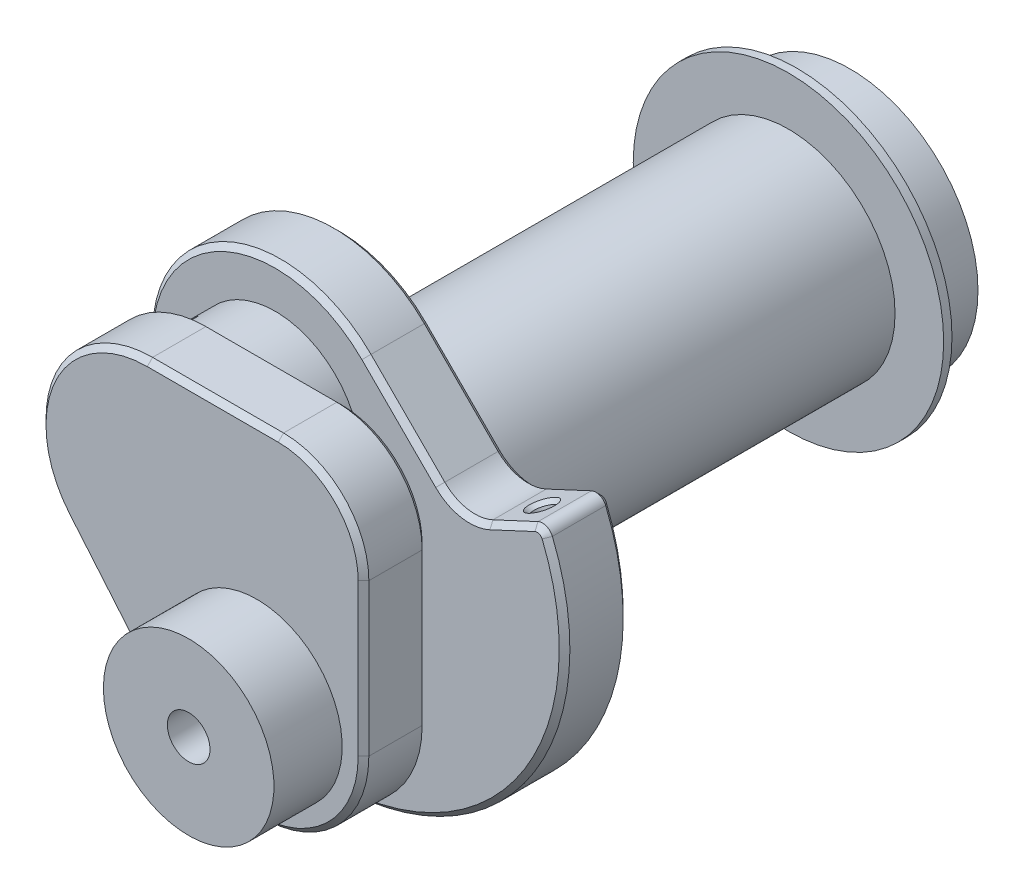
ISO-10303-21;
HEADER;
FILE_DESCRIPTION(('STEP AP214'),'2;1');
FILE_NAME('part.step','',(''),(''),'','','');
FILE_SCHEMA(('AUTOMOTIVE_DESIGN { 1 0 10303 214 1 1 1 1 }'));
ENDSEC;
DATA;
#1=APPLICATION_CONTEXT('core data for automotive mechanical design processes');
#2=APPLICATION_PROTOCOL_DEFINITION('international standard','automotive_design',2000,#1);
#3=PRODUCT_CONTEXT('',#1,'mechanical');
#4=PRODUCT('Part','Part','',(#3));
#5=PRODUCT_RELATED_PRODUCT_CATEGORY('part','',(#4));
#6=PRODUCT_DEFINITION_FORMATION('','',#4);
#7=PRODUCT_DEFINITION_CONTEXT('part definition',#1,'design');
#8=PRODUCT_DEFINITION('design','',#6,#7);
#9=PRODUCT_DEFINITION_SHAPE('','',#8);
#10=(LENGTH_UNIT() NAMED_UNIT(*) SI_UNIT(.MILLI.,.METRE.));
#11=(NAMED_UNIT(*) PLANE_ANGLE_UNIT() SI_UNIT($,.RADIAN.));
#12=(NAMED_UNIT(*) SI_UNIT($,.STERADIAN.) SOLID_ANGLE_UNIT());
#13=UNCERTAINTY_MEASURE_WITH_UNIT(LENGTH_MEASURE(1.E-05),#10,'distance_accuracy_value','');
#14=(GEOMETRIC_REPRESENTATION_CONTEXT(3) GLOBAL_UNCERTAINTY_ASSIGNED_CONTEXT((#13)) GLOBAL_UNIT_ASSIGNED_CONTEXT((#10,
#11,#12)) REPRESENTATION_CONTEXT('',''));
#15=CARTESIAN_POINT('',(0.,0.,0.));
#16=DIRECTION('',(0.,0.,1.));
#17=DIRECTION('',(1.,0.,0.));
#18=AXIS2_PLACEMENT_3D('',#15,#16,#17);
#19=CARTESIAN_POINT('',(13.7341428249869,-40.6661022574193,130.123705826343));
#20=DIRECTION('',(0.,0.,-0.999999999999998));
#21=DIRECTION('',(-1.,0.,0.));
#22=AXIS2_PLACEMENT_3D('',#19,#20,#21);
#23=CYLINDRICAL_SURFACE('',#22,25.3999996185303);
#24=CARTESIAN_POINT('',(13.7341428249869,-40.6661022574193,109.803706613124));
#25=DIRECTION('',(0.,0.,-0.999999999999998));
#26=DIRECTION('',(-1.,0.,0.));
#27=AXIS2_PLACEMENT_3D('',#24,#25,#26);
#28=CIRCLE('',#27,25.3999996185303);
#29=CARTESIAN_POINT('',(-11.6658567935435,-40.6661022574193,109.803706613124));
#30=VERTEX_POINT('',#29);
#31=EDGE_CURVE('E258',#30,#30,#28,.T.);
#32=ORIENTED_EDGE('',*,*,#31,.F.);
#33=EDGE_LOOP('',(#32));
#34=FACE_BOUND('',#33,.T.);
#35=CARTESIAN_POINT('',(13.7341428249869,-40.6661022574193,130.123705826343));
#36=DIRECTION('',(0.,0.,-0.999999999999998));
#37=DIRECTION('',(-1.,0.,0.));
#38=AXIS2_PLACEMENT_3D('',#35,#36,#37);
#39=CIRCLE('',#38,25.3999996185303);
#40=CARTESIAN_POINT('',(-11.6658567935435,-40.6661022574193,130.123705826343));
#41=VERTEX_POINT('',#40);
#42=EDGE_CURVE('E170',#41,#41,#39,.F.);
#43=ORIENTED_EDGE('',*,*,#42,.F.);
#44=EDGE_LOOP('',(#43));
#45=FACE_BOUND('',#44,.T.);
#46=CARTESIAN_POINT('',(29.0676514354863,-60.9156329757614,120.538616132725));
#47=CARTESIAN_POINT('',(29.0676554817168,-60.9156305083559,120.620872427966));
#48=CARTESIAN_POINT('',(29.0731688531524,-60.9114587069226,120.70319905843));
#49=CARTESIAN_POINT('',(29.0950483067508,-60.8948625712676,120.865704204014));
#50=CARTESIAN_POINT('',(29.1114392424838,-60.8824193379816,120.945877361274));
#51=CARTESIAN_POINT('',(29.1547042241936,-60.8494371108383,121.101651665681));
#52=CARTESIAN_POINT('',(29.1815816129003,-60.828895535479,121.177251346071));
#53=CARTESIAN_POINT('',(29.2452031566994,-60.7799927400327,121.3214233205));
#54=CARTESIAN_POINT('',(29.2819414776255,-60.7516361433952,121.389999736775));
#55=CARTESIAN_POINT('',(29.3631057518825,-60.6885409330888,121.515681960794));
#56=CARTESIAN_POINT('',(29.4072549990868,-60.6540299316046,121.573079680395));
#57=CARTESIAN_POINT('',(29.5028122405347,-60.5787296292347,121.676643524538));
#58=CARTESIAN_POINT('',(29.5542167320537,-60.5379433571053,121.72281503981));
#59=CARTESIAN_POINT('',(29.6582306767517,-60.4546715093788,121.798483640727));
#60=CARTESIAN_POINT('',(29.7104017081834,-60.4125942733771,121.829031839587));
#61=CARTESIAN_POINT('',(29.8178461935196,-60.3251776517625,121.877301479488));
#62=CARTESIAN_POINT('',(29.8731176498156,-60.2798403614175,121.895031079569));
#63=CARTESIAN_POINT('',(29.9802655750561,-60.1911609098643,121.915855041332));
#64=CARTESIAN_POINT('',(30.0320503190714,-60.1479585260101,121.920027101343));
#65=CARTESIAN_POINT('',(30.1350356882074,-60.0613392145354,121.916594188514));
#66=CARTESIAN_POINT('',(30.1862364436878,-60.0179223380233,121.908991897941));
#67=CARTESIAN_POINT('',(30.2849537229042,-59.9335548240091,121.88279296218));
#68=CARTESIAN_POINT('',(30.3325354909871,-59.8925695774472,121.864550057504));
#69=CARTESIAN_POINT('',(30.4245374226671,-59.8127578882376,121.81811713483));
#70=CARTESIAN_POINT('',(30.4689572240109,-59.7739316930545,121.789925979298));
#71=CARTESIAN_POINT('',(30.5550688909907,-59.6981759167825,121.723567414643));
#72=CARTESIAN_POINT('',(30.596622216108,-59.6613513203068,121.685101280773));
#73=CARTESIAN_POINT('',(30.6745372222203,-59.5918980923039,121.600014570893));
#74=CARTESIAN_POINT('',(30.7108978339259,-59.5592703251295,121.553392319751));
#75=CARTESIAN_POINT('',(30.7804062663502,-59.4965892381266,121.449600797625));
#76=CARTESIAN_POINT('',(30.8131042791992,-59.4669162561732,121.391900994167));
#77=CARTESIAN_POINT('',(30.8714099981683,-59.413785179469,121.270345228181));
#78=CARTESIAN_POINT('',(30.8970116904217,-59.3903323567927,121.206484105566));
#79=CARTESIAN_POINT('',(30.9425958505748,-59.3484512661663,121.068832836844));
#80=CARTESIAN_POINT('',(30.9619425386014,-59.3305952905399,120.994658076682));
#81=CARTESIAN_POINT('',(30.9916439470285,-59.3031366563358,120.843179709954));
#82=CARTESIAN_POINT('',(31.0020151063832,-59.2935189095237,120.765882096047));
#83=CARTESIAN_POINT('',(31.0115453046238,-59.2846778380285,120.638378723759));
#84=CARTESIAN_POINT('',(31.0134061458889,-59.2829501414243,120.588511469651));
#85=CARTESIAN_POINT('',(31.013401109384,-59.2829558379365,120.458234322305));
#86=CARTESIAN_POINT('',(31.0085633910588,-59.2874490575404,120.37777999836));
#87=CARTESIAN_POINT('',(30.9891401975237,-59.3054481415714,120.218933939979));
#88=CARTESIAN_POINT('',(30.9745343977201,-59.3189727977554,120.140546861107));
#89=CARTESIAN_POINT('',(30.9356349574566,-59.3548515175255,119.988179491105));
#90=CARTESIAN_POINT('',(30.9113286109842,-59.3772171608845,119.91420512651));
#91=CARTESIAN_POINT('',(30.8533706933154,-59.4302583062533,119.773252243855));
#92=CARTESIAN_POINT('',(30.8197254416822,-59.4609281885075,119.706269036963));
#93=CARTESIAN_POINT('',(30.7454396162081,-59.5281846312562,119.584479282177));
#94=CARTESIAN_POINT('',(30.7051778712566,-59.5644463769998,119.529262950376));
#95=CARTESIAN_POINT('',(30.6176346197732,-59.6426962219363,119.429458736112));
#96=CARTESIAN_POINT('',(30.5703553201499,-59.6846825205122,119.384867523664));
#97=CARTESIAN_POINT('',(30.4732598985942,-59.7701817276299,119.31054961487));
#98=CARTESIAN_POINT('',(30.4237934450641,-59.8134300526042,119.28006105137));
#99=CARTESIAN_POINT('',(30.3212156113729,-59.9023595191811,119.231158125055));
#100=CARTESIAN_POINT('',(30.2681054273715,-59.9480398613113,119.212739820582));
#101=CARTESIAN_POINT('',(30.1623930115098,-60.0381742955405,119.189270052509));
#102=CARTESIAN_POINT('',(30.1098836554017,-60.0825855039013,119.183632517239));
#103=CARTESIAN_POINT('',(30.0045433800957,-60.1709418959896,119.184192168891));
#104=CARTESIAN_POINT('',(29.9517125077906,-60.2148871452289,119.190387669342));
#105=CARTESIAN_POINT('',(29.8481921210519,-60.3003026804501,119.214172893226));
#106=CARTESIAN_POINT('',(29.7974814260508,-60.3418024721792,119.231565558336));
#107=CARTESIAN_POINT('',(29.6986925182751,-60.4220428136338,119.276941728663));
#108=CARTESIAN_POINT('',(29.6506144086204,-60.4607832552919,119.304925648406));
#109=CARTESIAN_POINT('',(29.5577131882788,-60.5351283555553,119.371027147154));
#110=CARTESIAN_POINT('',(29.5129485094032,-60.5706783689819,119.409288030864));
#111=CARTESIAN_POINT('',(29.4286308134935,-60.6372293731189,119.494497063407));
#112=CARTESIAN_POINT('',(29.3890781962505,-60.6682300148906,119.541445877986));
#113=CARTESIAN_POINT('',(29.3145826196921,-60.7263167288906,119.644736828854));
#114=CARTESIAN_POINT('',(29.2799008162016,-60.7531855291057,119.701389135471));
#115=CARTESIAN_POINT('',(29.2179461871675,-60.8009812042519,119.820939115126));
#116=CARTESIAN_POINT('',(29.1906784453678,-60.8219040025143,119.883841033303));
#117=CARTESIAN_POINT('',(29.1426958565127,-60.858611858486,120.018050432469));
#118=CARTESIAN_POINT('',(29.1224678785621,-60.8740168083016,120.089635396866));
#119=CARTESIAN_POINT('',(29.0912935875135,-60.8977183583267,120.235816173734));
#120=CARTESIAN_POINT('',(29.0803322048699,-60.9060264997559,120.310406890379));
#121=CARTESIAN_POINT('',(29.0697745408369,-60.9140255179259,120.436396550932));
#122=CARTESIAN_POINT('',(29.0676489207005,-60.9156345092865,120.487492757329));
#123=CARTESIAN_POINT('',(29.0676514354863,-60.9156329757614,120.538616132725));
#124=B_SPLINE_CURVE_WITH_KNOTS('',3,(#46,#47,#48,#49,#50,#51,#52,#53,#54,#55,#56,#57,#58,#59,
#60,#61,#62,#63,#64,#65,#66,#67,#68,#69,#70,#71,#72,#73,#74,#75,#76,#77,#78,#79,#80,#81,#82,#83,
#84,#85,#86,#87,#88,#89,#90,#91,#92,#93,#94,#95,#96,#97,#98,#99,#100,#101,#102,#103,#104,#105,
#106,#107,#108,#109,#110,#111,#112,#113,#114,#115,#116,#117,#118,#119,#120,#121,#122,#123),
.UNSPECIFIED.,.T.,.F.,(4,2,2,2,2,2,2,2,2,2,2,2,2,2,2,2,2,2,2,2,2,2,2,2,2,2,2,2,2,2,2,2,2,2,2,2,
2,2,4),(0.,0.246607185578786,0.493779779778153,0.741031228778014,0.988136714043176,
1.22750554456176,1.46675920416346,1.68654427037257,1.90618931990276,2.10788296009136,
2.30953066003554,2.50482865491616,2.70014898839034,2.90191991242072,3.10373232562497,
3.32078105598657,3.53801316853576,3.77312149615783,4.00779829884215,4.15738926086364,
4.39838339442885,4.63988053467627,4.88169503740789,5.1233463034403,5.35422205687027,
5.585025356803,5.80122843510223,6.01736087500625,6.22336264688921,6.42933506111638,
6.63177815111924,6.83422916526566,7.03966462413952,7.24511583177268,7.45913839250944,
7.6733073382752,7.90022889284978,8.126780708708,8.28005033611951),.UNSPECIFIED.);
#125=CARTESIAN_POINT('',(29.0676514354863,-60.9156329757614,120.538616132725));
#126=VERTEX_POINT('',#125);
#127=EDGE_CURVE('E251',#126,#126,#124,.T.);
#128=ORIENTED_EDGE('',*,*,#127,.T.);
#129=EDGE_LOOP('',(#128));
#130=FACE_BOUND('',#129,.T.);
#131=ADVANCED_FACE('F17',(#34,#45,#130),#23,.T.);
#132=CARTESIAN_POINT('',(5.91632688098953,-10.6198249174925,109.803706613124));
#133=DIRECTION('',(0.,0.,0.999999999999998));
#134=DIRECTION('',(1.,0.,0.));
#135=AXIS2_PLACEMENT_3D('',#132,#133,#134);
#136=PLANE('',#135);
#137=ORIENTED_EDGE('',*,*,#31,.T.);
#138=EDGE_LOOP('',(#137));
#139=FACE_BOUND('',#138,.T.);
#140=DIRECTION('',(0.999999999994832,3.21546977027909E-06,0.));
#141=VECTOR('',#140,1.);
#142=CARTESIAN_POINT('',(-18.9194607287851,28.4113340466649,109.803706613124));
#143=LINE('',#142,#141);
#144=CARTESIAN_POINT('',(-18.9194581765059,28.4113340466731,109.803706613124));
#145=VERTEX_POINT('',#144);
#146=CARTESIAN_POINT('',(20.0840149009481,28.4114594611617,109.803706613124));
#147=VERTEX_POINT('',#146);
#148=EDGE_CURVE('E157',#145,#147,#143,.T.);
#149=ORIENTED_EDGE('',*,*,#148,.F.);
#150=CARTESIAN_POINT('',(-18.9193586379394,-1.75106653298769,109.803706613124));
#151=DIRECTION('',(0.,0.,-0.999999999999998));
#152=DIRECTION('',(0.,1.,0.));
#153=AXIS2_PLACEMENT_3D('',#150,#151,#152);
#154=CIRCLE('',#153,30.1624005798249);
#155=CARTESIAN_POINT('',(-42.0251947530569,-21.1389685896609,109.803706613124));
#156=VERTEX_POINT('',#155);
#157=EDGE_CURVE('E147',#156,#145,#154,.T.);
#158=ORIENTED_EDGE('',*,*,#157,.F.);
#159=DIRECTION('',(-0.642783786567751,0.766047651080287,0.));
#160=VECTOR('',#159,1.);
#161=CARTESIAN_POINT('',(-9.3718311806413,-60.0541263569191,109.803706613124));
#162=LINE('',#161,#160);
#163=CARTESIAN_POINT('',(-9.3718311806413,-60.0541263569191,109.803706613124));
#164=VERTEX_POINT('',#163);
#165=EDGE_CURVE('E154',#164,#156,#162,.T.);
#166=ORIENTED_EDGE('',*,*,#165,.F.);
#167=CARTESIAN_POINT('',(13.7341056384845,-40.6661398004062,109.803706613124));
#168=DIRECTION('',(0.,0.,-0.999999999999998));
#169=DIRECTION('',(-1.,0.,0.));
#170=AXIS2_PLACEMENT_3D('',#167,#168,#169);
#171=CIRCLE('',#170,30.1625320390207);
#172=CARTESIAN_POINT('',(43.8966376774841,-40.6661754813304,109.803706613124));
#173=VERTEX_POINT('',#172);
#174=EDGE_CURVE('E245',#173,#164,#171,.T.);
#175=ORIENTED_EDGE('',*,*,#174,.F.);
#176=DIRECTION('',(-1.18295519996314E-06,-0.999999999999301,0.));
#177=VECTOR('',#176,1.);
#178=CARTESIAN_POINT('',(43.8966912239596,4.59883153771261,109.803706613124));
#179=LINE('',#178,#177);
#180=CARTESIAN_POINT('',(43.8966912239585,4.59883059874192,109.803706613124));
#181=VERTEX_POINT('',#180);
#182=EDGE_CURVE('E183',#181,#173,#179,.T.);
#183=ORIENTED_EDGE('',*,*,#182,.F.);
#184=CARTESIAN_POINT('',(20.0840914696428,4.59885970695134,109.803706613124));
#185=DIRECTION('',(0.,0.,-0.999999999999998));
#186=DIRECTION('',(-1.,0.,0.));
#187=AXIS2_PLACEMENT_3D('',#184,#185,#186);
#188=CIRCLE('',#187,23.8125997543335);
#189=EDGE_CURVE('E235',#147,#181,#188,.T.);
#190=ORIENTED_EDGE('',*,*,#189,.F.);
#191=EDGE_LOOP('',(#149,#158,#166,#175,#183,#190));
#192=FACE_BOUND('',#191,.T.);
#193=ADVANCED_FACE('F153',(#139,#192),#136,.T.);
#194=CARTESIAN_POINT('',(30.4393024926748,-60.5745335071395,120.786190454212));
#195=DIRECTION('',(-0.597005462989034,0.711482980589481,-0.370643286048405));
#196=DIRECTION('',(-0.76604425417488,-0.642787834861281,0.));
#197=AXIS2_PLACEMENT_3D('',#194,#195,#196);
#198=CYLINDRICAL_SURFACE('',#197,1.27);
#199=ORIENTED_EDGE('',*,*,#127,.F.);
#200=EDGE_LOOP('',(#199));
#201=FACE_BOUND('',#200,.T.);
#202=CARTESIAN_POINT('',(16.760496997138,-46.2485462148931,112.897872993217));
#203=CARTESIAN_POINT('',(16.7605003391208,-46.2485461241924,112.981944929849));
#204=CARTESIAN_POINT('',(16.7669845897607,-46.2450436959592,113.066117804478));
#205=CARTESIAN_POINT('',(16.7922317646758,-46.2312428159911,113.232155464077));
#206=CARTESIAN_POINT('',(16.8110249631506,-46.2209276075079,113.314014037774));
#207=CARTESIAN_POINT('',(16.8599229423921,-46.1935592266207,113.472939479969));
#208=CARTESIAN_POINT('',(16.8900070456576,-46.1765183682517,113.550014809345));
#209=CARTESIAN_POINT('',(16.9604495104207,-46.1355720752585,113.697338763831));
#210=CARTESIAN_POINT('',(17.0008050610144,-46.1116685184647,113.767589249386));
#211=CARTESIAN_POINT('',(17.0908688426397,-46.0566205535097,113.899292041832));
#212=CARTESIAN_POINT('',(17.1406244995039,-46.0254392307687,113.96069682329));
#213=CARTESIAN_POINT('',(17.2478536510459,-45.9557528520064,114.07149436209));
#214=CARTESIAN_POINT('',(17.3053215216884,-45.9172531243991,114.120895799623));
#215=CARTESIAN_POINT('',(17.4195856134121,-45.8375952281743,114.200304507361));
#216=CARTESIAN_POINT('',(17.4758290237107,-45.7971309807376,114.231795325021));
#217=CARTESIAN_POINT('',(17.5906963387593,-45.7113574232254,114.280610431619));
#218=CARTESIAN_POINT('',(17.6493167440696,-45.6660550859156,114.297954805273));
#219=CARTESIAN_POINT('',(17.7579263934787,-45.5789223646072,114.315772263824));
#220=CARTESIAN_POINT('',(17.8079388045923,-45.5375362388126,114.318321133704));
#221=CARTESIAN_POINT('',(17.9062327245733,-45.4536209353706,114.311951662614));
#222=CARTESIAN_POINT('',(17.9545146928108,-45.4110920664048,114.303036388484));
#223=CARTESIAN_POINT('',(18.045355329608,-45.3286668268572,114.275089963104));
#224=CARTESIAN_POINT('',(18.0880827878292,-45.2887546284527,114.256643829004));
#225=CARTESIAN_POINT('',(18.1698992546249,-45.2103052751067,114.21092282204));
#226=CARTESIAN_POINT('',(18.2089875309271,-45.1717683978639,114.183646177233));
#227=CARTESIAN_POINT('',(18.2855287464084,-45.0944819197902,114.119249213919));
#228=CARTESIAN_POINT('',(18.3226878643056,-45.0558974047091,114.081584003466));
#229=CARTESIAN_POINT('',(18.3919553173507,-44.9823321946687,113.998847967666));
#230=CARTESIAN_POINT('',(18.424061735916,-44.9473528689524,113.953774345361));
#231=CARTESIAN_POINT('',(18.4870621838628,-44.8773684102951,113.851106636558));
#232=CARTESIAN_POINT('',(18.5172262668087,-44.8429793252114,113.7926445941));
#233=CARTESIAN_POINT('',(18.5709594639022,-44.7806377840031,113.669528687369));
#234=CARTESIAN_POINT('',(18.5945213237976,-44.7526924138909,113.60486811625));
#235=CARTESIAN_POINT('',(18.6374150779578,-44.7011584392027,113.463007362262));
#236=CARTESIAN_POINT('',(18.6559207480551,-44.6784719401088,113.385227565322));
#237=CARTESIAN_POINT('',(18.6845152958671,-44.6431409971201,113.226073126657));
#238=CARTESIAN_POINT('',(18.6946221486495,-44.6304751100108,113.144706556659));
#239=CARTESIAN_POINT('',(18.7042942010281,-44.6183320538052,113.007924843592));
#240=CARTESIAN_POINT('',(18.7062521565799,-44.6158636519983,112.952913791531));
#241=CARTESIAN_POINT('',(18.706249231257,-44.6158715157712,112.82123419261));
#242=CARTESIAN_POINT('',(18.7024492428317,-44.6206679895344,112.744537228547));
#243=CARTESIAN_POINT('',(18.686934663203,-44.6400805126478,112.593079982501));
#244=CARTESIAN_POINT('',(18.675207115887,-44.6547126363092,112.518323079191));
#245=CARTESIAN_POINT('',(18.6435623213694,-44.6935987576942,112.372955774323));
#246=CARTESIAN_POINT('',(18.6236274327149,-44.7178734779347,112.302354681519));
#247=CARTESIAN_POINT('',(18.5755372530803,-44.7752129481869,112.167864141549));
#248=CARTESIAN_POINT('',(18.5473868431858,-44.8082724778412,112.103970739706));
#249=CARTESIAN_POINT('',(18.4847405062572,-44.8799441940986,111.98805424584));
#250=CARTESIAN_POINT('',(18.450634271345,-44.9181941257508,111.935596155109));
#251=CARTESIAN_POINT('',(18.3757445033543,-44.999818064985,111.840309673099));
#252=CARTESIAN_POINT('',(18.3349615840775,-45.0431916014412,111.797480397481));
#253=CARTESIAN_POINT('',(18.2489092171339,-45.1318694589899,111.723921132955));
#254=CARTESIAN_POINT('',(18.2038218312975,-45.1770697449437,111.69285215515));
#255=CARTESIAN_POINT('',(18.1091284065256,-45.2689653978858,111.641787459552));
#256=CARTESIAN_POINT('',(18.059522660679,-45.315660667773,111.621791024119));
#257=CARTESIAN_POINT('',(17.9573713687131,-45.4086306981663,111.593487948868));
#258=CARTESIAN_POINT('',(17.9048486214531,-45.4549061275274,111.585101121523));
#259=CARTESIAN_POINT('',(17.7979551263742,-45.5459442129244,111.579965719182));
#260=CARTESIAN_POINT('',(17.7435843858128,-45.5907068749,111.583217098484));
#261=CARTESIAN_POINT('',(17.6345883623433,-45.6774770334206,111.601275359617));
#262=CARTESIAN_POINT('',(17.5799631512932,-45.7194852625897,111.616079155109));
#263=CARTESIAN_POINT('',(17.4721486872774,-45.7997492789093,111.656864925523));
#264=CARTESIAN_POINT('',(17.4189594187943,-45.8380051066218,111.682846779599));
#265=CARTESIAN_POINT('',(17.3157796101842,-45.9099881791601,111.745310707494));
#266=CARTESIAN_POINT('',(17.2657890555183,-45.9437154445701,111.781792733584));
#267=CARTESIAN_POINT('',(17.1707378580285,-46.0060977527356,111.864258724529));
#268=CARTESIAN_POINT('',(17.1256767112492,-46.0347533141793,111.910241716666));
#269=CARTESIAN_POINT('',(17.0419133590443,-46.0867663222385,112.010570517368));
#270=CARTESIAN_POINT('',(17.0032319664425,-46.1101065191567,112.064942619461));
#271=CARTESIAN_POINT('',(16.9336879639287,-46.1512686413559,112.180384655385));
#272=CARTESIAN_POINT('',(16.9028283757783,-46.1690884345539,112.241457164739));
#273=CARTESIAN_POINT('',(16.8493053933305,-46.1995672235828,112.369838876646));
#274=CARTESIAN_POINT('',(16.8268247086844,-46.2121118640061,112.437250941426));
#275=CARTESIAN_POINT('',(16.7914956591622,-46.2316665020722,112.575239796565));
#276=CARTESIAN_POINT('',(16.7786348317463,-46.2386836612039,112.645812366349));
#277=CARTESIAN_POINT('',(16.7672208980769,-46.2448967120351,112.747004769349));
#278=CARTESIAN_POINT('',(16.7646949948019,-46.2462687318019,112.777105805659));
#279=CARTESIAN_POINT('',(16.7613325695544,-46.2480934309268,112.837424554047));
#280=CARTESIAN_POINT('',(16.7604957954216,-46.2485462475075,112.867642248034));
#281=CARTESIAN_POINT('',(16.760496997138,-46.2485462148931,112.897872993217));
#282=B_SPLINE_CURVE_WITH_KNOTS('',3,(#202,#203,#204,#205,#206,#207,#208,#209,#210,#211,#212,
#213,#214,#215,#216,#217,#218,#219,#220,#221,#222,#223,#224,#225,#226,#227,#228,#229,#230,#231,
#232,#233,#234,#235,#236,#237,#238,#239,#240,#241,#242,#243,#244,#245,#246,#247,#248,#249,#250,
#251,#252,#253,#254,#255,#256,#257,#258,#259,#260,#261,#262,#263,#264,#265,#266,#267,#268,#269,
#270,#271,#272,#273,#274,#275,#276,#277,#278,#279,#280,#281),.UNSPECIFIED.,.T.,.F.,(4,2,2,2,2,2,
2,2,2,2,2,2,2,2,2,2,2,2,2,2,2,2,2,2,2,2,2,2,2,2,2,2,2,2,2,2,2,2,2,4),(0.,0.252100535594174,
0.504823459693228,0.757085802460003,1.00927918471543,1.26278067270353,1.51609829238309,
1.74304642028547,1.96967177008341,2.16354901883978,2.35737441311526,2.54051015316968,
2.72368266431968,2.91936021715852,3.11511181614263,3.33691379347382,3.55895853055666,
3.80718215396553,4.05487315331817,4.21987952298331,4.4496305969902,4.67975806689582,
4.91038279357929,5.14087077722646,5.35978306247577,5.57867523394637,5.7906639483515,
6.00263892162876,6.2131423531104,6.42364495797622,6.63409134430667,6.84453545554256,
7.05497861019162,7.26540023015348,7.47649528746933,7.68767177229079,7.90321571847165,
8.11847994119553,8.2091442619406,8.29979504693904),.UNSPECIFIED.);
#283=CARTESIAN_POINT('',(16.760496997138,-46.2485462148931,112.897872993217));
#284=VERTEX_POINT('',#283);
#285=EDGE_CURVE('E865',#284,#284,#282,.T.);
#286=ORIENTED_EDGE('',*,*,#285,.T.);
#287=EDGE_LOOP('',(#286));
#288=FACE_BOUND('',#287,.T.);
#289=ADVANCED_FACE('F260',(#201,#288),#198,.F.);
#290=CARTESIAN_POINT('',(13.7341428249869,-40.6661022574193,130.123705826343));
#291=DIRECTION('',(0.,0.,0.999999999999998));
#292=DIRECTION('',(1.,0.,0.));
#293=AXIS2_PLACEMENT_3D('',#290,#291,#292);
#294=PLANE('',#293);
#295=CARTESIAN_POINT('',(13.7341428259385,-40.6661022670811,130.123705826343));
#296=DIRECTION('',(0.,0.,-0.999999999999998));
#297=DIRECTION('',(-1.,0.,0.));
#298=AXIS2_PLACEMENT_3D('',#295,#296,#297);
#299=CIRCLE('',#298,6.35);
#300=CARTESIAN_POINT('',(7.38414282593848,-40.6661022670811,130.123705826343));
#301=VERTEX_POINT('',#300);
#302=EDGE_CURVE('E857',#301,#301,#299,.T.);
#303=ORIENTED_EDGE('',*,*,#302,.T.);
#304=EDGE_LOOP('',(#303));
#305=FACE_BOUND('',#304,.T.);
#306=ORIENTED_EDGE('',*,*,#42,.T.);
#307=EDGE_LOOP('',(#306));
#308=FACE_BOUND('',#307,.T.);
#309=ADVANCED_FACE('F273',(#305,#308),#294,.T.);
#310=CARTESIAN_POINT('',(-26.3065632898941,-41.1067571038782,109.009956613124));
#311=DIRECTION('',(-0.541677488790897,-0.454516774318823,0.707106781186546));
#312=DIRECTION('',(0.793843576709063,0.,0.608122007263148));
#313=AXIS2_PLACEMENT_3D('',#310,#311,#312);
#314=PLANE('',#313);
#315=ORIENTED_EDGE('',*,*,#165,.T.);
#316=DIRECTION('',(0.541677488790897,0.454516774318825,0.707106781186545));
#317=VECTOR('',#316,1.);
#318=CARTESIAN_POINT('',(-42.6332450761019,-21.649178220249,109.009956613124));
#319=LINE('',#318,#317);
#320=CARTESIAN_POINT('',(-43.2412953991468,-22.1593878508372,108.216206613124));
#321=VERTEX_POINT('',#320);
#322=EDGE_CURVE('E160',#321,#156,#319,.T.);
#323=ORIENTED_EDGE('',*,*,#322,.F.);
#324=DIRECTION('',(0.642783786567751,-0.766047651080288,0.));
#325=VECTOR('',#324,1.);
#326=CARTESIAN_POINT('',(-10.5879318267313,-61.0745456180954,108.216206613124));
#327=LINE('',#326,#325);
#328=CARTESIAN_POINT('',(-10.5879318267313,-61.0745456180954,108.216206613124));
#329=VERTEX_POINT('',#328);
#330=EDGE_CURVE('E843',#329,#321,#327,.F.);
#331=ORIENTED_EDGE('',*,*,#330,.F.);
#332=DIRECTION('',(0.541677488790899,0.454516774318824,0.707106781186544));
#333=VECTOR('',#332,1.);
#334=CARTESIAN_POINT('',(-9.97988150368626,-60.5643359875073,109.009956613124));
#335=LINE('',#334,#333);
#336=EDGE_CURVE('E168',#164,#329,#335,.F.);
#337=ORIENTED_EDGE('',*,*,#336,.F.);
#338=EDGE_LOOP('',(#315,#323,#331,#337));
#339=FACE_BOUND('',#338,.T.);
#340=ADVANCED_FACE('F164',(#339),#314,.T.);
#341=CARTESIAN_POINT('',(-18.9193586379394,-1.75106653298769,108.216206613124));
#342=DIRECTION('',(0.,0.,-0.999999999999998));
#343=DIRECTION('',(0.,1.,0.));
#344=AXIS2_PLACEMENT_3D('',#341,#342,#343);
#345=CONICAL_SURFACE('',#344,31.7499005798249,0.785398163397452);
#346=DIRECTION('',(0.,-0.707106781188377,0.707106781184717));
#347=VECTOR('',#346,1.);
#348=CARTESIAN_POINT('',(-18.9194607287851,29.2051154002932,109.0099252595));
#349=LINE('',#348,#347);
#350=CARTESIAN_POINT('',(-18.9194607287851,29.9988340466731,108.216206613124));
#351=VERTEX_POINT('',#350);
#352=EDGE_CURVE('E159',#351,#145,#349,.T.);
#353=ORIENTED_EDGE('',*,*,#352,.F.);
#354=CARTESIAN_POINT('',(-18.9193586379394,-1.75106653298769,108.216206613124));
#355=DIRECTION('',(0.,0.,0.999999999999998));
#356=DIRECTION('',(-3.21546977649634E-06,0.999999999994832,0.));
#357=AXIS2_PLACEMENT_3D('',#354,#355,#356);
#358=CIRCLE('',#357,31.7499005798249);
#359=EDGE_CURVE('E175',#321,#351,#358,.F.);
#360=ORIENTED_EDGE('',*,*,#359,.F.);
#361=ORIENTED_EDGE('',*,*,#322,.T.);
#362=ORIENTED_EDGE('',*,*,#157,.T.);
#363=EDGE_LOOP('',(#353,#360,#361,#362));
#364=FACE_BOUND('',#363,.T.);
#365=ADVANCED_FACE('F173',(#364),#345,.T.);
#366=CARTESIAN_POINT('',(0.582277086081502,29.2051467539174,109.009956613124));
#367=DIRECTION('',(-2.27368047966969E-06,0.707106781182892,0.707106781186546));
#368=DIRECTION('',(0.,-0.707106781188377,0.707106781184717));
#369=AXIS2_PLACEMENT_3D('',#366,#367,#368);
#370=PLANE('',#369);
#371=ORIENTED_EDGE('',*,*,#148,.T.);
#372=CARTESIAN_POINT('',(20.0840097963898,29.9989594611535,108.216206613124));
#373=DIRECTION('',(2.27368048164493E-06,-0.707106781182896,0.707106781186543));
#374=VECTOR('',#373,1.);
#375=LINE('',#372,#374);
#376=CARTESIAN_POINT('',(20.0840108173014,29.9989594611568,108.216206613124));
#377=VERTEX_POINT('',#376);
#378=EDGE_CURVE('E194',#377,#147,#375,.T.);
#379=ORIENTED_EDGE('',*,*,#378,.F.);
#380=DIRECTION('',(-0.999999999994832,-3.21546977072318E-06,0.));
#381=VECTOR('',#380,1.);
#382=CARTESIAN_POINT('',(-18.9194607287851,29.9988340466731,108.216206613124));
#383=LINE('',#382,#381);
#384=EDGE_CURVE('E763',#351,#377,#383,.F.);
#385=ORIENTED_EDGE('',*,*,#384,.F.);
#386=ORIENTED_EDGE('',*,*,#352,.T.);
#387=EDGE_LOOP('',(#371,#379,#385,#386));
#388=FACE_BOUND('',#387,.T.);
#389=ADVANCED_FACE('F200',(#388),#370,.T.);
#390=CARTESIAN_POINT('',(20.0840914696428,4.59885970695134,108.216206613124));
#391=DIRECTION('',(0.,0.,-0.999999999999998));
#392=DIRECTION('',(-1.,0.,0.));
#393=AXIS2_PLACEMENT_3D('',#390,#391,#392);
#394=CONICAL_SURFACE('',#393,25.4000997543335,0.785398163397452);
#395=DIRECTION('',(0.707106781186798,0.,-0.707106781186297));
#396=VECTOR('',#395,1.);
#397=CARTESIAN_POINT('',(44.6904278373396,4.59882965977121,109.009969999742));
#398=LINE('',#397,#396);
#399=CARTESIAN_POINT('',(45.4841912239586,4.59882965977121,108.216206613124));
#400=VERTEX_POINT('',#399);
#401=EDGE_CURVE('E187',#400,#181,#398,.F.);
#402=ORIENTED_EDGE('',*,*,#401,.F.);
#403=CARTESIAN_POINT('',(20.0840914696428,4.59885970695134,108.216206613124));
#404=DIRECTION('',(0.,0.,0.999999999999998));
#405=DIRECTION('',(0.999999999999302,-1.18295520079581E-06,0.));
#406=AXIS2_PLACEMENT_3D('',#403,#404,#405);
#407=CIRCLE('',#406,25.4000997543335);
#408=EDGE_CURVE('E757',#377,#400,#407,.F.);
#409=ORIENTED_EDGE('',*,*,#408,.F.);
#410=ORIENTED_EDGE('',*,*,#378,.T.);
#411=ORIENTED_EDGE('',*,*,#189,.T.);
#412=EDGE_LOOP('',(#402,#409,#410,#411));
#413=FACE_BOUND('',#412,.T.);
#414=ADVANCED_FACE('F210',(#413),#394,.T.);
#415=CARTESIAN_POINT('',(44.6904144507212,-18.0336729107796,109.009956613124));
#416=DIRECTION('',(0.707106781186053,-8.36475644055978E-07,0.707106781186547));
#417=DIRECTION('',(0.707106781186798,0.,-0.707106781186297));
#418=AXIS2_PLACEMENT_3D('',#415,#416,#417);
#419=PLANE('',#418);
#420=ORIENTED_EDGE('',*,*,#182,.T.);
#421=DIRECTION('',(-0.707106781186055,8.36475645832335E-07,0.707106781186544));
#422=VECTOR('',#421,1.);
#423=CARTESIAN_POINT('',(44.6903876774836,-40.6661764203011,109.009956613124));
#424=LINE('',#423,#422);
#425=CARTESIAN_POINT('',(45.484137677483,-40.6661773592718,108.216206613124));
#426=VERTEX_POINT('',#425);
#427=EDGE_CURVE('E186',#426,#173,#424,.T.);
#428=ORIENTED_EDGE('',*,*,#427,.F.);
#429=DIRECTION('',(1.18295520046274E-06,0.999999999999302,0.));
#430=VECTOR('',#429,1.);
#431=CARTESIAN_POINT('',(45.4841912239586,4.59882965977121,108.216206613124));
#432=LINE('',#431,#430);
#433=EDGE_CURVE('E742',#400,#426,#432,.F.);
#434=ORIENTED_EDGE('',*,*,#433,.F.);
#435=ORIENTED_EDGE('',*,*,#401,.T.);
#436=EDGE_LOOP('',(#420,#428,#434,#435));
#437=FACE_BOUND('',#436,.T.);
#438=ADVANCED_FACE('F215',(#437),#419,.T.);
#439=CARTESIAN_POINT('',(13.7341056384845,-40.6661398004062,108.216206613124));
#440=DIRECTION('',(0.,0.,-0.999999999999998));
#441=DIRECTION('',(-1.,0.,0.));
#442=AXIS2_PLACEMENT_3D('',#439,#440,#441);
#443=CONICAL_SURFACE('',#442,31.7500320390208,0.785398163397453);
#444=ORIENTED_EDGE('',*,*,#336,.T.);
#445=CARTESIAN_POINT('',(13.7341056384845,-40.6661398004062,108.216206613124));
#446=DIRECTION('',(0.,0.,0.999999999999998));
#447=DIRECTION('',(-0.642783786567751,0.766047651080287,0.));
#448=AXIS2_PLACEMENT_3D('',#445,#446,#447);
#449=CIRCLE('',#448,31.7500320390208);
#450=EDGE_CURVE('E741',#426,#329,#449,.F.);
#451=ORIENTED_EDGE('',*,*,#450,.F.);
#452=ORIENTED_EDGE('',*,*,#427,.T.);
#453=ORIENTED_EDGE('',*,*,#174,.T.);
#454=EDGE_LOOP('',(#444,#451,#452,#453));
#455=FACE_BOUND('',#454,.T.);
#456=ADVANCED_FACE('F1528',(#455),#443,.T.);
#457=CARTESIAN_POINT('',(13.7341428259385,-40.6661022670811,130.123705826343));
#458=DIRECTION('',(0.,0.,-0.999999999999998));
#459=DIRECTION('',(-1.,0.,0.));
#460=AXIS2_PLACEMENT_3D('',#457,#458,#459);
#461=CYLINDRICAL_SURFACE('',#460,6.35);
#462=CARTESIAN_POINT('',(13.7341428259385,-40.6661022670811,111.073705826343));
#463=DIRECTION('',(0.,0.,-0.999999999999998));
#464=DIRECTION('',(-1.,0.,0.));
#465=AXIS2_PLACEMENT_3D('',#462,#463,#464);
#466=CIRCLE('',#465,6.35);
#467=CARTESIAN_POINT('',(7.38414282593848,-40.6661022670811,111.073705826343));
#468=VERTEX_POINT('',#467);
#469=EDGE_CURVE('E848',#468,#468,#466,.T.);
#470=ORIENTED_EDGE('',*,*,#469,.T.);
#471=EDGE_LOOP('',(#470));
#472=FACE_BOUND('',#471,.T.);
#473=ORIENTED_EDGE('',*,*,#302,.F.);
#474=EDGE_LOOP('',(#473));
#475=FACE_BOUND('',#474,.T.);
#476=ORIENTED_EDGE('',*,*,#285,.F.);
#477=EDGE_LOOP('',(#476));
#478=FACE_BOUND('',#477,.T.);
#479=ADVANCED_FACE('F1520',(#472,#475,#478),#461,.F.);
#480=CARTESIAN_POINT('',(-10.5879318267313,-61.0745456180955,90.7537068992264));
#481=DIRECTION('',(-0.766047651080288,-0.642783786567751,0.));
#482=DIRECTION('',(0.642783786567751,-0.766047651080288,0.));
#483=AXIS2_PLACEMENT_3D('',#480,#481,#482);
#484=PLANE('',#483);
#485=ORIENTED_EDGE('',*,*,#330,.T.);
#486=DIRECTION('',(0.,0.,0.999999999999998));
#487=VECTOR('',#486,1.);
#488=CARTESIAN_POINT('',(-43.2412953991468,-22.1593878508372,90.7537068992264));
#489=LINE('',#488,#487);
#490=CARTESIAN_POINT('',(-43.2412953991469,-22.1593878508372,92.3412068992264));
#491=VERTEX_POINT('',#490);
#492=EDGE_CURVE('E832',#491,#321,#489,.T.);
#493=ORIENTED_EDGE('',*,*,#492,.F.);
#494=DIRECTION('',(-0.642783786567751,0.766047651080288,0.));
#495=VECTOR('',#494,1.);
#496=CARTESIAN_POINT('',(-10.5879318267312,-61.0745456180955,92.3412068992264));
#497=LINE('',#496,#495);
#498=CARTESIAN_POINT('',(-10.5879318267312,-61.0745456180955,92.3412068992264));
#499=VERTEX_POINT('',#498);
#500=EDGE_CURVE('E730',#499,#491,#497,.T.);
#501=ORIENTED_EDGE('',*,*,#500,.F.);
#502=DIRECTION('',(0.,0.,0.999999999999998));
#503=VECTOR('',#502,1.);
#504=CARTESIAN_POINT('',(-10.5879318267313,-61.0745456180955,90.7537068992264));
#505=LINE('',#504,#503);
#506=EDGE_CURVE('E851',#329,#499,#505,.F.);
#507=ORIENTED_EDGE('',*,*,#506,.F.);
#508=EDGE_LOOP('',(#485,#493,#501,#507));
#509=FACE_BOUND('',#508,.T.);
#510=ADVANCED_FACE('F1513',(#509),#484,.T.);
#511=CARTESIAN_POINT('',(-18.9193586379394,-1.75106653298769,92.3412068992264));
#512=DIRECTION('',(0.,0.,0.999999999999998));
#513=DIRECTION('',(1.,0.,0.));
#514=AXIS2_PLACEMENT_3D('',#511,#512,#513);
#515=CYLINDRICAL_SURFACE('',#514,31.7499005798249);
#516=DIRECTION('',(0.,0.,0.999999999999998));
#517=VECTOR('',#516,1.);
#518=CARTESIAN_POINT('',(-18.9194607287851,29.9988340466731,90.7537068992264));
#519=LINE('',#518,#517);
#520=CARTESIAN_POINT('',(-18.919458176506,29.9988340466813,92.3412068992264));
#521=VERTEX_POINT('',#520);
#522=EDGE_CURVE('E829',#521,#351,#519,.T.);
#523=ORIENTED_EDGE('',*,*,#522,.F.);
#524=CARTESIAN_POINT('',(-18.9193586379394,-1.75106653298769,92.3412068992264));
#525=DIRECTION('',(0.,0.,0.999999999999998));
#526=DIRECTION('',(-0.906307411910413,0.422619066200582,0.));
#527=AXIS2_PLACEMENT_3D('',#524,#525,#526);
#528=CIRCLE('',#527,31.7499005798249);
#529=EDGE_CURVE('E724',#491,#521,#528,.F.);
#530=ORIENTED_EDGE('',*,*,#529,.F.);
#531=ORIENTED_EDGE('',*,*,#492,.T.);
#532=ORIENTED_EDGE('',*,*,#359,.T.);
#533=EDGE_LOOP('',(#523,#530,#531,#532));
#534=FACE_BOUND('',#533,.T.);
#535=ADVANCED_FACE('F827',(#534),#515,.T.);
#536=CARTESIAN_POINT('',(-18.9194607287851,29.9988340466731,90.7537068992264));
#537=DIRECTION('',(-3.21546977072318E-06,0.999999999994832,0.));
#538=DIRECTION('',(-0.999999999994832,-3.21546977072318E-06,0.));
#539=AXIS2_PLACEMENT_3D('',#536,#537,#538);
#540=PLANE('',#539);
#541=ORIENTED_EDGE('',*,*,#384,.T.);
#542=DIRECTION('',(0.,0.,0.999999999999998));
#543=VECTOR('',#542,1.);
#544=CARTESIAN_POINT('',(20.0840097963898,29.9989594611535,90.7537068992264));
#545=LINE('',#544,#543);
#546=CARTESIAN_POINT('',(20.0840097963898,29.9989594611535,92.3412068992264));
#547=VERTEX_POINT('',#546);
#548=EDGE_CURVE('E760',#547,#377,#545,.T.);
#549=ORIENTED_EDGE('',*,*,#548,.F.);
#550=DIRECTION('',(0.999999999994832,3.21546977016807E-06,0.));
#551=VECTOR('',#550,1.);
#552=CARTESIAN_POINT('',(-18.9194556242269,29.9988340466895,92.3412068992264));
#553=LINE('',#552,#551);
#554=EDGE_CURVE('E720',#521,#547,#553,.T.);
#555=ORIENTED_EDGE('',*,*,#554,.F.);
#556=ORIENTED_EDGE('',*,*,#522,.T.);
#557=EDGE_LOOP('',(#541,#549,#555,#556));
#558=FACE_BOUND('',#557,.T.);
#559=ADVANCED_FACE('F835',(#558),#540,.T.);
#560=CARTESIAN_POINT('',(20.0840914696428,4.59885970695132,92.3412068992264));
#561=DIRECTION('',(0.,0.,0.999999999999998));
#562=DIRECTION('',(1.,0.,0.));
#563=AXIS2_PLACEMENT_3D('',#560,#561,#562);
#564=CYLINDRICAL_SURFACE('',#563,25.4000997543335);
#565=DIRECTION('',(0.,0.,0.999999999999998));
#566=VECTOR('',#565,1.);
#567=CARTESIAN_POINT('',(45.4841912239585,4.59882965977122,90.7537068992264));
#568=LINE('',#567,#566);
#569=CARTESIAN_POINT('',(45.4841912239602,4.59883106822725,92.3412068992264));
#570=VERTEX_POINT('',#569);
#571=EDGE_CURVE('E754',#570,#400,#568,.T.);
#572=ORIENTED_EDGE('',*,*,#571,.F.);
#573=CARTESIAN_POINT('',(20.0840914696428,4.59885970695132,92.3412068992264));
#574=DIRECTION('',(0.,0.,0.999999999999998));
#575=DIRECTION('',(0.707106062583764,0.707107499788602,0.));
#576=AXIS2_PLACEMENT_3D('',#573,#574,#575);
#577=CIRCLE('',#576,25.4000997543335);
#578=EDGE_CURVE('E735',#547,#570,#577,.F.);
#579=ORIENTED_EDGE('',*,*,#578,.F.);
#580=ORIENTED_EDGE('',*,*,#548,.T.);
#581=ORIENTED_EDGE('',*,*,#408,.T.);
#582=EDGE_LOOP('',(#572,#579,#580,#581));
#583=FACE_BOUND('',#582,.T.);
#584=ADVANCED_FACE('F886',(#583),#564,.T.);
#585=CARTESIAN_POINT('',(45.4841912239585,4.59882965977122,90.7537068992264));
#586=DIRECTION('',(0.999999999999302,-1.18295520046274E-06,0.));
#587=DIRECTION('',(1.18295520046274E-06,0.999999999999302,0.));
#588=AXIS2_PLACEMENT_3D('',#585,#586,#587);
#589=PLANE('',#588);
#590=ORIENTED_EDGE('',*,*,#433,.T.);
#591=DIRECTION('',(0.,0.,0.999999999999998));
#592=VECTOR('',#591,1.);
#593=CARTESIAN_POINT('',(45.484137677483,-40.6661773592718,90.7537068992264));
#594=LINE('',#593,#592);
#595=CARTESIAN_POINT('',(45.484137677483,-40.6661773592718,92.3412068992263));
#596=VERTEX_POINT('',#595);
#597=EDGE_CURVE('E738',#596,#426,#594,.T.);
#598=ORIENTED_EDGE('',*,*,#597,.F.);
#599=DIRECTION('',(-1.18295520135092E-06,-0.999999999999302,0.));
#600=VECTOR('',#599,1.);
#601=CARTESIAN_POINT('',(45.4841912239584,4.59882965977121,92.3412068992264));
#602=LINE('',#601,#600);
#603=EDGE_CURVE('E713',#570,#596,#602,.T.);
#604=ORIENTED_EDGE('',*,*,#603,.F.);
#605=ORIENTED_EDGE('',*,*,#571,.T.);
#606=EDGE_LOOP('',(#590,#598,#604,#605));
#607=FACE_BOUND('',#606,.T.);
#608=ADVANCED_FACE('F892',(#607),#589,.T.);
#609=CARTESIAN_POINT('',(13.7341056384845,-40.6661398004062,92.3412068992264));
#610=DIRECTION('',(0.,0.,0.999999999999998));
#611=DIRECTION('',(1.,0.,0.));
#612=AXIS2_PLACEMENT_3D('',#609,#610,#611);
#613=CYLINDRICAL_SURFACE('',#612,31.7500320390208);
#614=ORIENTED_EDGE('',*,*,#506,.T.);
#615=CARTESIAN_POINT('',(13.7341056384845,-40.6661398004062,92.3412068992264));
#616=DIRECTION('',(0.,0.,0.999999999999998));
#617=DIRECTION('',(0.342017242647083,-0.939693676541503,0.));
#618=AXIS2_PLACEMENT_3D('',#615,#616,#617);
#619=CIRCLE('',#618,31.7500320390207);
#620=EDGE_CURVE('E707',#596,#499,#619,.F.);
#621=ORIENTED_EDGE('',*,*,#620,.F.);
#622=ORIENTED_EDGE('',*,*,#597,.T.);
#623=ORIENTED_EDGE('',*,*,#450,.T.);
#624=EDGE_LOOP('',(#614,#621,#622,#623));
#625=FACE_BOUND('',#624,.T.);
#626=ADVANCED_FACE('F1480',(#625),#613,.T.);
#627=CARTESIAN_POINT('',(13.7341428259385,-40.6661022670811,111.073705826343));
#628=DIRECTION('',(0.,0.,-0.999999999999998));
#629=DIRECTION('',(-1.,0.,0.));
#630=AXIS2_PLACEMENT_3D('',#627,#628,#629);
#631=PLANE('',#630);
#632=CARTESIAN_POINT('',(14.7951330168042,-41.9305494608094,111.073705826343));
#633=DIRECTION('',(0.,0.,-0.999999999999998));
#634=DIRECTION('',(-0.642787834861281,0.76604425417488,0.));
#635=AXIS2_PLACEMENT_3D('',#632,#633,#634);
#636=ELLIPSE('',#635,3.42647512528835,1.27);
#637=CARTESIAN_POINT('',(12.5926364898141,-39.3057178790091,111.073705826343));
#638=VERTEX_POINT('',#637);
#639=EDGE_CURVE('E747',#638,#638,#636,.T.);
#640=ORIENTED_EDGE('',*,*,#639,.T.);
#641=EDGE_LOOP('',(#640));
#642=FACE_BOUND('',#641,.T.);
#643=ORIENTED_EDGE('',*,*,#469,.F.);
#644=EDGE_LOOP('',(#643));
#645=FACE_BOUND('',#644,.T.);
#646=ADVANCED_FACE('F1473',(#642,#645),#631,.F.);
#647=CARTESIAN_POINT('',(-26.3065632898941,-41.1067571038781,91.5474568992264));
#648=DIRECTION('',(-0.541677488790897,-0.454516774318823,-0.707106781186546));
#649=DIRECTION('',(-0.793843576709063,0.,0.608122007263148));
#650=AXIS2_PLACEMENT_3D('',#647,#648,#649);
#651=PLANE('',#650);
#652=DIRECTION('',(-0.642783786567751,0.766047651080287,0.));
#653=VECTOR('',#652,1.);
#654=CARTESIAN_POINT('',(-9.37183118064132,-60.0541263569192,90.7537068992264));
#655=LINE('',#654,#653);
#656=CARTESIAN_POINT('',(-9.37183118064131,-60.0541263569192,90.7537068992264));
#657=VERTEX_POINT('',#656);
#658=CARTESIAN_POINT('',(-42.0251947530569,-21.1389685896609,90.7537068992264));
#659=VERTEX_POINT('',#658);
#660=EDGE_CURVE('E914',#657,#659,#655,.T.);
#661=ORIENTED_EDGE('',*,*,#660,.F.);
#662=DIRECTION('',(-0.541677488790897,-0.454516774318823,0.707106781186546));
#663=VECTOR('',#662,1.);
#664=CARTESIAN_POINT('',(-9.37183118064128,-60.0541263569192,90.7537068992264));
#665=LINE('',#664,#663);
#666=EDGE_CURVE('E725',#657,#499,#665,.T.);
#667=ORIENTED_EDGE('',*,*,#666,.T.);
#668=ORIENTED_EDGE('',*,*,#500,.T.);
#669=DIRECTION('',(0.541677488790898,0.454516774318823,-0.707106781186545));
#670=VECTOR('',#669,1.);
#671=CARTESIAN_POINT('',(-42.633245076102,-21.649178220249,91.5474568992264));
#672=LINE('',#671,#670);
#673=EDGE_CURVE('E721',#659,#491,#672,.F.);
#674=ORIENTED_EDGE('',*,*,#673,.F.);
#675=EDGE_LOOP('',(#661,#667,#668,#674));
#676=FACE_BOUND('',#675,.T.);
#677=ADVANCED_FACE('F1466',(#676),#651,.T.);
#678=CARTESIAN_POINT('',(-18.9193586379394,-1.75106653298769,92.3412068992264));
#679=DIRECTION('',(0.,0.,0.999999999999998));
#680=DIRECTION('',(1.,0.,0.));
#681=AXIS2_PLACEMENT_3D('',#678,#679,#680);
#682=CONICAL_SURFACE('',#681,31.7499005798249,0.785398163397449);
#683=DIRECTION('',(0.,0.707106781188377,0.707106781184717));
#684=VECTOR('',#683,1.);
#685=CARTESIAN_POINT('',(-18.9194556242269,29.2051154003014,91.5474882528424));
#686=LINE('',#685,#684);
#687=CARTESIAN_POINT('',(-18.9194556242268,28.4113340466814,90.7537068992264));
#688=VERTEX_POINT('',#687);
#689=EDGE_CURVE('E716',#688,#521,#686,.T.);
#690=ORIENTED_EDGE('',*,*,#689,.F.);
#691=CARTESIAN_POINT('',(-18.9193586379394,-1.75106653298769,90.7537068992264));
#692=DIRECTION('',(0.,0.,0.999999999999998));
#693=DIRECTION('',(1.,0.,0.));
#694=AXIS2_PLACEMENT_3D('',#691,#692,#693);
#695=CIRCLE('',#694,30.1624005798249);
#696=EDGE_CURVE('E911',#659,#688,#695,.F.);
#697=ORIENTED_EDGE('',*,*,#696,.F.);
#698=ORIENTED_EDGE('',*,*,#673,.T.);
#699=ORIENTED_EDGE('',*,*,#529,.T.);
#700=EDGE_LOOP('',(#690,#697,#698,#699));
#701=FACE_BOUND('',#700,.T.);
#702=ADVANCED_FACE('F789',(#701),#682,.T.);
#703=CARTESIAN_POINT('',(0.582277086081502,29.2051467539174,91.5474568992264));
#704=DIRECTION('',(-2.27368047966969E-06,0.707106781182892,-0.707106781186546));
#705=DIRECTION('',(0.,0.707106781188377,0.707106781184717));
#706=AXIS2_PLACEMENT_3D('',#703,#704,#705);
#707=PLANE('',#706);
#708=DIRECTION('',(0.999999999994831,3.21546977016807E-06,0.));
#709=VECTOR('',#708,1.);
#710=CARTESIAN_POINT('',(-18.9194556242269,28.4113340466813,90.7537068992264));
#711=LINE('',#710,#709);
#712=CARTESIAN_POINT('',(20.0840138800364,28.4114594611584,90.7537068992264));
#713=VERTEX_POINT('',#712);
#714=EDGE_CURVE('E233',#688,#713,#711,.T.);
#715=ORIENTED_EDGE('',*,*,#714,.F.);
#716=ORIENTED_EDGE('',*,*,#689,.T.);
#717=ORIENTED_EDGE('',*,*,#554,.T.);
#718=CARTESIAN_POINT('',(20.0840149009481,28.4114594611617,90.7537068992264));
#719=DIRECTION('',(-2.27368048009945E-06,0.707106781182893,0.707106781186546));
#720=VECTOR('',#719,1.);
#721=LINE('',#718,#720);
#722=EDGE_CURVE('E719',#713,#547,#721,.T.);
#723=ORIENTED_EDGE('',*,*,#722,.F.);
#724=EDGE_LOOP('',(#715,#716,#717,#723));
#725=FACE_BOUND('',#724,.T.);
#726=ADVANCED_FACE('F778',(#725),#707,.T.);
#727=CARTESIAN_POINT('',(20.0840914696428,4.59885970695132,92.3412068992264));
#728=DIRECTION('',(0.,0.,0.999999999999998));
#729=DIRECTION('',(1.,0.,0.));
#730=AXIS2_PLACEMENT_3D('',#727,#728,#729);
#731=CONICAL_SURFACE('',#730,25.4000997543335,0.785398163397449);
#732=DIRECTION('',(-0.707106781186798,0.,-0.707106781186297));
#733=VECTOR('',#732,1.);
#734=CARTESIAN_POINT('',(44.6904278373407,4.59883153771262,91.547443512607));
#735=LINE('',#734,#733);
#736=CARTESIAN_POINT('',(43.8966912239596,4.59883153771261,90.7537068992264));
#737=VERTEX_POINT('',#736);
#738=EDGE_CURVE('E708',#737,#570,#735,.F.);
#739=ORIENTED_EDGE('',*,*,#738,.F.);
#740=CARTESIAN_POINT('',(20.0840914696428,4.59885970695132,90.7537068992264));
#741=DIRECTION('',(0.,0.,0.999999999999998));
#742=DIRECTION('',(1.,0.,0.));
#743=AXIS2_PLACEMENT_3D('',#740,#741,#742);
#744=CIRCLE('',#743,23.8125997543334);
#745=EDGE_CURVE('E224',#713,#737,#744,.F.);
#746=ORIENTED_EDGE('',*,*,#745,.F.);
#747=ORIENTED_EDGE('',*,*,#722,.T.);
#748=ORIENTED_EDGE('',*,*,#578,.T.);
#749=EDGE_LOOP('',(#739,#746,#747,#748));
#750=FACE_BOUND('',#749,.T.);
#751=ADVANCED_FACE('F788',(#750),#731,.T.);
#752=CARTESIAN_POINT('',(44.6904144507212,-18.0336729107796,91.5474568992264));
#753=DIRECTION('',(0.707106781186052,-8.36475643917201E-07,-0.707106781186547));
#754=DIRECTION('',(-0.707106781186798,0.,-0.707106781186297));
#755=AXIS2_PLACEMENT_3D('',#752,#753,#754);
#756=PLANE('',#755);
#757=DIRECTION('',(-1.18295519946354E-06,-0.999999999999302,0.));
#758=VECTOR('',#757,1.);
#759=CARTESIAN_POINT('',(43.8966912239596,4.59883153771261,90.7537068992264));
#760=LINE('',#759,#758);
#761=CARTESIAN_POINT('',(43.8966376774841,-40.6661754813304,90.7537068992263));
#762=VERTEX_POINT('',#761);
#763=EDGE_CURVE('E232',#737,#762,#760,.T.);
#764=ORIENTED_EDGE('',*,*,#763,.F.);
#765=ORIENTED_EDGE('',*,*,#738,.T.);
#766=ORIENTED_EDGE('',*,*,#603,.T.);
#767=DIRECTION('',(-0.707106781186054,8.36475645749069E-07,-0.707106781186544));
#768=VECTOR('',#767,1.);
#769=CARTESIAN_POINT('',(44.6903876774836,-40.6661764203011,91.5474568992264));
#770=LINE('',#769,#768);
#771=EDGE_CURVE('E704',#762,#596,#770,.F.);
#772=ORIENTED_EDGE('',*,*,#771,.F.);
#773=EDGE_LOOP('',(#764,#765,#766,#772));
#774=FACE_BOUND('',#773,.T.);
#775=ADVANCED_FACE('F794',(#774),#756,.T.);
#776=CARTESIAN_POINT('',(13.7341056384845,-40.6661398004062,92.3412068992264));
#777=DIRECTION('',(0.,0.,0.999999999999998));
#778=DIRECTION('',(1.,0.,0.));
#779=AXIS2_PLACEMENT_3D('',#776,#777,#778);
#780=CONICAL_SURFACE('',#779,31.7500320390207,0.785398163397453);
#781=ORIENTED_EDGE('',*,*,#771,.T.);
#782=ORIENTED_EDGE('',*,*,#620,.T.);
#783=ORIENTED_EDGE('',*,*,#666,.F.);
#784=CARTESIAN_POINT('',(13.7341056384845,-40.6661398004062,90.7537068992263));
#785=DIRECTION('',(0.,0.,0.999999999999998));
#786=DIRECTION('',(1.,0.,0.));
#787=AXIS2_PLACEMENT_3D('',#784,#785,#786);
#788=CIRCLE('',#787,30.1625320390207);
#789=EDGE_CURVE('E900',#762,#657,#788,.F.);
#790=ORIENTED_EDGE('',*,*,#789,.F.);
#791=EDGE_LOOP('',(#781,#782,#783,#790));
#792=FACE_BOUND('',#791,.T.);
#793=ADVANCED_FACE('F898',(#792),#780,.T.);
#794=CARTESIAN_POINT('',(15.095259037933,-42.2882255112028,111.260035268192));
#795=DIRECTION('',(-0.597005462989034,0.711482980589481,-0.370643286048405));
#796=DIRECTION('',(-0.76604425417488,-0.642787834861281,0.));
#797=AXIS2_PLACEMENT_3D('',#794,#795,#796);
#798=CYLINDRICAL_SURFACE('',#797,1.27);
#799=ORIENTED_EDGE('',*,*,#639,.F.);
#800=EDGE_LOOP('',(#799));
#801=FACE_BOUND('',#800,.T.);
#802=CARTESIAN_POINT('',(-34.2529937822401,18.4984655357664,80.0187991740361));
#803=CARTESIAN_POINT('',(-34.2529977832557,18.4984630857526,80.0991812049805));
#804=CARTESIAN_POINT('',(-34.2582628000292,18.4944791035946,80.1796355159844));
#805=CARTESIAN_POINT('',(-34.2793612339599,18.4784765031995,80.3384815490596));
#806=CARTESIAN_POINT('',(-34.295216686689,18.4664411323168,80.4168686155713));
#807=CARTESIAN_POINT('',(-34.3373051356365,18.4343629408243,80.5692359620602));
#808=CARTESIAN_POINT('',(-34.3635517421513,18.4143096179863,80.643210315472));
#809=CARTESIAN_POINT('',(-34.4258513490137,18.3664427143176,80.7841631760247));
#810=CARTESIAN_POINT('',(-34.4618977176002,18.3386343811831,80.8511463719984));
#811=CARTESIAN_POINT('',(-34.5410319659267,18.2771560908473,80.9729360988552));
#812=CARTESIAN_POINT('',(-34.5837341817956,18.2438028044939,81.028152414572));
#813=CARTESIAN_POINT('',(-34.6759969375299,18.1711774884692,81.1279565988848));
#814=CARTESIAN_POINT('',(-34.725555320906,18.1319073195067,81.1725477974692));
#815=CARTESIAN_POINT('',(-34.8266160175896,18.0511337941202,81.2468656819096));
#816=CARTESIAN_POINT('',(-34.8777970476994,18.0099288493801,81.2773542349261));
#817=CARTESIAN_POINT('',(-34.9831878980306,17.924351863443,81.326257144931));
#818=CARTESIAN_POINT('',(-35.0373967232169,17.879980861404,81.3446754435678));
#819=CARTESIAN_POINT('',(-35.1445185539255,17.7915261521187,81.3681452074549));
#820=CARTESIAN_POINT('',(-35.197373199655,17.7475264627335,81.3737827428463));
#821=CARTESIAN_POINT('',(-35.3026793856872,17.6591294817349,81.373223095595));
#822=CARTESIAN_POINT('',(-35.3551309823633,17.6147322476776,81.367027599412));
#823=CARTESIAN_POINT('',(-35.4572249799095,17.5276168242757,81.3432423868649));
#824=CARTESIAN_POINT('',(-35.5069001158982,17.4848828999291,81.3258497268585));
#825=CARTESIAN_POINT('',(-35.6030759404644,17.4015284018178,81.2804735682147));
#826=CARTESIAN_POINT('',(-35.6495765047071,17.3609079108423,81.2524896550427));
#827=CARTESIAN_POINT('',(-35.7389242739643,17.2823279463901,81.1863881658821));
#828=CARTESIAN_POINT('',(-35.7817075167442,17.2444165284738,81.1481272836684));
#829=CARTESIAN_POINT('',(-35.8618890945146,17.1729362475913,81.0629182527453));
#830=CARTESIAN_POINT('',(-35.8992870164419,17.139367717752,81.0159694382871));
#831=CARTESIAN_POINT('',(-35.9694273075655,17.0760905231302,80.912678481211));
#832=CARTESIAN_POINT('',(-36.0019103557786,17.0466013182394,80.8560261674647));
#833=CARTESIAN_POINT('',(-36.0597382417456,16.9938875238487,80.7364761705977));
#834=CARTESIAN_POINT('',(-36.0850781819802,16.9706672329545,80.6735742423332));
#835=CARTESIAN_POINT('',(-36.1295604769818,16.9297878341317,80.5393648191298));
#836=CARTESIAN_POINT('',(-36.1482439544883,16.9125421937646,80.467779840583));
#837=CARTESIAN_POINT('',(-36.1769988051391,16.8859572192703,80.3215990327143));
#838=CARTESIAN_POINT('',(-36.1870841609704,16.8766050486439,80.2470082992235));
#839=CARTESIAN_POINT('',(-36.1967949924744,16.8675967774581,80.1210185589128));
#840=CARTESIAN_POINT('',(-36.198748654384,16.8657828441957,80.0699222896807));
#841=CARTESIAN_POINT('',(-36.1987435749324,16.8657886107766,79.9365425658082));
#842=CARTESIAN_POINT('',(-36.1936777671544,16.8704937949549,79.8542159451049));
#843=CARTESIAN_POINT('',(-36.1735344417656,16.889158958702,79.6917108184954));
#844=CARTESIAN_POINT('',(-36.1584339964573,16.90314013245,79.6115376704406));
#845=CARTESIAN_POINT('',(-36.1184399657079,16.9400205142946,79.455763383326));
#846=CARTESIAN_POINT('',(-36.093543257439,16.9629225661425,79.3801637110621));
#847=CARTESIAN_POINT('',(-36.0343356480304,17.0170856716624,79.2359917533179));
#848=CARTESIAN_POINT('',(-36.0000303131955,17.048341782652,79.1674153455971));
#849=CARTESIAN_POINT('',(-35.9237996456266,17.1173166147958,79.0417331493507));
#850=CARTESIAN_POINT('',(-35.8821465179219,17.1548023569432,78.9843354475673));
#851=CARTESIAN_POINT('',(-35.791396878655,17.235832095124,78.8807716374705));
#852=CARTESIAN_POINT('',(-35.7423039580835,17.27937316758,78.8346001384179));
#853=CARTESIAN_POINT('',(-35.6422353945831,17.367346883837,78.7589315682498));
#854=CARTESIAN_POINT('',(-35.591738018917,17.4114186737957,78.7283833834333));
#855=CARTESIAN_POINT('',(-35.4869919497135,17.5020510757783,78.6801137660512));
#856=CARTESIAN_POINT('',(-35.4327456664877,17.5486100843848,78.6623841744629));
#857=CARTESIAN_POINT('',(-35.3268074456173,17.6387311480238,78.6415602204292));
#858=CARTESIAN_POINT('',(-35.2752690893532,17.6822271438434,78.6373881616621));
#859=CARTESIAN_POINT('',(-35.1720825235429,17.7686066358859,78.6408210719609));
#860=CARTESIAN_POINT('',(-35.120434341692,17.8114902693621,78.6484233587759));
#861=CARTESIAN_POINT('',(-35.0202064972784,17.8940575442,78.6746222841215));
#862=CARTESIAN_POINT('',(-34.9715814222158,17.9337994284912,78.6928651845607));
#863=CARTESIAN_POINT('',(-34.8770062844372,18.0105444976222,78.7392980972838));
#864=CARTESIAN_POINT('',(-34.831056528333,18.0475473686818,78.7674892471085));
#865=CARTESIAN_POINT('',(-34.7414985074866,18.1191959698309,78.8338478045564));
#866=CARTESIAN_POINT('',(-34.6980176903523,18.1537234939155,78.87231393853));
#867=CARTESIAN_POINT('',(-34.6160897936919,18.2183943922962,78.9574006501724));
#868=CARTESIAN_POINT('',(-34.5776437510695,18.2485368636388,79.0040229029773));
#869=CARTESIAN_POINT('',(-34.5038448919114,18.306104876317,79.1078144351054));
#870=CARTESIAN_POINT('',(-34.4689447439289,18.3331534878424,79.1655142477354));
#871=CARTESIAN_POINT('',(-34.406496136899,18.3813473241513,79.2870700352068));
#872=CARTESIAN_POINT('',(-34.3789539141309,18.4024875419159,79.3509311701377));
#873=CARTESIAN_POINT('',(-34.32979345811,18.4401066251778,79.4885824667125));
#874=CARTESIAN_POINT('',(-34.3088492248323,18.4560587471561,79.5627572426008));
#875=CARTESIAN_POINT('',(-34.2766501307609,18.4805408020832,79.7142356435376));
#876=CARTESIAN_POINT('',(-34.2653775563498,18.489084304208,79.7915332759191));
#877=CARTESIAN_POINT('',(-34.2550158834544,18.4969344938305,79.9190367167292));
#878=CARTESIAN_POINT('',(-34.2529912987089,18.4984670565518,79.9689040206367));
#879=CARTESIAN_POINT('',(-34.2529937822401,18.4984655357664,80.0187991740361));
#880=B_SPLINE_CURVE_WITH_KNOTS('',3,(#802,#803,#804,#805,#806,#807,#808,#809,#810,#811,#812,
#813,#814,#815,#816,#817,#818,#819,#820,#821,#822,#823,#824,#825,#826,#827,#828,#829,#830,#831,
#832,#833,#834,#835,#836,#837,#838,#839,#840,#841,#842,#843,#844,#845,#846,#847,#848,#849,#850,
#851,#852,#853,#854,#855,#856,#857,#858,#859,#860,#861,#862,#863,#864,#865,#866,#867,#868,#869,
#870,#871,#872,#873,#874,#875,#876,#877,#878,#879),.UNSPECIFIED.,.T.,.F.,(4,2,2,2,2,2,2,2,2,2,2,
2,2,2,2,2,2,2,2,2,2,2,2,2,2,2,2,2,2,2,2,2,2,2,2,2,2,2,4),(0.,0.240994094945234,
0.482491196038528,0.724305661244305,0.965956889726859,1.19683258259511,1.42763582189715,
1.64383883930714,1.85997121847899,2.06597295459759,2.27194533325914,2.47438842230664,
2.67683943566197,2.88227492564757,3.08772616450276,3.30174877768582,3.5159177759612,
3.74283938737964,3.96939125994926,4.12266107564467,4.36926823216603,4.61644079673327,
4.86369221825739,5.11079767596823,5.35016644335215,5.58942003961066,5.80920503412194,
6.02885001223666,6.2305436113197,6.43219127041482,6.62748926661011,6.82280960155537,
7.02458056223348,7.22639301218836,7.44344180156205,7.66067397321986,7.89578236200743,
8.13045922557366,8.28005033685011),.UNSPECIFIED.);
#881=CARTESIAN_POINT('',(-34.2529937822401,18.4984655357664,80.0187991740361));
#882=VERTEX_POINT('',#881);
#883=EDGE_CURVE('E905',#882,#882,#880,.T.);
#884=ORIENTED_EDGE('',*,*,#883,.F.);
#885=EDGE_LOOP('',(#884));
#886=FACE_BOUND('',#885,.T.);
#887=ADVANCED_FACE('F1057',(#801,#886),#798,.F.);
#888=CARTESIAN_POINT('',(5.91632688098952,-10.6198249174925,90.7537068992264));
#889=DIRECTION('',(0.,0.,-0.999999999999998));
#890=DIRECTION('',(-1.,0.,0.));
#891=AXIS2_PLACEMENT_3D('',#888,#889,#890);
#892=PLANE('',#891);
#893=CARTESIAN_POINT('',(-18.9194869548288,-1.7510665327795,90.7537068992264));
#894=DIRECTION('',(0.,0.,-0.999999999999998));
#895=DIRECTION('',(-1.,0.,0.));
#896=AXIS2_PLACEMENT_3D('',#893,#894,#895);
#897=CIRCLE('',#896,25.3999996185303);
#898=CARTESIAN_POINT('',(-44.3194865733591,-1.7510665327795,90.7537068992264));
#899=VERTEX_POINT('',#898);
#900=EDGE_CURVE('E1048',#899,#899,#897,.T.);
#901=ORIENTED_EDGE('',*,*,#900,.F.);
#902=EDGE_LOOP('',(#901));
#903=FACE_BOUND('',#902,.T.);
#904=ORIENTED_EDGE('',*,*,#763,.T.);
#905=ORIENTED_EDGE('',*,*,#789,.T.);
#906=ORIENTED_EDGE('',*,*,#660,.T.);
#907=ORIENTED_EDGE('',*,*,#696,.T.);
#908=ORIENTED_EDGE('',*,*,#714,.T.);
#909=ORIENTED_EDGE('',*,*,#745,.T.);
#910=EDGE_LOOP('',(#904,#905,#906,#907,#908,#909));
#911=FACE_BOUND('',#910,.T.);
#912=ADVANCED_FACE('F907',(#903,#911),#892,.T.);
#913=CARTESIAN_POINT('',(33.3178949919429,-61.5354770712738,62.1787094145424));
#914=DIRECTION('',(-0.642787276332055,0.766044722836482,0.));
#915=DIRECTION('',(-0.766044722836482,-0.642787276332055,0.));
#916=AXIS2_PLACEMENT_3D('',#913,#914,#915);
#917=PLANE('',#916);
#918=CARTESIAN_POINT('',(32.1017989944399,-62.5559018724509,62.1787094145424));
#919=DIRECTION('',(-0.642787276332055,0.766044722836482,0.));
#920=DIRECTION('',(-0.766044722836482,-0.642787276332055,0.));
#921=AXIS2_PLACEMENT_3D('',#918,#919,#920);
#922=CIRCLE('',#921,3.17500000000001);
#923=CARTESIAN_POINT('',(29.6696069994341,-64.5967514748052,62.1787094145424));
#924=VERTEX_POINT('',#923);
#925=EDGE_CURVE('E1045',#924,#924,#922,.F.);
#926=ORIENTED_EDGE('',*,*,#925,.T.);
#927=EDGE_LOOP('',(#926));
#928=FACE_BOUND('',#927,.T.);
#929=ADVANCED_FACE('F1432',(#928),#917,.F.);
#930=CARTESIAN_POINT('',(59.1514660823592,-9.9329850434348,62.1787094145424));
#931=DIRECTION('',(0.42261746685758,-0.906308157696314,0.));
#932=DIRECTION('',(0.906308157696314,0.42261746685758,0.));
#933=AXIS2_PLACEMENT_3D('',#930,#931,#932);
#934=PLANE('',#933);
#935=CARTESIAN_POINT('',(57.7127018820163,-10.6038902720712,62.1787094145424));
#936=DIRECTION('',(0.422617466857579,-0.906308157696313,0.));
#937=DIRECTION('',(0.906308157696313,0.422617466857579,0.));
#938=AXIS2_PLACEMENT_3D('',#935,#936,#937);
#939=CIRCLE('',#938,3.175);
#940=CARTESIAN_POINT('',(60.5902302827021,-9.26207981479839,62.1787094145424));
#941=VERTEX_POINT('',#940);
#942=EDGE_CURVE('E1042',#941,#941,#939,.F.);
#943=ORIENTED_EDGE('',*,*,#942,.T.);
#944=EDGE_LOOP('',(#943));
#945=FACE_BOUND('',#944,.T.);
#946=ADVANCED_FACE('F1425',(#945),#934,.F.);
#947=CARTESIAN_POINT('',(-22.5977161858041,-77.4558740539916,62.1787094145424));
#948=DIRECTION('',(0.819151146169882,-0.573577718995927,0.));
#949=DIRECTION('',(0.573577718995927,0.819151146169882,0.));
#950=AXIS2_PLACEMENT_3D('',#947,#948,#949);
#951=PLANE('',#950);
#952=CARTESIAN_POINT('',(-23.5082708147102,-78.7562764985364,62.1787094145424));
#953=DIRECTION('',(0.819151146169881,-0.573577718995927,0.));
#954=DIRECTION('',(0.573577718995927,0.819151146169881,0.));
#955=AXIS2_PLACEMENT_3D('',#952,#953,#954);
#956=CIRCLE('',#955,3.175);
#957=CARTESIAN_POINT('',(-21.6871615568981,-76.155471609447,62.1787094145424));
#958=VERTEX_POINT('',#957);
#959=EDGE_CURVE('E1039',#958,#958,#956,.F.);
#960=ORIENTED_EDGE('',*,*,#959,.T.);
#961=EDGE_LOOP('',(#960));
#962=FACE_BOUND('',#961,.T.);
#963=ADVANCED_FACE('F1066',(#962),#951,.F.);
#964=CARTESIAN_POINT('',(-18.9194869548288,-1.7510665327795,90.7537068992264));
#965=DIRECTION('',(0.,0.,-0.999999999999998));
#966=DIRECTION('',(-1.,0.,0.));
#967=AXIS2_PLACEMENT_3D('',#964,#965,#966);
#968=CYLINDRICAL_SURFACE('',#967,25.3999996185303);
#969=ORIENTED_EDGE('',*,*,#900,.T.);
#970=EDGE_LOOP('',(#969));
#971=FACE_BOUND('',#970,.T.);
#972=CARTESIAN_POINT('',(-18.9194869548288,-1.75106653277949,71.7037095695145));
#973=DIRECTION('',(0.,0.,-0.999999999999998));
#974=DIRECTION('',(-1.,0.,0.));
#975=AXIS2_PLACEMENT_3D('',#972,#973,#974);
#976=CIRCLE('',#975,25.3999996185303);
#977=CARTESIAN_POINT('',(-44.3194865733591,-1.75106653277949,71.7037095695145));
#978=VERTEX_POINT('',#977);
#979=EDGE_CURVE('E1036',#978,#978,#976,.T.);
#980=ORIENTED_EDGE('',*,*,#979,.F.);
#981=EDGE_LOOP('',(#980));
#982=FACE_BOUND('',#981,.T.);
#983=ORIENTED_EDGE('',*,*,#883,.T.);
#984=EDGE_LOOP('',(#983));
#985=FACE_BOUND('',#984,.T.);
#986=ADVANCED_FACE('F1060',(#971,#982,#985),#968,.T.);
#987=CARTESIAN_POINT('',(41.508140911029,-73.7659535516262,62.1787094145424));
#988=DIRECTION('',(-0.642787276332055,0.766044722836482,0.));
#989=DIRECTION('',(-0.766044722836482,-0.642787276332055,0.));
#990=AXIS2_PLACEMENT_3D('',#987,#988,#989);
#991=CYLINDRICAL_SURFACE('',#990,3.17500000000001);
#992=ORIENTED_EDGE('',*,*,#925,.F.);
#993=EDGE_LOOP('',(#992));
#994=FACE_BOUND('',#993,.T.);
#995=CARTESIAN_POINT('',(41.5081409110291,-73.7659535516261,62.1787094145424));
#996=DIRECTION('',(0.642787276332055,-0.766044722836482,0.));
#997=DIRECTION('',(0.766044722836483,0.642787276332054,0.));
#998=AXIS2_PLACEMENT_3D('',#995,#996,#997);
#999=CIRCLE('',#998,3.17500000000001);
#1000=CARTESIAN_POINT('',(43.9403329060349,-71.7251039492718,62.1787094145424));
#1001=VERTEX_POINT('',#1000);
#1002=EDGE_CURVE('E664',#1001,#1001,#999,.T.);
#1003=ORIENTED_EDGE('',*,*,#1002,.T.);
#1004=EDGE_LOOP('',(#1003));
#1005=FACE_BOUND('',#1004,.T.);
#1006=ADVANCED_FACE('F1065',(#994,#1005),#991,.F.);
#1007=CARTESIAN_POINT('',(51.5282540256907,2.65873132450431,62.1787094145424));
#1008=DIRECTION('',(0.422617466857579,-0.906308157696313,0.));
#1009=DIRECTION('',(0.906308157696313,0.422617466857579,0.));
#1010=AXIS2_PLACEMENT_3D('',#1007,#1008,#1009);
#1011=CYLINDRICAL_SURFACE('',#1010,3.175);
#1012=ORIENTED_EDGE('',*,*,#942,.F.);
#1013=EDGE_LOOP('',(#1012));
#1014=FACE_BOUND('',#1013,.T.);
#1015=CARTESIAN_POINT('',(51.5282540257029,2.65873132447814,62.1787094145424));
#1016=DIRECTION('',(-0.42261746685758,0.906308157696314,0.));
#1017=DIRECTION('',(0.906308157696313,0.42261746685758,0.));
#1018=AXIS2_PLACEMENT_3D('',#1015,#1016,#1017);
#1019=CIRCLE('',#1018,3.17499999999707);
#1020=CARTESIAN_POINT('',(54.405782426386,4.00054178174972,62.1787094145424));
#1021=VERTEX_POINT('',#1020);
#1022=EDGE_CURVE('E697',#1021,#1021,#1019,.T.);
#1023=ORIENTED_EDGE('',*,*,#1022,.T.);
#1024=EDGE_LOOP('',(#1023));
#1025=FACE_BOUND('',#1024,.T.);
#1026=ADVANCED_FACE('F1071',(#1014,#1025),#1011,.F.);
#1027=CARTESIAN_POINT('',(-35.4954647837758,-70.3627249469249,62.1787094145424));
#1028=DIRECTION('',(0.819151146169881,-0.573577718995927,0.));
#1029=DIRECTION('',(0.573577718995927,0.819151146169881,0.));
#1030=AXIS2_PLACEMENT_3D('',#1027,#1028,#1029);
#1031=CYLINDRICAL_SURFACE('',#1030,3.175);
#1032=CARTESIAN_POINT('',(-35.4954647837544,-70.3627249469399,62.1787094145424));
#1033=DIRECTION('',(-0.819151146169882,0.573577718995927,0.));
#1034=DIRECTION('',(0.573577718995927,0.819151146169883,0.));
#1035=AXIS2_PLACEMENT_3D('',#1032,#1033,#1034);
#1036=CIRCLE('',#1035,3.17499999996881);
#1037=CARTESIAN_POINT('',(-33.6743555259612,-67.761920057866,62.1787094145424));
#1038=VERTEX_POINT('',#1037);
#1039=CARTESIAN_POINT('',(-37.3165740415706,-72.963529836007,62.1787094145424));
#1040=VERTEX_POINT('',#1039);
#1041=EDGE_CURVE('E675',#1038,#1040,#1036,.T.);
#1042=ORIENTED_EDGE('',*,*,#1041,.T.);
#1043=CARTESIAN_POINT('',(-35.4954647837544,-70.3627249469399,62.1787094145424));
#1044=DIRECTION('',(-0.819151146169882,0.573577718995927,0.));
#1045=DIRECTION('',(0.573577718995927,0.819151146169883,0.));
#1046=AXIS2_PLACEMENT_3D('',#1043,#1044,#1045);
#1047=CIRCLE('',#1046,3.17499999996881);
#1048=EDGE_CURVE('E672',#1040,#1038,#1047,.T.);
#1049=ORIENTED_EDGE('',*,*,#1048,.T.);
#1050=EDGE_LOOP('',(#1042,#1049));
#1051=FACE_BOUND('',#1050,.T.);
#1052=ORIENTED_EDGE('',*,*,#959,.F.);
#1053=EDGE_LOOP('',(#1052));
#1054=FACE_BOUND('',#1053,.T.);
#1055=ADVANCED_FACE('F1075',(#1051,#1054),#1031,.F.);
#1056=CARTESIAN_POINT('',(-0.719540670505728,-23.4409034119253,71.7037095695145));
#1057=DIRECTION('',(0.,0.,0.999999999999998));
#1058=DIRECTION('',(1.,0.,0.));
#1059=AXIS2_PLACEMENT_3D('',#1056,#1057,#1058);
#1060=PLANE('',#1059);
#1061=ORIENTED_EDGE('',*,*,#979,.T.);
#1062=EDGE_LOOP('',(#1061));
#1063=FACE_BOUND('',#1062,.T.);
#1064=CARTESIAN_POINT('',(-18.9193248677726,-1.75120358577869,71.7037095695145));
#1065=DIRECTION('',(0.,0.,-0.999999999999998));
#1066=DIRECTION('',(-1.,0.,0.));
#1067=AXIS2_PLACEMENT_3D('',#1064,#1065,#1066);
#1068=CIRCLE('',#1067,36.5124553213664);
#1069=CARTESIAN_POINT('',(-48.8286203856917,-22.6938260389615,71.7037095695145));
#1070=VERTEX_POINT('',#1069);
#1071=CARTESIAN_POINT('',(6.89882280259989,24.0670582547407,71.7037095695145));
#1072=VERTEX_POINT('',#1071);
#1073=EDGE_CURVE('E1001',#1070,#1072,#1068,.T.);
#1074=ORIENTED_EDGE('',*,*,#1073,.F.);
#1075=DIRECTION('',(-0.573574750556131,0.819153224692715,0.));
#1076=VECTOR('',#1075,1.);
#1077=CARTESIAN_POINT('',(-30.9999192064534,-48.1559616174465,71.7037095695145));
#1078=LINE('',#1077,#1076);
#1079=CARTESIAN_POINT('',(-30.999919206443,-48.1559616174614,71.7037095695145));
#1080=VERTEX_POINT('',#1079);
#1081=EDGE_CURVE('E682',#1080,#1070,#1078,.T.);
#1082=ORIENTED_EDGE('',*,*,#1081,.F.);
#1083=CARTESIAN_POINT('',(-42.7036587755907,-56.350972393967,71.7037095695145));
#1084=DIRECTION('',(0.,0.,0.999999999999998));
#1085=DIRECTION('',(1.,0.,0.));
#1086=AXIS2_PLACEMENT_3D('',#1083,#1084,#1085);
#1087=CIRCLE('',#1086,14.28760727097);
#1088=CARTESIAN_POINT('',(-30.9999489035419,-64.5460255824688,71.7037095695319));
#1089=VERTEX_POINT('',#1088);
#1090=EDGE_CURVE('E984',#1089,#1080,#1087,.T.);
#1091=ORIENTED_EDGE('',*,*,#1090,.F.);
#1092=DIRECTION('',(0.573577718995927,0.819151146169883,0.));
#1093=VECTOR('',#1092,1.);
#1094=CARTESIAN_POINT('',(-39.4922086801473,-76.67418903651,71.7037095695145));
#1095=LINE('',#1094,#1093);
#1096=CARTESIAN_POINT('',(-39.4922086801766,-76.6741890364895,71.7037095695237));
#1097=VERTEX_POINT('',#1096);
#1098=EDGE_CURVE('E668',#1097,#1089,#1095,.T.);
#1099=ORIENTED_EDGE('',*,*,#1098,.F.);
#1100=CARTESIAN_POINT('',(-38.1918062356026,-77.5847436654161,71.7037095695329));
#1101=DIRECTION('',(0.,0.,-0.999999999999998));
#1102=DIRECTION('',(-1.,0.,0.));
#1103=AXIS2_PLACEMENT_3D('',#1100,#1101,#1102);
#1104=CIRCLE('',#1103,1.58750000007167);
#1105=CARTESIAN_POINT('',(-39.0394023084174,-78.9270316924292,71.7037095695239));
#1106=VERTEX_POINT('',#1105);
#1107=EDGE_CURVE('E350',#1106,#1097,#1104,.T.);
#1108=ORIENTED_EDGE('',*,*,#1107,.F.);
#1109=CARTESIAN_POINT('',(-2.59271358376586,-21.2085553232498,71.7037095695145));
#1110=DIRECTION('',(0.,0.,-0.999999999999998));
#1111=DIRECTION('',(-1.,0.,0.));
#1112=AXIS2_PLACEMENT_3D('',#1109,#1110,#1111);
#1113=CIRCLE('',#1112,68.2626078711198);
#1114=CARTESIAN_POINT('',(60.5778302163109,4.66162112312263,71.7037095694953));
#1115=VERTEX_POINT('',#1114);
#1116=EDGE_CURVE('E665',#1115,#1106,#1113,.T.);
#1117=ORIENTED_EDGE('',*,*,#1116,.F.);
#1118=CARTESIAN_POINT('',(59.1087501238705,4.05999006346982,71.7037095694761));
#1119=DIRECTION('',(0.,0.,-0.999999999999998));
#1120=DIRECTION('',(-1.,0.,0.));
#1121=AXIS2_PLACEMENT_3D('',#1118,#1119,#1120);
#1122=CIRCLE('',#1121,1.58749999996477);
#1123=CARTESIAN_POINT('',(58.4378448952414,5.49875426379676,71.7037095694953));
#1124=VERTEX_POINT('',#1123);
#1125=EDGE_CURVE('E696',#1124,#1115,#1122,.T.);
#1126=ORIENTED_EDGE('',*,*,#1125,.F.);
#1127=DIRECTION('',(0.906308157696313,0.42261746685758,0.));
#1128=VECTOR('',#1127,1.);
#1129=CARTESIAN_POINT('',(45.0192131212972,-0.758442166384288,71.7037095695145));
#1130=LINE('',#1129,#1128);
#1131=CARTESIAN_POINT('',(45.0192131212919,-0.758442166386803,71.7037095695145));
#1132=VERTEX_POINT('',#1131);
#1133=EDGE_CURVE('E692',#1132,#1124,#1130,.T.);
#1134=ORIENTED_EDGE('',*,*,#1133,.F.);
#1135=CARTESIAN_POINT('',(38.9810900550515,12.1903841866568,71.7037095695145));
#1136=DIRECTION('',(0.,0.,0.999999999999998));
#1137=DIRECTION('',(1.,0.,0.));
#1138=AXIS2_PLACEMENT_3D('',#1135,#1136,#1137);
#1139=CIRCLE('',#1138,14.2874432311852);
#1140=CARTESIAN_POINT('',(28.878364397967,2.08761385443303,71.7037095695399));
#1141=VERTEX_POINT('',#1140);
#1142=EDGE_CURVE('E700',#1141,#1132,#1139,.T.);
#1143=ORIENTED_EDGE('',*,*,#1142,.F.);
#1144=DIRECTION('',(0.707108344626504,-0.707105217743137,0.));
#1145=VECTOR('',#1144,1.);
#1146=CARTESIAN_POINT('',(6.89882280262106,24.0670582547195,71.7037095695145));
#1147=LINE('',#1146,#1145);
#1148=EDGE_CURVE('E687',#1072,#1141,#1147,.T.);
#1149=ORIENTED_EDGE('',*,*,#1148,.F.);
#1150=EDGE_LOOP('',(#1074,#1082,#1091,#1099,#1108,#1117,#1126,#1134,#1143,#1149));
#1151=FACE_BOUND('',#1150,.T.);
#1152=ADVANCED_FACE('F1079',(#1063,#1151),#1060,.T.);
#1153=CARTESIAN_POINT('',(-2.59271358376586,-21.2085553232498,70.1162095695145));
#1154=DIRECTION('',(0.,0.,-0.999999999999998));
#1155=DIRECTION('',(-1.,0.,0.));
#1156=AXIS2_PLACEMENT_3D('',#1153,#1154,#1155);
#1157=CONICAL_SURFACE('',#1156,69.8501078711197,0.785398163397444);
#1158=DIRECTION('',(0.37753759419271,0.597884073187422,0.707106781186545));
#1159=VECTOR('',#1158,1.);
#1160=CARTESIAN_POINT('',(-39.4632003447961,-79.5981757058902,70.9099595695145));
#1161=LINE('',#1160,#1159);
#1162=CARTESIAN_POINT('',(-39.886998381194,-80.2693197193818,70.1162095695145));
#1163=VERTEX_POINT('',#1162);
#1164=EDGE_CURVE('E662',#1106,#1163,#1161,.F.);
#1165=ORIENTED_EDGE('',*,*,#1164,.T.);
#1166=CARTESIAN_POINT('',(-2.59271358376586,-21.2085553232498,70.1162095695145));
#1167=DIRECTION('',(0.,0.,0.999999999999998));
#1168=DIRECTION('',(-0.573576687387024,-0.819151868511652,0.));
#1169=AXIS2_PLACEMENT_3D('',#1166,#1167,#1168);
#1170=CIRCLE('',#1169,69.8501078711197);
#1171=CARTESIAN_POINT('',(62.0469103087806,5.26325218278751,70.116209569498));
#1172=VERTEX_POINT('',#1171);
#1173=EDGE_CURVE('E589',#1172,#1163,#1170,.F.);
#1174=ORIENTED_EDGE('',*,*,#1173,.F.);
#1175=CARTESIAN_POINT('',(60.577830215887,4.66162112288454,71.7037095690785));
#1176=CARTESIAN_POINT('',(60.6390418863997,4.68668908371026,71.6375637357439));
#1177=CARTESIAN_POINT('',(60.7002535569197,4.71175704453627,71.5714179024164));
#1178=CARTESIAN_POINT('',(60.8226768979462,4.76189296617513,71.4391262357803));
#1179=CARTESIAN_POINT('',(60.8838885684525,4.78696092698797,71.3729804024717));
#1180=CARTESIAN_POINT('',(61.0063119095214,4.83709684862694,71.2406887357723));
#1181=CARTESIAN_POINT('',(61.0675235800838,4.86216480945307,71.1745429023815));
#1182=CARTESIAN_POINT('',(61.1899469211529,4.9123007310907,71.0422512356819));
#1183=CARTESIAN_POINT('',(61.2511585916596,4.9373686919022,70.9761054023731));
#1184=CARTESIAN_POINT('',(61.3735819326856,4.9875046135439,70.8438137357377));
#1185=CARTESIAN_POINT('',(61.4347936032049,5.0125725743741,70.777667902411));
#1186=CARTESIAN_POINT('',(61.5572169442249,5.06270849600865,70.6453762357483));
#1187=CARTESIAN_POINT('',(61.6184286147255,5.08777645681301,70.5792304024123));
#1188=CARTESIAN_POINT('',(61.7408519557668,5.1379123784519,70.4469387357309));
#1189=CARTESIAN_POINT('',(61.8020636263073,5.16298033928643,70.3807929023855));
#1190=CARTESIAN_POINT('',(61.9244869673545,5.21311626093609,70.2485012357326));
#1191=CARTESIAN_POINT('',(61.9856986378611,5.23818422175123,70.1823554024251));
#1192=CARTESIAN_POINT('',(62.0469103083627,5.26325218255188,70.1162095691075));
#1193=B_SPLINE_CURVE_WITH_KNOTS('',3,(#1175,#1176,#1177,#1178,#1179,#1180,#1181,#1182,#1183,
#1184,#1185,#1186,#1187,#1188,#1189,#1190,#1191,#1192),.UNSPECIFIED.,.F.,.F.,(4,2,2,2,2,2,2,2,
4),(0.,0.280633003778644,0.561266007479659,0.841899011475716,1.12253201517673,1.40316501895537,
1.68379802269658,1.96443102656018,2.24506403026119),.UNSPECIFIED.);
#1194=EDGE_CURVE('E703',#1115,#1172,#1193,.T.);
#1195=ORIENTED_EDGE('',*,*,#1194,.F.);
#1196=ORIENTED_EDGE('',*,*,#1116,.T.);
#1197=EDGE_LOOP('',(#1165,#1174,#1195,#1196));
#1198=FACE_BOUND('',#1197,.T.);
#1199=ADVANCED_FACE('F1081',(#1198),#1157,.T.);
#1200=CARTESIAN_POINT('',(42.3108346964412,-74.7225675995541,62.1787094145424));
#1201=DIRECTION('',(0.642787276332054,-0.766044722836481,0.));
#1202=DIRECTION('',(0.766044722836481,0.642787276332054,0.));
#1203=AXIS2_PLACEMENT_3D('',#1200,#1201,#1202);
#1204=CONICAL_SURFACE('',#1203,4.13321530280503,0.654498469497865);
#1205=ORIENTED_EDGE('',*,*,#1002,.F.);
#1206=EDGE_LOOP('',(#1205));
#1207=FACE_BOUND('',#1206,.T.);
#1208=CARTESIAN_POINT('',(45.3241539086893,-72.0318903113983,62.1787094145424));
#1209=CARTESIAN_POINT('',(45.3241493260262,-72.0318956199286,61.9665986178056));
#1210=CARTESIAN_POINT('',(45.3124605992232,-72.0429228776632,61.7543063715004));
#1211=CARTESIAN_POINT('',(45.2658588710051,-72.0867981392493,61.3343238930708));
#1212=CARTESIAN_POINT('',(45.2309063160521,-72.1196833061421,61.1266421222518));
#1213=CARTESIAN_POINT('',(45.1331093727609,-72.2113827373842,60.6981287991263));
#1214=CARTESIAN_POINT('',(45.0675796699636,-72.272688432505,60.4784294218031));
#1215=CARTESIAN_POINT('',(44.9098662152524,-72.4194331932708,60.0574637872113));
#1216=CARTESIAN_POINT('',(44.8176847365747,-72.5048702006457,59.8561959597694));
#1217=CARTESIAN_POINT('',(44.6097897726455,-72.6962329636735,59.4799920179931));
#1218=CARTESIAN_POINT('',(44.4943186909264,-72.8019471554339,59.3048145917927));
#1219=CARTESIAN_POINT('',(44.2420301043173,-73.0310727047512,58.9838597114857));
#1220=CARTESIAN_POINT('',(44.1052147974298,-73.1544822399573,58.8380792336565));
#1221=CARTESIAN_POINT('',(43.8165813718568,-73.4124976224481,58.5831398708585));
#1222=CARTESIAN_POINT('',(43.66510854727,-73.5468376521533,58.4733212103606));
#1223=CARTESIAN_POINT('',(43.3489975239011,-73.8245313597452,58.2900447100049));
#1224=CARTESIAN_POINT('',(43.1843610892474,-73.9678838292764,58.2165820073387));
#1225=CARTESIAN_POINT('',(42.850158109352,-74.2559926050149,58.1096373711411));
#1226=CARTESIAN_POINT('',(42.6807713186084,-74.4006539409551,58.0753370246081));
#1227=CARTESIAN_POINT('',(42.3386203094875,-74.6899817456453,58.0450576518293));
#1228=CARTESIAN_POINT('',(42.1658563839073,-74.8346482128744,58.0490753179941));
#1229=CARTESIAN_POINT('',(41.8240406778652,-75.1180929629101,58.0950149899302));
#1230=CARTESIAN_POINT('',(41.6549691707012,-75.2569207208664,58.1364870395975));
#1231=CARTESIAN_POINT('',(41.3233355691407,-75.5267283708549,58.2553675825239));
#1232=CARTESIAN_POINT('',(41.1607735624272,-75.6577081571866,58.3327765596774));
#1233=CARTESIAN_POINT('',(40.8461456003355,-75.9090475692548,58.5215196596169));
#1234=CARTESIAN_POINT('',(40.6941294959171,-76.0293574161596,58.633003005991));
#1235=CARTESIAN_POINT('',(40.4057420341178,-76.2558446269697,58.886366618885));
#1236=CARTESIAN_POINT('',(40.2693708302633,-76.3620218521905,59.0282471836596));
#1237=CARTESIAN_POINT('',(40.0138491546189,-76.5596617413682,59.3410024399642));
#1238=CARTESIAN_POINT('',(39.8950439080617,-76.650832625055,59.5123433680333));
#1239=CARTESIAN_POINT('',(39.6808903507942,-76.8142941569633,59.8773552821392));
#1240=CARTESIAN_POINT('',(39.585553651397,-76.8865754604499,60.0710372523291));
#1241=CARTESIAN_POINT('',(39.4192227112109,-77.012192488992,60.4797378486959));
#1242=CARTESIAN_POINT('',(39.3488141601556,-77.0650733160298,60.6951339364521));
#1243=CARTESIAN_POINT('',(39.2374303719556,-77.1485368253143,61.1372647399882));
#1244=CARTESIAN_POINT('',(39.1964061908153,-77.179156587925,61.363979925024));
#1245=CARTESIAN_POINT('',(39.1596638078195,-77.2065613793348,61.6901096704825));
#1246=CARTESIAN_POINT('',(39.1514614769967,-77.2126753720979,61.7875443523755));
#1247=CARTESIAN_POINT('',(39.1405162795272,-77.2208320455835,61.9828763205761));
#1248=CARTESIAN_POINT('',(39.1377724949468,-77.2228754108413,62.0807735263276));
#1249=CARTESIAN_POINT('',(39.1377812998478,-77.2228701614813,62.3908202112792));
#1250=CARTESIAN_POINT('',(39.1506707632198,-77.2132738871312,62.6031124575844));
#1251=CARTESIAN_POINT('',(39.2019717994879,-77.174999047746,63.023094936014));
#1252=CARTESIAN_POINT('',(39.2404268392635,-77.1462879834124,63.2307767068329));
#1253=CARTESIAN_POINT('',(39.347715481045,-77.0659003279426,63.6592900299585));
#1254=CARTESIAN_POINT('',(39.4194689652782,-77.0120118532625,63.8789894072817));
#1255=CARTESIAN_POINT('',(39.5913711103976,-76.8821765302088,64.2999550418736));
#1256=CARTESIAN_POINT('',(39.6915173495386,-76.8062315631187,64.5012228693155));
#1257=CARTESIAN_POINT('',(39.9160736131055,-76.6347249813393,64.8774268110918));
#1258=CARTESIAN_POINT('',(40.0402331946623,-76.5393653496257,65.0526042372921));
#1259=CARTESIAN_POINT('',(40.3096874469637,-76.3306970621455,65.3735591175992));
#1260=CARTESIAN_POINT('',(40.4549799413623,-76.2173902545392,65.5193395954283));
#1261=CARTESIAN_POINT('',(40.7591963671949,-75.9779459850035,65.7742789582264));
#1262=CARTESIAN_POINT('',(40.9177985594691,-75.8521024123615,65.8840976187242));
#1263=CARTESIAN_POINT('',(41.2461658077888,-75.5890151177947,66.0673741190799));
#1264=CARTESIAN_POINT('',(41.4159293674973,-75.4517729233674,66.1408368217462));
#1265=CARTESIAN_POINT('',(41.7576951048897,-75.1726770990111,66.2477814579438));
#1266=CARTESIAN_POINT('',(41.9295725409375,-75.0309840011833,66.2820818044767));
#1267=CARTESIAN_POINT('',(42.2739189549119,-74.7442725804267,66.3123611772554));
#1268=CARTESIAN_POINT('',(42.4463878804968,-74.5992545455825,66.3083435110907));
#1269=CARTESIAN_POINT('',(42.7848823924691,-74.3118517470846,66.2624038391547));
#1270=CARTESIAN_POINT('',(42.9509601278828,-74.1694561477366,66.2209317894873));
#1271=CARTESIAN_POINT('',(43.2742566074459,-73.8897126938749,66.102051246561));
#1272=CARTESIAN_POINT('',(43.4314752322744,-73.7523649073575,66.0246422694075));
#1273=CARTESIAN_POINT('',(43.7336310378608,-73.4861617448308,65.835899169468));
#1274=CARTESIAN_POINT('',(43.8785105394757,-73.3573468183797,65.7244158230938));
#1275=CARTESIAN_POINT('',(44.151635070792,-73.1126699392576,65.4710522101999));
#1276=CARTESIAN_POINT('',(44.279879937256,-72.9968081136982,65.3291716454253));
#1277=CARTESIAN_POINT('',(44.5188882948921,-72.7794884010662,65.0164163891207));
#1278=CARTESIAN_POINT('',(44.6293044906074,-72.6783198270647,64.8450754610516));
#1279=CARTESIAN_POINT('',(44.8274702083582,-72.4958047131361,64.4800635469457));
#1280=CARTESIAN_POINT('',(44.9152085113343,-72.4144679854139,64.2863815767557));
#1281=CARTESIAN_POINT('',(45.0678003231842,-72.2724772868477,63.877680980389));
#1282=CARTESIAN_POINT('',(45.1321041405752,-72.2123211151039,63.6622848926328));
#1283=CARTESIAN_POINT('',(45.2336413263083,-72.1171228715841,63.2201540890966));
#1284=CARTESIAN_POINT('',(45.2709197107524,-72.0820390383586,62.9934389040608));
#1285=CARTESIAN_POINT('',(45.3042884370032,-72.0506136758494,62.6673091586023));
#1286=CARTESIAN_POINT('',(45.3117338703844,-72.0435976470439,62.5698744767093));
#1287=CARTESIAN_POINT('',(45.3216672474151,-72.0342351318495,62.3745425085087));
#1288=CARTESIAN_POINT('',(45.3241560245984,-72.0318878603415,62.2766453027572));
#1289=CARTESIAN_POINT('',(45.3241539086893,-72.0318903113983,62.1787094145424));
#1290=B_SPLINE_CURVE_WITH_KNOTS('',3,(#1208,#1209,#1210,#1211,#1212,#1213,#1214,#1215,#1216,
#1217,#1218,#1219,#1220,#1221,#1222,#1223,#1224,#1225,#1226,#1227,#1228,#1229,#1230,#1231,#1232,
#1233,#1234,#1235,#1236,#1237,#1238,#1239,#1240,#1241,#1242,#1243,#1244,#1245,#1246,#1247,#1248,
#1249,#1250,#1251,#1252,#1253,#1254,#1255,#1256,#1257,#1258,#1259,#1260,#1261,#1262,#1263,#1264,
#1265,#1266,#1267,#1268,#1269,#1270,#1271,#1272,#1273,#1274,#1275,#1276,#1277,#1278,#1279,#1280,
#1281,#1282,#1283,#1284,#1285,#1286,#1287,#1288,#1289),.UNSPECIFIED.,.T.,.F.,(4,2,2,2,2,2,2,2,2,
2,2,2,2,2,2,2,2,2,2,2,2,2,2,2,2,2,2,2,2,2,2,2,2,2,2,2,2,2,2,2,4),(0.,0.636033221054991,
1.27315060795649,1.98162113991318,2.69003126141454,3.39141689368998,4.09273034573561,
4.78034352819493,5.46786471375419,6.14073886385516,6.81355493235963,7.47839413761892,
8.14324229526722,8.81104481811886,9.47885389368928,10.1584133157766,10.8383082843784,
11.5332564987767,12.2270444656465,12.5207633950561,12.8144329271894,13.4504661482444,
14.0875835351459,14.7960540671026,15.504464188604,16.2058498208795,16.9071632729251,
17.5947764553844,18.2822976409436,18.9551717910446,19.6279878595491,20.2928270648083,
20.9576752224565,21.6254777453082,22.2932868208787,22.972846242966,23.6527412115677,
24.3476894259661,25.041477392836,25.3351963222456,25.6288658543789),.UNSPECIFIED.);
#1291=CARTESIAN_POINT('',(45.3241539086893,-72.0318903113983,62.1787094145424));
#1292=VERTEX_POINT('',#1291);
#1293=EDGE_CURVE('E341',#1292,#1292,#1290,.T.);
#1294=ORIENTED_EDGE('',*,*,#1293,.F.);
#1295=EDGE_LOOP('',(#1294));
#1296=FACE_BOUND('',#1295,.T.);
#1297=ADVANCED_FACE('F352',(#1207,#1296),#1204,.F.);
#1298=CARTESIAN_POINT('',(59.1087501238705,4.05999006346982,70.116209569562));
#1299=DIRECTION('',(0.,0.,-0.999999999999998));
#1300=DIRECTION('',(-1.,0.,0.));
#1301=AXIS2_PLACEMENT_3D('',#1298,#1299,#1300);
#1302=CONICAL_SURFACE('',#1301,3.17499999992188,0.785398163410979);
#1303=DIRECTION('',(-0.298835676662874,0.640856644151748,-0.707106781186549));
#1304=VECTOR('',#1303,1.);
#1305=CARTESIAN_POINT('',(58.437844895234,5.49875426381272,71.7037095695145));
#1306=LINE('',#1305,#1304);
#1307=CARTESIAN_POINT('',(57.7669396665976,6.93751846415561,70.1162095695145));
#1308=VERTEX_POINT('',#1307);
#1309=EDGE_CURVE('E695',#1124,#1308,#1306,.T.);
#1310=ORIENTED_EDGE('',*,*,#1309,.F.);
#1311=ORIENTED_EDGE('',*,*,#1125,.T.);
#1312=ORIENTED_EDGE('',*,*,#1194,.T.);
#1313=CARTESIAN_POINT('',(59.1087501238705,4.05999006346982,70.1162095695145));
#1314=DIRECTION('',(0.,0.,0.999999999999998));
#1315=DIRECTION('',(0.364304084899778,0.931280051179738,0.));
#1316=AXIS2_PLACEMENT_3D('',#1313,#1314,#1315);
#1317=CIRCLE('',#1316,3.175);
#1318=EDGE_CURVE('E584',#1308,#1172,#1317,.F.);
#1319=ORIENTED_EDGE('',*,*,#1318,.F.);
#1320=EDGE_LOOP('',(#1310,#1311,#1312,#1319));
#1321=FACE_BOUND('',#1320,.T.);
#1322=ADVANCED_FACE('F918',(#1321),#1302,.T.);
#1323=CARTESIAN_POINT('',(51.3930763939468,3.08953814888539,70.9099595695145));
#1324=DIRECTION('',(-0.298835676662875,0.640856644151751,0.707106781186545));
#1325=DIRECTION('',(0.,-0.740965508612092,0.671543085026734));
#1326=AXIS2_PLACEMENT_3D('',#1323,#1324,#1325);
#1327=PLANE('',#1326);
#1328=ORIENTED_EDGE('',*,*,#1133,.T.);
#1329=ORIENTED_EDGE('',*,*,#1309,.T.);
#1330=DIRECTION('',(-0.906308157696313,-0.422617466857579,0.));
#1331=VECTOR('',#1330,1.);
#1332=CARTESIAN_POINT('',(44.3483078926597,0.680322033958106,70.1162095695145));
#1333=LINE('',#1332,#1331);
#1334=CARTESIAN_POINT('',(44.3483078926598,0.680322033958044,70.1162095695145));
#1335=VERTEX_POINT('',#1334);
#1336=EDGE_CURVE('E575',#1335,#1308,#1333,.F.);
#1337=ORIENTED_EDGE('',*,*,#1336,.F.);
#1338=DIRECTION('',(0.298835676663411,-0.6408566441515,0.707106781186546));
#1339=VECTOR('',#1338,1.);
#1340=CARTESIAN_POINT('',(44.6837605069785,-0.0390600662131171,70.9099595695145));
#1341=LINE('',#1340,#1339);
#1342=EDGE_CURVE('E691',#1132,#1335,#1341,.F.);
#1343=ORIENTED_EDGE('',*,*,#1342,.F.);
#1344=EDGE_LOOP('',(#1328,#1329,#1337,#1343));
#1345=FACE_BOUND('',#1344,.T.);
#1346=ADVANCED_FACE('F921',(#1345),#1327,.T.);
#1347=CARTESIAN_POINT('',(51.0036495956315,3.78375173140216,62.1787094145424));
#1348=DIRECTION('',(-0.42261746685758,0.906308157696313,0.));
#1349=DIRECTION('',(-0.906308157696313,-0.42261746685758,0.));
#1350=AXIS2_PLACEMENT_3D('',#1347,#1348,#1349);
#1351=CONICAL_SURFACE('',#1350,4.12750000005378,0.654498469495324);
#1352=ORIENTED_EDGE('',*,*,#1022,.F.);
#1353=EDGE_LOOP('',(#1352));
#1354=FACE_BOUND('',#1353,.T.);
#1355=CARTESIAN_POINT('',(51.00364959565,3.78375173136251,62.1787094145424));
#1356=DIRECTION('',(-0.42261746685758,0.906308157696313,0.));
#1357=DIRECTION('',(-0.906308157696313,-0.42261746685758,0.));
#1358=AXIS2_PLACEMENT_3D('',#1355,#1356,#1357);
#1359=CIRCLE('',#1358,4.1275000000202);
#1360=CARTESIAN_POINT('',(47.2628626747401,2.03939813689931,62.1787094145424));
#1361=VERTEX_POINT('',#1360);
#1362=EDGE_CURVE('E336',#1361,#1361,#1359,.F.);
#1363=ORIENTED_EDGE('',*,*,#1362,.F.);
#1364=EDGE_LOOP('',(#1363));
#1365=FACE_BOUND('',#1364,.T.);
#1366=ADVANCED_FACE('F925',(#1354,#1365),#1351,.F.);
#1367=CARTESIAN_POINT('',(38.9810900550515,12.1903841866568,70.1162095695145));
#1368=DIRECTION('',(0.,0.,0.999999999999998));
#1369=DIRECTION('',(1.,0.,0.));
#1370=AXIS2_PLACEMENT_3D('',#1367,#1368,#1369);
#1371=CONICAL_SURFACE('',#1370,12.6999432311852,0.785398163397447);
#1372=ORIENTED_EDGE('',*,*,#1342,.T.);
#1373=CARTESIAN_POINT('',(38.9810900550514,12.1903841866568,70.1162095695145));
#1374=DIRECTION('',(0.,0.,-0.999999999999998));
#1375=DIRECTION('',(0.906308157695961,0.422617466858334,0.));
#1376=AXIS2_PLACEMENT_3D('',#1373,#1374,#1375);
#1377=CIRCLE('',#1376,12.6999432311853);
#1378=CARTESIAN_POINT('',(30.0008939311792,3.21014835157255,70.1162095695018));
#1379=VERTEX_POINT('',#1378);
#1380=EDGE_CURVE('E339',#1379,#1335,#1377,.F.);
#1381=ORIENTED_EDGE('',*,*,#1380,.F.);
#1382=DIRECTION('',(0.499998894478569,0.500001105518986,-0.707106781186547));
#1383=VECTOR('',#1382,1.);
#1384=CARTESIAN_POINT('',(28.878364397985,2.087613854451,71.7037095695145));
#1385=LINE('',#1384,#1383);
#1386=EDGE_CURVE('E690',#1141,#1379,#1385,.T.);
#1387=ORIENTED_EDGE('',*,*,#1386,.F.);
#1388=ORIENTED_EDGE('',*,*,#1142,.T.);
#1389=EDGE_LOOP('',(#1372,#1381,#1387,#1388));
#1390=FACE_BOUND('',#1389,.T.);
#1391=ADVANCED_FACE('F929',(#1390),#1371,.F.);
#1392=CARTESIAN_POINT('',(18.4498583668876,13.6386033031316,70.9099595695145));
#1393=DIRECTION('',(0.499998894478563,0.500001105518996,0.707106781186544));
#1394=DIRECTION('',(0.,-0.816495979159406,0.577351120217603));
#1395=AXIS2_PLACEMENT_3D('',#1392,#1393,#1394);
#1396=PLANE('',#1395);
#1397=ORIENTED_EDGE('',*,*,#1148,.T.);
#1398=ORIENTED_EDGE('',*,*,#1386,.T.);
#1399=DIRECTION('',(-0.707108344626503,0.707105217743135,0.));
#1400=VECTOR('',#1399,1.);
#1401=CARTESIAN_POINT('',(8.02135233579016,25.1895927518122,70.1162095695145));
#1402=LINE('',#1401,#1400);
#1403=CARTESIAN_POINT('',(8.02135233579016,25.1895927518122,70.1162095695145));
#1404=VERTEX_POINT('',#1403);
#1405=EDGE_CURVE('E557',#1404,#1379,#1402,.F.);
#1406=ORIENTED_EDGE('',*,*,#1405,.F.);
#1407=DIRECTION('',(-0.49999889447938,-0.500001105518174,0.707106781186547));
#1408=VECTOR('',#1407,1.);
#1409=CARTESIAN_POINT('',(7.46008756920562,24.6283255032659,70.9099595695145));
#1410=LINE('',#1409,#1408);
#1411=EDGE_CURVE('E686',#1072,#1404,#1410,.F.);
#1412=ORIENTED_EDGE('',*,*,#1411,.F.);
#1413=EDGE_LOOP('',(#1397,#1398,#1406,#1412));
#1414=FACE_BOUND('',#1413,.T.);
#1415=ADVANCED_FACE('F933',(#1414),#1396,.T.);
#1416=CARTESIAN_POINT('',(-18.9193248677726,-1.75120358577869,70.1162095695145));
#1417=DIRECTION('',(0.,0.,-0.999999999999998));
#1418=DIRECTION('',(-1.,0.,0.));
#1419=AXIS2_PLACEMENT_3D('',#1416,#1417,#1418);
#1420=CONICAL_SURFACE('',#1419,38.0999553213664,0.785398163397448);
#1421=ORIENTED_EDGE('',*,*,#1411,.T.);
#1422=CARTESIAN_POINT('',(-18.9193248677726,-1.75120358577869,70.1162095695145));
#1423=DIRECTION('',(0.,0.,0.999999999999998));
#1424=DIRECTION('',(0.707105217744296,0.707108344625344,0.));
#1425=AXIS2_PLACEMENT_3D('',#1422,#1423,#1424);
#1426=CIRCLE('',#1425,38.0999553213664);
#1427=CARTESIAN_POINT('',(-50.1290261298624,-23.6043759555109,70.1162095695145));
#1428=VERTEX_POINT('',#1427);
#1429=EDGE_CURVE('E547',#1428,#1404,#1426,.F.);
#1430=ORIENTED_EDGE('',*,*,#1429,.F.);
#1431=DIRECTION('',(-0.579228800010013,-0.405578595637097,-0.707106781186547));
#1432=VECTOR('',#1431,1.);
#1433=CARTESIAN_POINT('',(-48.828620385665,-22.6938260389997,71.7037095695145));
#1434=LINE('',#1433,#1432);
#1435=EDGE_CURVE('E685',#1070,#1428,#1434,.T.);
#1436=ORIENTED_EDGE('',*,*,#1435,.F.);
#1437=ORIENTED_EDGE('',*,*,#1073,.T.);
#1438=EDGE_LOOP('',(#1421,#1430,#1436,#1437));
#1439=FACE_BOUND('',#1438,.T.);
#1440=ADVANCED_FACE('F937',(#1439),#1420,.T.);
#1441=CARTESIAN_POINT('',(-40.5644726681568,-35.8801687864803,70.9099595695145));
#1442=DIRECTION('',(-0.579228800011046,-0.405578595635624,0.707106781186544));
#1443=DIRECTION('',(0.773588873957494,0.,0.633687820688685));
#1444=AXIS2_PLACEMENT_3D('',#1441,#1442,#1443);
#1445=PLANE('',#1444);
#1446=ORIENTED_EDGE('',*,*,#1081,.T.);
#1447=ORIENTED_EDGE('',*,*,#1435,.T.);
#1448=DIRECTION('',(0.573574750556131,-0.819153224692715,0.));
#1449=VECTOR('',#1448,1.);
#1450=CARTESIAN_POINT('',(-32.3003249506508,-49.0665115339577,70.1162095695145));
#1451=LINE('',#1450,#1449);
#1452=CARTESIAN_POINT('',(-32.3003249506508,-49.0665115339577,70.1162095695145));
#1453=VERTEX_POINT('',#1452);
#1454=EDGE_CURVE('E537',#1453,#1428,#1451,.F.);
#1455=ORIENTED_EDGE('',*,*,#1454,.F.);
#1456=DIRECTION('',(0.579228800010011,0.4055785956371,0.707106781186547));
#1457=VECTOR('',#1456,1.);
#1458=CARTESIAN_POINT('',(-31.6501220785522,-48.6112365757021,70.9099595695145));
#1459=LINE('',#1458,#1457);
#1460=EDGE_CURVE('E671',#1080,#1453,#1459,.F.);
#1461=ORIENTED_EDGE('',*,*,#1460,.F.);
#1462=EDGE_LOOP('',(#1446,#1447,#1455,#1461));
#1463=FACE_BOUND('',#1462,.T.);
#1464=ADVANCED_FACE('F941',(#1463),#1445,.T.);
#1465=CARTESIAN_POINT('',(-42.7036587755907,-56.350972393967,70.1162095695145));
#1466=DIRECTION('',(0.,0.,0.999999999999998));
#1467=DIRECTION('',(1.,0.,0.));
#1468=AXIS2_PLACEMENT_3D('',#1465,#1466,#1467);
#1469=CONICAL_SURFACE('',#1468,12.70010727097,0.785398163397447);
#1470=ORIENTED_EDGE('',*,*,#1460,.T.);
#1471=CARTESIAN_POINT('',(-42.7036587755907,-56.350972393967,70.1162095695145));
#1472=DIRECTION('',(0.,0.,-0.999999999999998));
#1473=DIRECTION('',(0.819153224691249,0.573574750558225,0.));
#1474=AXIS2_PLACEMENT_3D('',#1471,#1472,#1473);
#1475=CIRCLE('',#1474,12.7001072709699);
#1476=CARTESIAN_POINT('',(-32.3003513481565,-63.6354709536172,70.1162095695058));
#1477=VERTEX_POINT('',#1476);
#1478=EDGE_CURVE('E527',#1477,#1453,#1475,.F.);
#1479=ORIENTED_EDGE('',*,*,#1478,.F.);
#1480=DIRECTION('',(-0.579227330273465,0.405580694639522,-0.707106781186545));
#1481=VECTOR('',#1480,1.);
#1482=CARTESIAN_POINT('',(-30.9999489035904,-64.5460255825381,71.7037095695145));
#1483=LINE('',#1482,#1481);
#1484=EDGE_CURVE('E670',#1089,#1477,#1483,.T.);
#1485=ORIENTED_EDGE('',*,*,#1484,.F.);
#1486=ORIENTED_EDGE('',*,*,#1090,.T.);
#1487=EDGE_LOOP('',(#1470,#1479,#1485,#1486));
#1488=FACE_BOUND('',#1487,.T.);
#1489=ADVANCED_FACE('F945',(#1488),#1469,.F.);
#1490=CARTESIAN_POINT('',(-35.8962800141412,-70.1548299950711,70.9099595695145));
#1491=DIRECTION('',(-0.579227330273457,0.405580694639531,0.707106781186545));
#1492=DIRECTION('',(0.773589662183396,0.,0.633686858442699));
#1493=AXIS2_PLACEMENT_3D('',#1490,#1491,#1492);
#1494=PLANE('',#1493);
#1495=ORIENTED_EDGE('',*,*,#1098,.T.);
#1496=ORIENTED_EDGE('',*,*,#1484,.T.);
#1497=DIRECTION('',(-0.573577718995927,-0.819151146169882,0.));
#1498=VECTOR('',#1497,1.);
#1499=CARTESIAN_POINT('',(-42.657107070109,-78.4264017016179,70.1162095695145));
#1500=LINE('',#1499,#1498);
#1501=CARTESIAN_POINT('',(-40.7926111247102,-75.7636344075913,70.1162095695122));
#1502=VERTEX_POINT('',#1501);
#1503=EDGE_CURVE('E517',#1502,#1477,#1500,.F.);
#1504=ORIENTED_EDGE('',*,*,#1503,.F.);
#1505=CARTESIAN_POINT('',(-39.4922086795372,-76.6741890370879,71.7037095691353));
#1506=CARTESIAN_POINT('',(-39.5463921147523,-76.6362492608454,71.6375637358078));
#1507=CARTESIAN_POINT('',(-39.6005755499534,-76.5983094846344,71.5714179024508));
#1508=CARTESIAN_POINT('',(-39.7089424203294,-76.5224299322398,71.4391262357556));
#1509=CARTESIAN_POINT('',(-39.7631258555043,-76.4844901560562,71.3729804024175));
#1510=CARTESIAN_POINT('',(-39.8714927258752,-76.4086106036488,71.240688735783));
#1511=CARTESIAN_POINT('',(-39.9256761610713,-76.3706708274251,71.1745429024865));
#1512=CARTESIAN_POINT('',(-40.034043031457,-76.2947912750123,71.0422512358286));
#1513=CARTESIAN_POINT('',(-40.0882264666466,-76.2568514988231,70.9761054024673));
#1514=CARTESIAN_POINT('',(-40.1965933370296,-76.1809719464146,70.8438137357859));
#1515=CARTESIAN_POINT('',(-40.250776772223,-76.1430321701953,70.7776679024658));
#1516=CARTESIAN_POINT('',(-40.3591436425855,-76.0671526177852,70.6453762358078));
#1517=CARTESIAN_POINT('',(-40.4133270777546,-76.0292128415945,70.5792304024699));
#1518=CARTESIAN_POINT('',(-40.5216939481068,-75.9533332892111,70.4469387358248));
#1519=CARTESIAN_POINT('',(-40.57587738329,-75.9153935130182,70.3807929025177));
#1520=CARTESIAN_POINT('',(-40.6842442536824,-75.8395139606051,70.2485012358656));
#1521=CARTESIAN_POINT('',(-40.7384276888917,-75.8015741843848,70.1823554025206));
#1522=CARTESIAN_POINT('',(-40.7926111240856,-75.7636344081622,70.1162095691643));
#1523=B_SPLINE_CURVE_WITH_KNOTS('',3,(#1505,#1506,#1507,#1508,#1509,#1510,#1511,#1512,#1513,
#1514,#1515,#1516,#1517,#1518,#1519,#1520,#1521,#1522),.UNSPECIFIED.,.F.,.F.,(4,2,2,2,2,2,2,2,
4),(0.,0.280633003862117,0.561266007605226,0.841899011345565,1.12253201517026,1.40316501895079,
1.68379802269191,1.96443102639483,2.24506403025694),.UNSPECIFIED.);
#1524=EDGE_CURVE('E600',#1097,#1502,#1523,.T.);
#1525=ORIENTED_EDGE('',*,*,#1524,.F.);
#1526=EDGE_LOOP('',(#1495,#1496,#1504,#1525));
#1527=FACE_BOUND('',#1526,.T.);
#1528=ADVANCED_FACE('F949',(#1527),#1494,.T.);
#1529=CARTESIAN_POINT('',(-36.5122952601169,-69.650730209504,62.1787094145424));
#1530=DIRECTION('',(-0.819151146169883,0.573577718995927,0.));
#1531=DIRECTION('',(-0.573577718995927,-0.819151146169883,0.));
#1532=AXIS2_PLACEMENT_3D('',#1529,#1530,#1531);
#1533=CONICAL_SURFACE('',#1532,4.12749999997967,0.654498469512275);
#1534=ORIENTED_EDGE('',*,*,#1048,.F.);
#1535=DIRECTION('',(0.999048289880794,0.0436178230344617,0.));
#1536=VECTOR('',#1535,1.);
#1537=CARTESIAN_POINT('',(-522826.124652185,-22897.5956783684,62.1787094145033));
#1538=LINE('',#1537,#1536);
#1539=CARTESIAN_POINT('',(-38.8797372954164,-73.0317765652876,62.1787094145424));
#1540=VERTEX_POINT('',#1539);
#1541=EDGE_CURVE('E607',#1040,#1540,#1538,.F.);
#1542=ORIENTED_EDGE('',*,*,#1541,.T.);
#1543=CARTESIAN_POINT('',(-36.5122952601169,-69.650730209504,62.1787094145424));
#1544=DIRECTION('',(-0.819151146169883,0.573577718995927,0.));
#1545=DIRECTION('',(-0.573577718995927,-0.819151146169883,0.));
#1546=AXIS2_PLACEMENT_3D('',#1543,#1544,#1545);
#1547=CIRCLE('',#1546,4.12749999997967);
#1548=CARTESIAN_POINT('',(-34.1448532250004,-66.26968385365,62.1787094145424));
#1549=VERTEX_POINT('',#1548);
#1550=EDGE_CURVE('E332',#1549,#1540,#1547,.F.);
#1551=ORIENTED_EDGE('',*,*,#1550,.F.);
#1552=DIRECTION('',(0.300704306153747,-0.953717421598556,0.));
#1553=VECTOR('',#1552,1.);
#1554=CARTESIAN_POINT('',(-157388.276120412,499000.000000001,62.1787094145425));
#1555=LINE('',#1554,#1553);
#1556=EDGE_CURVE('E961',#1549,#1038,#1555,.T.);
#1557=ORIENTED_EDGE('',*,*,#1556,.T.);
#1558=EDGE_LOOP('',(#1534,#1542,#1551,#1557));
#1559=FACE_BOUND('',#1558,.T.);
#1560=ADVANCED_FACE('F626',(#1559),#1533,.F.);
#1561=CARTESIAN_POINT('',(-36.5122952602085,-69.65073020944,62.1787094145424));
#1562=DIRECTION('',(-0.819151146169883,0.573577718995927,0.));
#1563=DIRECTION('',(-0.573577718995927,-0.819151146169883,0.));
#1564=AXIS2_PLACEMENT_3D('',#1561,#1562,#1563);
#1565=CONICAL_SURFACE('',#1564,4.12750000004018,0.654498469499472);
#1566=CARTESIAN_POINT('',(-36.5122952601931,-69.6507302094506,62.1787094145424));
#1567=DIRECTION('',(-0.819151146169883,0.573577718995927,0.));
#1568=DIRECTION('',(-0.573577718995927,-0.819151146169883,0.));
#1569=AXIS2_PLACEMENT_3D('',#1566,#1567,#1568);
#1570=CIRCLE('',#1569,4.1275000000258);
#1571=EDGE_CURVE('E328',#1540,#1549,#1570,.F.);
#1572=ORIENTED_EDGE('',*,*,#1571,.F.);
#1573=ORIENTED_EDGE('',*,*,#1541,.F.);
#1574=ORIENTED_EDGE('',*,*,#1041,.F.);
#1575=ORIENTED_EDGE('',*,*,#1556,.F.);
#1576=EDGE_LOOP('',(#1572,#1573,#1574,#1575));
#1577=FACE_BOUND('',#1576,.T.);
#1578=ADVANCED_FACE('F616',(#1577),#1565,.F.);
#1579=CARTESIAN_POINT('',(-38.1918062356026,-77.5847436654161,70.1162095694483));
#1580=DIRECTION('',(0.,0.,-0.999999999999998));
#1581=DIRECTION('',(-1.,0.,0.));
#1582=AXIS2_PLACEMENT_3D('',#1579,#1580,#1581);
#1583=CONICAL_SURFACE('',#1582,3.17500000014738,0.785398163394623);
#1584=ORIENTED_EDGE('',*,*,#1524,.T.);
#1585=CARTESIAN_POINT('',(-38.1918062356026,-77.5847436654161,70.1162095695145));
#1586=DIRECTION('',(0.,0.,0.999999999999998));
#1587=DIRECTION('',(-0.980392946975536,-0.197052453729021,0.));
#1588=AXIS2_PLACEMENT_3D('',#1585,#1586,#1587);
#1589=CIRCLE('',#1588,3.175);
#1590=EDGE_CURVE('E331',#1163,#1502,#1589,.F.);
#1591=ORIENTED_EDGE('',*,*,#1590,.F.);
#1592=ORIENTED_EDGE('',*,*,#1164,.F.);
#1593=ORIENTED_EDGE('',*,*,#1107,.T.);
#1594=EDGE_LOOP('',(#1584,#1591,#1592,#1593));
#1595=FACE_BOUND('',#1594,.T.);
#1596=ADVANCED_FACE('F618',(#1595),#1583,.T.);
#1597=CARTESIAN_POINT('',(-2.59267206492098,-13.2710845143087,-86.3477928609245));
#1598=DIRECTION('',(0.,0.,-0.999999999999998));
#1599=DIRECTION('',(-1.,0.,0.));
#1600=AXIS2_PLACEMENT_3D('',#1597,#1598,#1599);
#1601=PLANE('',#1600);
#1602=CARTESIAN_POINT('',(-2.59267206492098,-21.2085843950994,-86.3477928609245));
#1603=DIRECTION('',(0.,0.,0.999999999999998));
#1604=DIRECTION('',(1.,0.,0.));
#1605=AXIS2_PLACEMENT_3D('',#1602,#1603,#1604);
#1606=CIRCLE('',#1605,15.8749997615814);
#1607=CARTESIAN_POINT('',(13.2823276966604,-21.2085843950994,-86.3477928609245));
#1608=VERTEX_POINT('',#1607);
#1609=EDGE_CURVE('E323',#1608,#1608,#1606,.T.);
#1610=ORIENTED_EDGE('',*,*,#1609,.F.);
#1611=EDGE_LOOP('',(#1610));
#1612=FACE_BOUND('',#1611,.T.);
#1613=ADVANCED_FACE('F362',(#1612),#1601,.T.);
#1614=CARTESIAN_POINT('',(-2.59271358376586,-21.2085553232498,54.2412098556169));
#1615=DIRECTION('',(0.,0.,0.999999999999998));
#1616=DIRECTION('',(1.,0.,0.));
#1617=AXIS2_PLACEMENT_3D('',#1614,#1615,#1616);
#1618=CYLINDRICAL_SURFACE('',#1617,69.8501078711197);
#1619=ORIENTED_EDGE('',*,*,#1293,.T.);
#1620=EDGE_LOOP('',(#1619));
#1621=FACE_BOUND('',#1620,.T.);
#1622=DIRECTION('',(0.,0.,0.999999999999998));
#1623=VECTOR('',#1622,1.);
#1624=CARTESIAN_POINT('',(-39.886998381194,-80.2693197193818,52.6537098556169));
#1625=LINE('',#1624,#1623);
#1626=CARTESIAN_POINT('',(-39.8869983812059,-80.2693197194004,54.2412098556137));
#1627=VERTEX_POINT('',#1626);
#1628=EDGE_CURVE('E349',#1163,#1627,#1625,.F.);
#1629=ORIENTED_EDGE('',*,*,#1628,.T.);
#1630=CARTESIAN_POINT('',(-2.59271358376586,-21.2085553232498,54.2412098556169));
#1631=DIRECTION('',(0.,0.,0.999999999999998));
#1632=DIRECTION('',(0.642787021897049,-0.76604493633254,0.));
#1633=AXIS2_PLACEMENT_3D('',#1630,#1631,#1632);
#1634=CIRCLE('',#1633,69.8501078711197);
#1635=CARTESIAN_POINT('',(62.0469103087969,5.26325218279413,54.2412098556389));
#1636=VERTEX_POINT('',#1635);
#1637=EDGE_CURVE('E486',#1636,#1627,#1634,.F.);
#1638=ORIENTED_EDGE('',*,*,#1637,.F.);
#1639=DIRECTION('',(0.,0.,0.999999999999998));
#1640=VECTOR('',#1639,1.);
#1641=CARTESIAN_POINT('',(62.046910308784,5.26325218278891,62.1787097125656));
#1642=LINE('',#1641,#1640);
#1643=EDGE_CURVE('E348',#1172,#1636,#1642,.F.);
#1644=ORIENTED_EDGE('',*,*,#1643,.F.);
#1645=ORIENTED_EDGE('',*,*,#1173,.T.);
#1646=EDGE_LOOP('',(#1629,#1638,#1644,#1645));
#1647=FACE_BOUND('',#1646,.T.);
#1648=ADVANCED_FACE('F356',(#1621,#1647),#1618,.T.);
#1649=CARTESIAN_POINT('',(59.1087501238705,4.05999006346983,54.2412098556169));
#1650=DIRECTION('',(0.,0.,0.999999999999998));
#1651=DIRECTION('',(1.,0.,0.));
#1652=AXIS2_PLACEMENT_3D('',#1649,#1650,#1651);
#1653=CYLINDRICAL_SURFACE('',#1652,3.175);
#1654=DIRECTION('',(0.,0.,0.999999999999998));
#1655=VECTOR('',#1654,1.);
#1656=CARTESIAN_POINT('',(57.7669396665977,6.93751846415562,52.6537098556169));
#1657=LINE('',#1656,#1655);
#1658=CARTESIAN_POINT('',(57.7669396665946,6.9375184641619,54.2412098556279));
#1659=VERTEX_POINT('',#1658);
#1660=EDGE_CURVE('E340',#1308,#1659,#1657,.F.);
#1661=ORIENTED_EDGE('',*,*,#1660,.F.);
#1662=ORIENTED_EDGE('',*,*,#1318,.T.);
#1663=ORIENTED_EDGE('',*,*,#1643,.T.);
#1664=CARTESIAN_POINT('',(59.1087501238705,4.05999006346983,54.2412098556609));
#1665=DIRECTION('',(0.,0.,0.999999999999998));
#1666=DIRECTION('',(0.364304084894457,0.93128005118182,0.));
#1667=AXIS2_PLACEMENT_3D('',#1664,#1665,#1666);
#1668=CIRCLE('',#1667,3.17500000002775);
#1669=EDGE_CURVE('E485',#1659,#1636,#1668,.F.);
#1670=ORIENTED_EDGE('',*,*,#1669,.F.);
#1671=EDGE_LOOP('',(#1661,#1662,#1663,#1670));
#1672=FACE_BOUND('',#1671,.T.);
#1673=ADVANCED_FACE('F361',(#1672),#1653,.T.);
#1674=CARTESIAN_POINT('',(44.3483078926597,0.680322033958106,52.6537098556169));
#1675=DIRECTION('',(-0.422617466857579,0.906308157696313,0.));
#1676=DIRECTION('',(-0.906308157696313,-0.422617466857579,0.));
#1677=AXIS2_PLACEMENT_3D('',#1674,#1675,#1676);
#1678=PLANE('',#1677);
#1679=ORIENTED_EDGE('',*,*,#1362,.T.);
#1680=EDGE_LOOP('',(#1679));
#1681=FACE_BOUND('',#1680,.T.);
#1682=ORIENTED_EDGE('',*,*,#1336,.T.);
#1683=ORIENTED_EDGE('',*,*,#1660,.T.);
#1684=DIRECTION('',(0.906308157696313,0.422617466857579,0.));
#1685=VECTOR('',#1684,1.);
#1686=CARTESIAN_POINT('',(44.3483078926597,0.680322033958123,54.2412098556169));
#1687=LINE('',#1686,#1685);
#1688=CARTESIAN_POINT('',(44.3483078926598,0.680322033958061,54.2412098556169));
#1689=VERTEX_POINT('',#1688);
#1690=EDGE_CURVE('E480',#1689,#1659,#1687,.T.);
#1691=ORIENTED_EDGE('',*,*,#1690,.F.);
#1692=DIRECTION('',(0.,0.,0.999999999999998));
#1693=VECTOR('',#1692,1.);
#1694=CARTESIAN_POINT('',(44.3483078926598,0.680322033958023,52.6537098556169));
#1695=LINE('',#1694,#1693);
#1696=EDGE_CURVE('E564',#1335,#1689,#1695,.F.);
#1697=ORIENTED_EDGE('',*,*,#1696,.F.);
#1698=EDGE_LOOP('',(#1682,#1683,#1691,#1697));
#1699=FACE_BOUND('',#1698,.T.);
#1700=ADVANCED_FACE('F367',(#1681,#1699),#1678,.T.);
#1701=CARTESIAN_POINT('',(38.9810900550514,12.1903841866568,54.2412098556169));
#1702=DIRECTION('',(0.,0.,0.999999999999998));
#1703=DIRECTION('',(1.,0.,0.));
#1704=AXIS2_PLACEMENT_3D('',#1701,#1702,#1703);
#1705=CYLINDRICAL_SURFACE('',#1704,12.6999432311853);
#1706=ORIENTED_EDGE('',*,*,#1696,.T.);
#1707=CARTESIAN_POINT('',(38.9810900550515,12.1903841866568,54.2412098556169));
#1708=DIRECTION('',(0.,0.,-0.999999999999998));
#1709=DIRECTION('',(-0.17364752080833,-0.984807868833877,0.));
#1710=AXIS2_PLACEMENT_3D('',#1707,#1708,#1709);
#1711=CIRCLE('',#1710,12.6999432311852);
#1712=CARTESIAN_POINT('',(30.0008939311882,3.21014835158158,54.2412098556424));
#1713=VERTEX_POINT('',#1712);
#1714=EDGE_CURVE('E474',#1713,#1689,#1711,.F.);
#1715=ORIENTED_EDGE('',*,*,#1714,.F.);
#1716=DIRECTION('',(0.,0.,0.999999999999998));
#1717=VECTOR('',#1716,1.);
#1718=CARTESIAN_POINT('',(30.0008939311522,3.21014835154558,52.6537098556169));
#1719=LINE('',#1718,#1717);
#1720=EDGE_CURVE('E554',#1379,#1713,#1719,.F.);
#1721=ORIENTED_EDGE('',*,*,#1720,.F.);
#1722=ORIENTED_EDGE('',*,*,#1380,.T.);
#1723=EDGE_LOOP('',(#1706,#1715,#1721,#1722));
#1724=FACE_BOUND('',#1723,.T.);
#1725=ADVANCED_FACE('F371',(#1724),#1705,.F.);
#1726=CARTESIAN_POINT('',(8.02135233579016,25.1895927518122,52.6537098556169));
#1727=DIRECTION('',(0.707105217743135,0.707108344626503,0.));
#1728=DIRECTION('',(-0.707108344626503,0.707105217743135,0.));
#1729=AXIS2_PLACEMENT_3D('',#1726,#1727,#1728);
#1730=PLANE('',#1729);
#1731=ORIENTED_EDGE('',*,*,#1405,.T.);
#1732=ORIENTED_EDGE('',*,*,#1720,.T.);
#1733=DIRECTION('',(0.70710834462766,-0.707105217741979,1.63651804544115E-12));
#1734=VECTOR('',#1733,1.);
#1735=CARTESIAN_POINT('',(8.02135233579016,25.1895927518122,54.2412098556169));
#1736=LINE('',#1735,#1734);
#1737=CARTESIAN_POINT('',(8.02135233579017,25.1895927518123,54.2412098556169));
#1738=VERTEX_POINT('',#1737);
#1739=EDGE_CURVE('E468',#1738,#1713,#1736,.T.);
#1740=ORIENTED_EDGE('',*,*,#1739,.F.);
#1741=DIRECTION('',(0.,0.,0.999999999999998));
#1742=VECTOR('',#1741,1.);
#1743=CARTESIAN_POINT('',(8.02135233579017,25.1895927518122,52.6537098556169));
#1744=LINE('',#1743,#1742);
#1745=EDGE_CURVE('E544',#1404,#1738,#1744,.F.);
#1746=ORIENTED_EDGE('',*,*,#1745,.F.);
#1747=EDGE_LOOP('',(#1731,#1732,#1740,#1746));
#1748=FACE_BOUND('',#1747,.T.);
#1749=ADVANCED_FACE('F375',(#1748),#1730,.T.);
#1750=CARTESIAN_POINT('',(-18.9193248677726,-1.75120358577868,54.2412098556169));
#1751=DIRECTION('',(0.,0.,0.999999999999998));
#1752=DIRECTION('',(1.,0.,0.));
#1753=AXIS2_PLACEMENT_3D('',#1750,#1751,#1752);
#1754=CYLINDRICAL_SURFACE('',#1753,38.0999553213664);
#1755=ORIENTED_EDGE('',*,*,#1745,.T.);
#1756=CARTESIAN_POINT('',(-18.9193248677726,-1.75120358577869,54.2412098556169));
#1757=DIRECTION('',(0.,0.,0.999999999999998));
#1758=DIRECTION('',(-0.642787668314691,0.766044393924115,0.));
#1759=AXIS2_PLACEMENT_3D('',#1756,#1757,#1758);
#1760=CIRCLE('',#1759,38.0999553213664);
#1761=CARTESIAN_POINT('',(-50.1290261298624,-23.6043759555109,54.2412098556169));
#1762=VERTEX_POINT('',#1761);
#1763=EDGE_CURVE('E462',#1762,#1738,#1760,.F.);
#1764=ORIENTED_EDGE('',*,*,#1763,.F.);
#1765=DIRECTION('',(0.,0.,0.999999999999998));
#1766=VECTOR('',#1765,1.);
#1767=CARTESIAN_POINT('',(-50.1290261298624,-23.6043759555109,52.6537098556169));
#1768=LINE('',#1767,#1766);
#1769=EDGE_CURVE('E534',#1428,#1762,#1768,.F.);
#1770=ORIENTED_EDGE('',*,*,#1769,.F.);
#1771=ORIENTED_EDGE('',*,*,#1429,.T.);
#1772=EDGE_LOOP('',(#1755,#1764,#1770,#1771));
#1773=FACE_BOUND('',#1772,.T.);
#1774=ADVANCED_FACE('F379',(#1773),#1754,.T.);
#1775=CARTESIAN_POINT('',(-32.3003249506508,-49.0665115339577,52.6537098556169));
#1776=DIRECTION('',(-0.819153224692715,-0.573574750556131,0.));
#1777=DIRECTION('',(0.573574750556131,-0.819153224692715,0.));
#1778=AXIS2_PLACEMENT_3D('',#1775,#1776,#1777);
#1779=PLANE('',#1778);
#1780=ORIENTED_EDGE('',*,*,#1454,.T.);
#1781=ORIENTED_EDGE('',*,*,#1769,.T.);
#1782=DIRECTION('',(-0.573574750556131,0.819153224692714,0.));
#1783=VECTOR('',#1782,1.);
#1784=CARTESIAN_POINT('',(-32.3003249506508,-49.0665115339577,54.2412098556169));
#1785=LINE('',#1784,#1783);
#1786=CARTESIAN_POINT('',(-32.3003249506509,-49.0665115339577,54.2412098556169));
#1787=VERTEX_POINT('',#1786);
#1788=EDGE_CURVE('E456',#1787,#1762,#1785,.T.);
#1789=ORIENTED_EDGE('',*,*,#1788,.F.);
#1790=DIRECTION('',(0.,0.,0.999999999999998));
#1791=VECTOR('',#1790,1.);
#1792=CARTESIAN_POINT('',(-32.3003249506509,-49.0665115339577,52.6537098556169));
#1793=LINE('',#1792,#1791);
#1794=EDGE_CURVE('E524',#1453,#1787,#1793,.F.);
#1795=ORIENTED_EDGE('',*,*,#1794,.F.);
#1796=EDGE_LOOP('',(#1780,#1781,#1789,#1795));
#1797=FACE_BOUND('',#1796,.T.);
#1798=ADVANCED_FACE('F383',(#1797),#1779,.T.);
#1799=CARTESIAN_POINT('',(-42.7036587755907,-56.350972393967,54.2412098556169));
#1800=DIRECTION('',(0.,0.,0.999999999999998));
#1801=DIRECTION('',(1.,0.,0.));
#1802=AXIS2_PLACEMENT_3D('',#1799,#1800,#1801);
#1803=CYLINDRICAL_SURFACE('',#1802,12.7001072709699);
#1804=ORIENTED_EDGE('',*,*,#1794,.T.);
#1805=CARTESIAN_POINT('',(-42.7036587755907,-56.350972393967,54.2412098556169));
#1806=DIRECTION('',(0.,0.,-0.999999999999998));
#1807=DIRECTION('',(0.999999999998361,-1.81190301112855E-06,0.));
#1808=AXIS2_PLACEMENT_3D('',#1805,#1806,#1807);
#1809=CIRCLE('',#1808,12.70010727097);
#1810=CARTESIAN_POINT('',(-32.3003513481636,-63.6354709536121,54.2412098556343));
#1811=VERTEX_POINT('',#1810);
#1812=EDGE_CURVE('E450',#1811,#1787,#1809,.F.);
#1813=ORIENTED_EDGE('',*,*,#1812,.F.);
#1814=DIRECTION('',(0.,0.,0.999999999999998));
#1815=VECTOR('',#1814,1.);
#1816=CARTESIAN_POINT('',(-32.300351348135,-63.6354709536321,52.6537098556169));
#1817=LINE('',#1816,#1815);
#1818=EDGE_CURVE('E335',#1477,#1811,#1817,.F.);
#1819=ORIENTED_EDGE('',*,*,#1818,.F.);
#1820=ORIENTED_EDGE('',*,*,#1478,.T.);
#1821=EDGE_LOOP('',(#1804,#1813,#1819,#1820));
#1822=FACE_BOUND('',#1821,.T.);
#1823=ADVANCED_FACE('F387',(#1822),#1803,.F.);
#1824=CARTESIAN_POINT('',(-42.657107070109,-78.4264017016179,52.6537098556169));
#1825=DIRECTION('',(-0.819151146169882,0.573577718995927,0.));
#1826=DIRECTION('',(-0.573577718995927,-0.819151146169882,0.));
#1827=AXIS2_PLACEMENT_3D('',#1824,#1825,#1826);
#1828=PLANE('',#1827);
#1829=ORIENTED_EDGE('',*,*,#1550,.T.);
#1830=ORIENTED_EDGE('',*,*,#1571,.T.);
#1831=EDGE_LOOP('',(#1829,#1830));
#1832=FACE_BOUND('',#1831,.T.);
#1833=ORIENTED_EDGE('',*,*,#1503,.T.);
#1834=ORIENTED_EDGE('',*,*,#1818,.T.);
#1835=DIRECTION('',(0.573577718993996,0.819151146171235,2.35596120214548E-12));
#1836=VECTOR('',#1835,1.);
#1837=CARTESIAN_POINT('',(-40.7926111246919,-75.763634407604,54.2412098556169));
#1838=LINE('',#1837,#1836);
#1839=CARTESIAN_POINT('',(-40.7926111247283,-75.7636344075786,54.2412098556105));
#1840=VERTEX_POINT('',#1839);
#1841=EDGE_CURVE('E444',#1840,#1811,#1838,.T.);
#1842=ORIENTED_EDGE('',*,*,#1841,.F.);
#1843=DIRECTION('',(0.,0.,0.999999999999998));
#1844=VECTOR('',#1843,1.);
#1845=CARTESIAN_POINT('',(-40.7926111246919,-75.763634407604,62.1787097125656));
#1846=LINE('',#1845,#1844);
#1847=EDGE_CURVE('E327',#1502,#1840,#1846,.F.);
#1848=ORIENTED_EDGE('',*,*,#1847,.F.);
#1849=EDGE_LOOP('',(#1833,#1834,#1842,#1848));
#1850=FACE_BOUND('',#1849,.T.);
#1851=ADVANCED_FACE('F391',(#1832,#1850),#1828,.T.);
#1852=CARTESIAN_POINT('',(-38.1918062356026,-77.5847436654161,54.2412098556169));
#1853=DIRECTION('',(0.,0.,0.999999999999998));
#1854=DIRECTION('',(1.,0.,0.));
#1855=AXIS2_PLACEMENT_3D('',#1852,#1853,#1854);
#1856=CYLINDRICAL_SURFACE('',#1855,3.17499999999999);
#1857=ORIENTED_EDGE('',*,*,#1847,.T.);
#1858=CARTESIAN_POINT('',(-38.1918062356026,-77.5847436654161,54.2412098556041));
#1859=DIRECTION('',(0.,0.,0.999999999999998));
#1860=DIRECTION('',(-0.980392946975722,-0.197052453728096,0.));
#1861=AXIS2_PLACEMENT_3D('',#1858,#1859,#1860);
#1862=CIRCLE('',#1861,3.17500000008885);
#1863=EDGE_CURVE('E443',#1627,#1840,#1862,.F.);
#1864=ORIENTED_EDGE('',*,*,#1863,.F.);
#1865=ORIENTED_EDGE('',*,*,#1628,.F.);
#1866=ORIENTED_EDGE('',*,*,#1590,.T.);
#1867=EDGE_LOOP('',(#1857,#1864,#1865,#1866));
#1868=FACE_BOUND('',#1867,.T.);
#1869=ADVANCED_FACE('F395',(#1868),#1856,.T.);
#1870=CARTESIAN_POINT('',(-2.59267206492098,-21.2085843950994,-86.3477928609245));
#1871=DIRECTION('',(0.,0.,0.999999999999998));
#1872=DIRECTION('',(1.,0.,0.));
#1873=AXIS2_PLACEMENT_3D('',#1870,#1871,#1872);
#1874=CYLINDRICAL_SURFACE('',#1873,15.8749997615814);
#1875=CARTESIAN_POINT('',(-2.59267206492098,-21.2085843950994,-83.1727917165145));
#1876=DIRECTION('',(0.,0.,0.999999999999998));
#1877=DIRECTION('',(1.,0.,0.));
#1878=AXIS2_PLACEMENT_3D('',#1875,#1876,#1877);
#1879=CIRCLE('',#1878,15.8749997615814);
#1880=CARTESIAN_POINT('',(13.2823276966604,-21.2085843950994,-83.1727917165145));
#1881=VERTEX_POINT('',#1880);
#1882=EDGE_CURVE('E319',#1881,#1881,#1879,.T.);
#1883=CARTESIAN_POINT('',(13.2823276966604,-21.2085843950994,-86.3477928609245));
#1884=CARTESIAN_POINT('',(13.2823276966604,-21.2085843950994,-86.3147199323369));
#1885=CARTESIAN_POINT('',(13.2823276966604,-21.2085843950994,-86.2816470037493));
#1886=CARTESIAN_POINT('',(13.2823276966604,-21.2085843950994,-86.2155011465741));
#1887=CARTESIAN_POINT('',(13.2823276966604,-21.2085843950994,-86.1824282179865));
#1888=CARTESIAN_POINT('',(13.2823276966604,-21.2085843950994,-86.1162823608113));
#1889=CARTESIAN_POINT('',(13.2823276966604,-21.2085843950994,-86.0832094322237));
#1890=CARTESIAN_POINT('',(13.2823276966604,-21.2085843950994,-86.0170635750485));
#1891=CARTESIAN_POINT('',(13.2823276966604,-21.2085843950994,-85.9839906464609));
#1892=CARTESIAN_POINT('',(13.2823276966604,-21.2085843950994,-85.9178447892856));
#1893=CARTESIAN_POINT('',(13.2823276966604,-21.2085843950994,-85.884771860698));
#1894=CARTESIAN_POINT('',(13.2823276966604,-21.2085843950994,-85.8186260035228));
#1895=CARTESIAN_POINT('',(13.2823276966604,-21.2085843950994,-85.7855530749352));
#1896=CARTESIAN_POINT('',(13.2823276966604,-21.2085843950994,-85.71940721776));
#1897=CARTESIAN_POINT('',(13.2823276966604,-21.2085843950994,-85.6863342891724));
#1898=CARTESIAN_POINT('',(13.2823276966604,-21.2085843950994,-85.6201884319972));
#1899=CARTESIAN_POINT('',(13.2823276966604,-21.2085843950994,-85.5871155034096));
#1900=CARTESIAN_POINT('',(13.2823276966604,-21.2085843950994,-85.5209696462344));
#1901=CARTESIAN_POINT('',(13.2823276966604,-21.2085843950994,-85.4878967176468));
#1902=CARTESIAN_POINT('',(13.2823276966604,-21.2085843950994,-85.4217508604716));
#1903=CARTESIAN_POINT('',(13.2823276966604,-21.2085843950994,-85.388677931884));
#1904=CARTESIAN_POINT('',(13.2823276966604,-21.2085843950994,-85.3225320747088));
#1905=CARTESIAN_POINT('',(13.2823276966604,-21.2085843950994,-85.2894591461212));
#1906=CARTESIAN_POINT('',(13.2823276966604,-21.2085843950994,-85.223313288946));
#1907=CARTESIAN_POINT('',(13.2823276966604,-21.2085843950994,-85.1902403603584));
#1908=CARTESIAN_POINT('',(13.2823276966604,-21.2085843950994,-85.1240945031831));
#1909=CARTESIAN_POINT('',(13.2823276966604,-21.2085843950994,-85.0910215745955));
#1910=CARTESIAN_POINT('',(13.2823276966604,-21.2085843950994,-85.0248757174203));
#1911=CARTESIAN_POINT('',(13.2823276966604,-21.2085843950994,-84.9918027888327));
#1912=CARTESIAN_POINT('',(13.2823276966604,-21.2085843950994,-84.9256569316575));
#1913=CARTESIAN_POINT('',(13.2823276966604,-21.2085843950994,-84.8925840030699));
#1914=CARTESIAN_POINT('',(13.2823276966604,-21.2085843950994,-84.8264381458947));
#1915=CARTESIAN_POINT('',(13.2823276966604,-21.2085843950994,-84.7933652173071));
#1916=CARTESIAN_POINT('',(13.2823276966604,-21.2085843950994,-84.7272193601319));
#1917=CARTESIAN_POINT('',(13.2823276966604,-21.2085843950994,-84.6941464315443));
#1918=CARTESIAN_POINT('',(13.2823276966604,-21.2085843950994,-84.6280005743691));
#1919=CARTESIAN_POINT('',(13.2823276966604,-21.2085843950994,-84.5949276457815));
#1920=CARTESIAN_POINT('',(13.2823276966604,-21.2085843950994,-84.5287817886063));
#1921=CARTESIAN_POINT('',(13.2823276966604,-21.2085843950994,-84.4957088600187));
#1922=CARTESIAN_POINT('',(13.2823276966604,-21.2085843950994,-84.4295630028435));
#1923=CARTESIAN_POINT('',(13.2823276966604,-21.2085843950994,-84.3964900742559));
#1924=CARTESIAN_POINT('',(13.2823276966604,-21.2085843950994,-84.3303442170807));
#1925=CARTESIAN_POINT('',(13.2823276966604,-21.2085843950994,-84.297271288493));
#1926=CARTESIAN_POINT('',(13.2823276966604,-21.2085843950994,-84.2311254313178));
#1927=CARTESIAN_POINT('',(13.2823276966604,-21.2085843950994,-84.1980525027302));
#1928=CARTESIAN_POINT('',(13.2823276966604,-21.2085843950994,-84.131906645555));
#1929=CARTESIAN_POINT('',(13.2823276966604,-21.2085843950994,-84.0988337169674));
#1930=CARTESIAN_POINT('',(13.2823276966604,-21.2085843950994,-84.0326878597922));
#1931=CARTESIAN_POINT('',(13.2823276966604,-21.2085843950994,-83.9996149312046));
#1932=CARTESIAN_POINT('',(13.2823276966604,-21.2085843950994,-83.9334690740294));
#1933=CARTESIAN_POINT('',(13.2823276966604,-21.2085843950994,-83.9003961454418));
#1934=CARTESIAN_POINT('',(13.2823276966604,-21.2085843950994,-83.8342502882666));
#1935=CARTESIAN_POINT('',(13.2823276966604,-21.2085843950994,-83.801177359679));
#1936=CARTESIAN_POINT('',(13.2823276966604,-21.2085843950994,-83.7350315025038));
#1937=CARTESIAN_POINT('',(13.2823276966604,-21.2085843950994,-83.7019585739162));
#1938=CARTESIAN_POINT('',(13.2823276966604,-21.2085843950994,-83.635812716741));
#1939=CARTESIAN_POINT('',(13.2823276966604,-21.2085843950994,-83.6027397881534));
#1940=CARTESIAN_POINT('',(13.2823276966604,-21.2085843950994,-83.5365939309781));
#1941=CARTESIAN_POINT('',(13.2823276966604,-21.2085843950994,-83.5035210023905));
#1942=CARTESIAN_POINT('',(13.2823276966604,-21.2085843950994,-83.4373751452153));
#1943=CARTESIAN_POINT('',(13.2823276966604,-21.2085843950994,-83.4043022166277));
#1944=CARTESIAN_POINT('',(13.2823276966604,-21.2085843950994,-83.3381563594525));
#1945=CARTESIAN_POINT('',(13.2823276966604,-21.2085843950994,-83.3050834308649));
#1946=CARTESIAN_POINT('',(13.2823276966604,-21.2085843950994,-83.2389375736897));
#1947=CARTESIAN_POINT('',(13.2823276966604,-21.2085843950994,-83.2058646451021));
#1948=CARTESIAN_POINT('',(13.2823276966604,-21.2085843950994,-83.1727917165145));
#1949=B_SPLINE_CURVE_WITH_KNOTS('',3,(#1883,#1884,#1885,#1886,#1887,#1888,#1889,#1890,#1891,
#1892,#1893,#1894,#1895,#1896,#1897,#1898,#1899,#1900,#1901,#1902,#1903,#1904,#1905,#1906,#1907,
#1908,#1909,#1910,#1911,#1912,#1913,#1914,#1915,#1916,#1917,#1918,#1919,#1920,#1921,#1922,#1923,
#1924,#1925,#1926,#1927,#1928,#1929,#1930,#1931,#1932,#1933,#1934,#1935,#1936,#1937,#1938,#1939,
#1940,#1941,#1942,#1943,#1944,#1945,#1946,#1947,#1948),.UNSPECIFIED.,.F.,.F.,(4,2,2,2,2,2,2,2,2,
2,2,2,2,2,2,2,2,2,2,2,2,2,2,2,2,2,2,2,2,2,2,2,4),(0.,0.0992187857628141,0.198437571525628,
0.297656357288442,0.396875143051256,0.49609392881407,0.595312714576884,0.694531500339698,
0.793750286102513,0.892969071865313,0.992187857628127,1.09140664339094,1.19062542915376,
1.28984421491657,1.38906300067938,1.4882817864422,1.58750057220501,1.68671935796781,
1.78593814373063,1.88515692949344,1.98437571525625,2.08359450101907,2.18281328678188,
2.2820320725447,2.38125085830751,2.48046964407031,2.57968842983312,2.67890721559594,
2.77812600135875,2.87734478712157,2.97656357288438,3.07578235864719,3.17500114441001),.UNSPECIFIED.);
#1950=EDGE_CURVE('BSEAM399',#1608,#1881,#1949,.T.);
#1951=ORIENTED_EDGE('',*,*,#1609,.T.);
#1952=ORIENTED_EDGE('',*,*,#1882,.F.);
#1953=ORIENTED_EDGE('',*,*,#1950,.T.);
#1954=ORIENTED_EDGE('',*,*,#1950,.F.);
#1955=EDGE_LOOP('',(#1951,#1953,#1952,#1954));
#1956=FACE_BOUND('',#1955,.T.);
#1957=ADVANCED_FACE('F399',(#1956),#1874,.T.);
#1958=CARTESIAN_POINT('',(-2.59271358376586,-21.2085553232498,54.2412098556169));
#1959=DIRECTION('',(0.,0.,0.999999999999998));
#1960=DIRECTION('',(1.,0.,0.));
#1961=AXIS2_PLACEMENT_3D('',#1958,#1959,#1960);
#1962=CONICAL_SURFACE('',#1961,69.8501078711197,0.785398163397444);
#1963=CARTESIAN_POINT('',(62.0469103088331,5.26325218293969,54.2412098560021));
#1964=CARTESIAN_POINT('',(61.9856986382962,5.23818422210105,54.1750640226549));
#1965=CARTESIAN_POINT('',(61.9244869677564,5.21311626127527,54.1089181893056));
#1966=CARTESIAN_POINT('',(61.8020636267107,5.16298033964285,53.9766265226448));
#1967=CARTESIAN_POINT('',(61.7408519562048,5.13791237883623,53.9104806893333));
#1968=CARTESIAN_POINT('',(61.6184286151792,5.08777645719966,53.7781890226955));
#1969=CARTESIAN_POINT('',(61.5572169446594,5.06270849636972,53.7120431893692));
#1970=CARTESIAN_POINT('',(61.4347936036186,5.01257257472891,53.5797515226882));
#1971=CARTESIAN_POINT('',(61.3735819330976,4.98750461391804,53.5136056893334));
#1972=CARTESIAN_POINT('',(61.2511585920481,4.93736869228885,53.3813140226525));
#1973=CARTESIAN_POINT('',(61.1899469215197,4.91230073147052,53.3151681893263));
#1974=CARTESIAN_POINT('',(61.0675235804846,4.86216480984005,53.1828765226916));
#1975=CARTESIAN_POINT('',(61.0063119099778,4.83709684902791,53.1167306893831));
#1976=CARTESIAN_POINT('',(60.8838885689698,4.78696092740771,52.9844390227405));
#1977=CARTESIAN_POINT('',(60.8226768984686,4.76189296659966,52.9182931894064));
#1978=CARTESIAN_POINT('',(60.7002535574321,4.71175704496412,52.7860015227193));
#1979=CARTESIAN_POINT('',(60.6390418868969,4.68668908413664,52.7198556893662));
#1980=CARTESIAN_POINT('',(60.5778302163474,4.66162112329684,52.6537098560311));
#1981=B_SPLINE_CURVE_WITH_KNOTS('',3,(#1963,#1964,#1965,#1966,#1967,#1968,#1969,#1970,#1971,
#1972,#1973,#1974,#1975,#1976,#1977,#1978,#1979,#1980),.UNSPECIFIED.,.F.,.F.,(4,2,2,2,2,2,2,2,
4),(0.,0.280633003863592,0.561266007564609,0.841899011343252,1.1225320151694,1.40316501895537,
1.68379802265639,1.9644310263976,2.24506403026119),.UNSPECIFIED.);
#1982=CARTESIAN_POINT('',(60.5778302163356,4.66162112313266,52.653709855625));
#1983=VERTEX_POINT('',#1982);
#1984=EDGE_CURVE('E483',#1636,#1983,#1981,.T.);
#1985=ORIENTED_EDGE('',*,*,#1984,.F.);
#1986=ORIENTED_EDGE('',*,*,#1637,.T.);
#1987=DIRECTION('',(0.37753759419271,0.597884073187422,-0.707106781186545));
#1988=VECTOR('',#1987,1.);
#1989=CARTESIAN_POINT('',(-39.4632003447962,-79.5981757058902,53.4474598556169));
#1990=LINE('',#1989,#1988);
#1991=CARTESIAN_POINT('',(-39.0394023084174,-78.9270316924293,52.6537098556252));
#1992=VERTEX_POINT('',#1991);
#1993=EDGE_CURVE('E326',#1627,#1992,#1990,.T.);
#1994=ORIENTED_EDGE('',*,*,#1993,.T.);
#1995=CARTESIAN_POINT('',(-2.59271358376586,-21.2085553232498,52.6537098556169));
#1996=DIRECTION('',(0.,0.,0.999999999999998));
#1997=DIRECTION('',(1.,0.,0.));
#1998=AXIS2_PLACEMENT_3D('',#1995,#1996,#1997);
#1999=CIRCLE('',#1998,68.2626078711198);
#2000=EDGE_CURVE('E316',#1992,#1983,#1999,.T.);
#2001=ORIENTED_EDGE('',*,*,#2000,.T.);
#2002=EDGE_LOOP('',(#1985,#1986,#1994,#2001));
#2003=FACE_BOUND('',#2002,.T.);
#2004=ADVANCED_FACE('F403',(#2003),#1962,.T.);
#2005=CARTESIAN_POINT('',(59.1087501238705,4.05999006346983,54.2412098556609));
#2006=DIRECTION('',(0.,0.,0.999999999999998));
#2007=DIRECTION('',(1.,0.,0.));
#2008=AXIS2_PLACEMENT_3D('',#2005,#2006,#2007);
#2009=CONICAL_SURFACE('',#2008,3.17500000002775,0.785398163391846);
#2010=DIRECTION('',(0.298835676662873,-0.64085664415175,-0.707106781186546));
#2011=VECTOR('',#2010,1.);
#2012=CARTESIAN_POINT('',(57.7669396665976,6.93751846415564,54.2412098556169));
#2013=LINE('',#2012,#2011);
#2014=CARTESIAN_POINT('',(58.4378448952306,5.49875426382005,52.653709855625));
#2015=VERTEX_POINT('',#2014);
#2016=EDGE_CURVE('E475',#1659,#2015,#2013,.T.);
#2017=ORIENTED_EDGE('',*,*,#2016,.F.);
#2018=ORIENTED_EDGE('',*,*,#1669,.T.);
#2019=ORIENTED_EDGE('',*,*,#1984,.T.);
#2020=CARTESIAN_POINT('',(59.1087501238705,4.05999006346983,52.6537098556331));
#2021=DIRECTION('',(0.,0.,0.999999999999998));
#2022=DIRECTION('',(1.,0.,0.));
#2023=AXIS2_PLACEMENT_3D('',#2020,#2021,#2022);
#2024=CIRCLE('',#2023,1.58750000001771);
#2025=EDGE_CURVE('E314',#1983,#2015,#2024,.T.);
#2026=ORIENTED_EDGE('',*,*,#2025,.T.);
#2027=EDGE_LOOP('',(#2017,#2018,#2019,#2026));
#2028=FACE_BOUND('',#2027,.T.);
#2029=ADVANCED_FACE('F407',(#2028),#2009,.T.);
#2030=CARTESIAN_POINT('',(51.3930763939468,3.08953814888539,53.4474598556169));
#2031=DIRECTION('',(-0.298835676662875,0.640856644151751,-0.707106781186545));
#2032=DIRECTION('',(0.,0.740965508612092,0.671543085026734));
#2033=AXIS2_PLACEMENT_3D('',#2030,#2031,#2032);
#2034=PLANE('',#2033);
#2035=DIRECTION('',(-0.906308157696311,-0.422617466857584,0.));
#2036=VECTOR('',#2035,1.);
#2037=CARTESIAN_POINT('',(58.4378448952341,5.49875426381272,52.6537098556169));
#2038=LINE('',#2037,#2036);
#2039=CARTESIAN_POINT('',(45.0192131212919,-0.758442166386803,52.6537098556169));
#2040=VERTEX_POINT('',#2039);
#2041=EDGE_CURVE('E313',#2015,#2040,#2038,.T.);
#2042=ORIENTED_EDGE('',*,*,#2041,.T.);
#2043=DIRECTION('',(0.298835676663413,-0.640856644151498,-0.707106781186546));
#2044=VECTOR('',#2043,1.);
#2045=CARTESIAN_POINT('',(44.6837605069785,-0.0390600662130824,53.4474598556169));
#2046=LINE('',#2045,#2044);
#2047=EDGE_CURVE('E471',#1689,#2040,#2046,.T.);
#2048=ORIENTED_EDGE('',*,*,#2047,.F.);
#2049=ORIENTED_EDGE('',*,*,#1690,.T.);
#2050=ORIENTED_EDGE('',*,*,#2016,.T.);
#2051=EDGE_LOOP('',(#2042,#2048,#2049,#2050));
#2052=FACE_BOUND('',#2051,.T.);
#2053=ADVANCED_FACE('F1152',(#2052),#2034,.T.);
#2054=CARTESIAN_POINT('',(38.9810900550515,12.1903841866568,54.2412098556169));
#2055=DIRECTION('',(0.,0.,-0.999999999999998));
#2056=DIRECTION('',(-1.,0.,0.));
#2057=AXIS2_PLACEMENT_3D('',#2054,#2055,#2056);
#2058=CONICAL_SURFACE('',#2057,12.6999432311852,0.785398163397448);
#2059=DIRECTION('',(-0.499998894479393,-0.500001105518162,-0.707106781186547));
#2060=VECTOR('',#2059,1.);
#2061=CARTESIAN_POINT('',(30.0008939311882,3.21014835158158,54.2412098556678));
#2062=LINE('',#2061,#2060);
#2063=CARTESIAN_POINT('',(28.8783643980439,2.08761385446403,52.6537098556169));
#2064=VERTEX_POINT('',#2063);
#2065=EDGE_CURVE('E463',#1713,#2064,#2062,.T.);
#2066=ORIENTED_EDGE('',*,*,#2065,.F.);
#2067=ORIENTED_EDGE('',*,*,#1714,.T.);
#2068=ORIENTED_EDGE('',*,*,#2047,.T.);
#2069=CARTESIAN_POINT('',(38.9810900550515,12.1903841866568,52.6537098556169));
#2070=DIRECTION('',(0.,0.,-0.999999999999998));
#2071=DIRECTION('',(-1.,0.,0.));
#2072=AXIS2_PLACEMENT_3D('',#2069,#2070,#2071);
#2073=CIRCLE('',#2072,14.2874432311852);
#2074=EDGE_CURVE('E311',#2040,#2064,#2073,.T.);
#2075=ORIENTED_EDGE('',*,*,#2074,.T.);
#2076=EDGE_LOOP('',(#2066,#2067,#2068,#2075));
#2077=FACE_BOUND('',#2076,.T.);
#2078=ADVANCED_FACE('F1157',(#2077),#2058,.F.);
#2079=CARTESIAN_POINT('',(18.4498583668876,13.6386033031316,53.4474598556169));
#2080=DIRECTION('',(0.499998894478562,0.500001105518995,-0.707106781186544));
#2081=DIRECTION('',(0.,0.816495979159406,0.577351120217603));
#2082=AXIS2_PLACEMENT_3D('',#2079,#2080,#2081);
#2083=PLANE('',#2082);
#2084=DIRECTION('',(-0.707108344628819,0.70710521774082,0.));
#2085=VECTOR('',#2084,1.);
#2086=CARTESIAN_POINT('',(28.8783643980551,2.08761385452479,52.6537098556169));
#2087=LINE('',#2086,#2085);
#2088=CARTESIAN_POINT('',(6.89882280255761,24.0670582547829,52.6537098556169));
#2089=VERTEX_POINT('',#2088);
#2090=EDGE_CURVE('E310',#2064,#2089,#2087,.T.);
#2091=ORIENTED_EDGE('',*,*,#2090,.T.);
#2092=DIRECTION('',(-0.499998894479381,-0.500001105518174,-0.707106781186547));
#2093=VECTOR('',#2092,1.);
#2094=CARTESIAN_POINT('',(7.46008756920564,24.6283255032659,53.4474598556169));
#2095=LINE('',#2094,#2093);
#2096=EDGE_CURVE('E459',#1738,#2089,#2095,.T.);
#2097=ORIENTED_EDGE('',*,*,#2096,.F.);
#2098=ORIENTED_EDGE('',*,*,#1739,.T.);
#2099=ORIENTED_EDGE('',*,*,#2065,.T.);
#2100=EDGE_LOOP('',(#2091,#2097,#2098,#2099));
#2101=FACE_BOUND('',#2100,.T.);
#2102=ADVANCED_FACE('F1185',(#2101),#2083,.T.);
#2103=CARTESIAN_POINT('',(-18.9193248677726,-1.75120358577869,54.2412098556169));
#2104=DIRECTION('',(0.,0.,0.999999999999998));
#2105=DIRECTION('',(1.,0.,0.));
#2106=AXIS2_PLACEMENT_3D('',#2103,#2104,#2105);
#2107=CONICAL_SURFACE('',#2106,38.0999553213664,0.785398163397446);
#2108=DIRECTION('',(0.579228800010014,0.405578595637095,-0.707106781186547));
#2109=VECTOR('',#2108,1.);
#2110=CARTESIAN_POINT('',(-50.1290261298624,-23.6043759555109,54.2412098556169));
#2111=LINE('',#2110,#2109);
#2112=CARTESIAN_POINT('',(-48.8286203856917,-22.6938260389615,52.6537098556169));
#2113=VERTEX_POINT('',#2112);
#2114=EDGE_CURVE('E451',#1762,#2113,#2111,.T.);
#2115=ORIENTED_EDGE('',*,*,#2114,.F.);
#2116=ORIENTED_EDGE('',*,*,#1763,.T.);
#2117=ORIENTED_EDGE('',*,*,#2096,.T.);
#2118=CARTESIAN_POINT('',(-18.9193248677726,-1.75120358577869,52.6537098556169));
#2119=DIRECTION('',(0.,0.,0.999999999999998));
#2120=DIRECTION('',(1.,0.,0.));
#2121=AXIS2_PLACEMENT_3D('',#2118,#2119,#2120);
#2122=CIRCLE('',#2121,36.5124553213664);
#2123=EDGE_CURVE('E308',#2089,#2113,#2122,.T.);
#2124=ORIENTED_EDGE('',*,*,#2123,.T.);
#2125=EDGE_LOOP('',(#2115,#2116,#2117,#2124));
#2126=FACE_BOUND('',#2125,.T.);
#2127=ADVANCED_FACE('F1181',(#2126),#2107,.T.);
#2128=CARTESIAN_POINT('',(-40.5644726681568,-35.8801687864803,53.4474598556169));
#2129=DIRECTION('',(-0.579228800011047,-0.405578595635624,-0.707106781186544));
#2130=DIRECTION('',(-0.773588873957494,0.,0.633687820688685));
#2131=AXIS2_PLACEMENT_3D('',#2128,#2129,#2130);
#2132=PLANE('',#2131);
#2133=DIRECTION('',(0.573574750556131,-0.819153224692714,0.));
#2134=VECTOR('',#2133,1.);
#2135=CARTESIAN_POINT('',(-48.828620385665,-22.6938260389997,52.6537098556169));
#2136=LINE('',#2135,#2134);
#2137=CARTESIAN_POINT('',(-30.999919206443,-48.1559616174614,52.6537098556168));
#2138=VERTEX_POINT('',#2137);
#2139=EDGE_CURVE('E307',#2113,#2138,#2136,.T.);
#2140=ORIENTED_EDGE('',*,*,#2139,.T.);
#2141=DIRECTION('',(0.57922880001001,0.405578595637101,-0.707106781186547));
#2142=VECTOR('',#2141,1.);
#2143=CARTESIAN_POINT('',(-31.6501220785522,-48.6112365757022,53.4474598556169));
#2144=LINE('',#2143,#2142);
#2145=EDGE_CURVE('E447',#1787,#2138,#2144,.T.);
#2146=ORIENTED_EDGE('',*,*,#2145,.F.);
#2147=ORIENTED_EDGE('',*,*,#1788,.T.);
#2148=ORIENTED_EDGE('',*,*,#2114,.T.);
#2149=EDGE_LOOP('',(#2140,#2146,#2147,#2148));
#2150=FACE_BOUND('',#2149,.T.);
#2151=ADVANCED_FACE('F1142',(#2150),#2132,.T.);
#2152=CARTESIAN_POINT('',(-42.7036587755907,-56.350972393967,54.2412098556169));
#2153=DIRECTION('',(0.,0.,-0.999999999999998));
#2154=DIRECTION('',(0.,1.,0.));
#2155=AXIS2_PLACEMENT_3D('',#2152,#2153,#2154);
#2156=CONICAL_SURFACE('',#2155,12.70010727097,0.785398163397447);
#2157=DIRECTION('',(0.579227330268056,-0.405580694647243,-0.707106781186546));
#2158=VECTOR('',#2157,1.);
#2159=CARTESIAN_POINT('',(-32.3003513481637,-63.6354709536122,54.2412098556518));
#2160=LINE('',#2159,#2158);
#2161=CARTESIAN_POINT('',(-30.9999489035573,-64.5460255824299,52.6537098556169));
#2162=VERTEX_POINT('',#2161);
#2163=EDGE_CURVE('E436',#1811,#2162,#2160,.T.);
#2164=ORIENTED_EDGE('',*,*,#2163,.F.);
#2165=ORIENTED_EDGE('',*,*,#1812,.T.);
#2166=ORIENTED_EDGE('',*,*,#2145,.T.);
#2167=CARTESIAN_POINT('',(-42.7036587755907,-56.350972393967,52.6537098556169));
#2168=DIRECTION('',(0.,0.,-0.999999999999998));
#2169=DIRECTION('',(0.,1.,0.));
#2170=AXIS2_PLACEMENT_3D('',#2167,#2168,#2169);
#2171=CIRCLE('',#2170,14.28760727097);
#2172=EDGE_CURVE('E305',#2138,#2162,#2171,.T.);
#2173=ORIENTED_EDGE('',*,*,#2172,.T.);
#2174=EDGE_LOOP('',(#2164,#2165,#2166,#2173));
#2175=FACE_BOUND('',#2174,.T.);
#2176=ADVANCED_FACE('F1101',(#2175),#2156,.F.);
#2177=CARTESIAN_POINT('',(-35.8962800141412,-70.1548299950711,53.4474598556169));
#2178=DIRECTION('',(-0.579227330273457,0.405580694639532,-0.707106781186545));
#2179=DIRECTION('',(-0.773589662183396,0.,0.633686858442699));
#2180=AXIS2_PLACEMENT_3D('',#2177,#2178,#2179);
#2181=PLANE('',#2180);
#2182=DIRECTION('',(-0.573577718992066,-0.819151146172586,0.));
#2183=VECTOR('',#2182,1.);
#2184=CARTESIAN_POINT('',(-30.9999489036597,-64.5460255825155,52.6537098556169));
#2185=LINE('',#2184,#2183);
#2186=CARTESIAN_POINT('',(-39.4922086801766,-76.6741890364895,52.653709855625));
#2187=VERTEX_POINT('',#2186);
#2188=EDGE_CURVE('E36',#2162,#2187,#2185,.T.);
#2189=ORIENTED_EDGE('',*,*,#2188,.T.);
#2190=CARTESIAN_POINT('',(-40.7926111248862,-75.7636344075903,54.2412098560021));
#2191=CARTESIAN_POINT('',(-40.73842768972,-75.8015741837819,54.1750640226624));
#2192=CARTESIAN_POINT('',(-40.6842442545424,-75.839513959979,54.1089181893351));
#2193=CARTESIAN_POINT('',(-40.5758773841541,-75.9153935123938,53.9766265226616));
#2194=CARTESIAN_POINT('',(-40.5216939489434,-75.9533332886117,53.9104806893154));
#2195=CARTESIAN_POINT('',(-40.4133270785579,-76.0292128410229,53.7781890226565));
#2196=CARTESIAN_POINT('',(-40.359143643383,-76.0671526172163,53.7120431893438));
#2197=CARTESIAN_POINT('',(-40.2507767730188,-76.1430321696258,53.579751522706));
#2198=CARTESIAN_POINT('',(-40.1965933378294,-76.180971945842,53.5136056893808));
#2199=CARTESIAN_POINT('',(-40.0882264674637,-76.2568514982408,53.3813140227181));
#2200=CARTESIAN_POINT('',(-40.0340430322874,-76.2947912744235,53.3151681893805));
#2201=CARTESIAN_POINT('',(-39.925676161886,-76.370670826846,53.1828765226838));
#2202=CARTESIAN_POINT('',(-39.8714927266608,-76.4086106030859,53.1167306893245));
#2203=CARTESIAN_POINT('',(-39.7631258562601,-76.4844901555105,52.9844390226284));
#2204=CARTESIAN_POINT('',(-39.7089424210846,-76.5224299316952,52.9182931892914));
#2205=CARTESIAN_POINT('',(-39.6005755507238,-76.5983094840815,52.7860015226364));
#2206=CARTESIAN_POINT('',(-39.5463921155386,-76.6362492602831,52.7198556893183));
#2207=CARTESIAN_POINT('',(-39.4922086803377,-76.674189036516,52.6537098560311));
#2208=B_SPLINE_CURVE_WITH_KNOTS('',3,(#2190,#2191,#2192,#2193,#2194,#2195,#2196,#2197,#2198,
#2199,#2200,#2201,#2202,#2203,#2204,#2205,#2206,#2207),.UNSPECIFIED.,.F.,.F.,(4,2,2,2,2,2,2,2,
4),(0.,0.280633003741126,0.561266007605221,0.841899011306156,1.12253201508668,1.40316501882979,
1.68379802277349,1.96443102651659,2.24506403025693),.UNSPECIFIED.);
#2209=EDGE_CURVE('E322',#1840,#2187,#2208,.T.);
#2210=ORIENTED_EDGE('',*,*,#2209,.F.);
#2211=ORIENTED_EDGE('',*,*,#1841,.T.);
#2212=ORIENTED_EDGE('',*,*,#2163,.T.);
#2213=EDGE_LOOP('',(#2189,#2210,#2211,#2212));
#2214=FACE_BOUND('',#2213,.T.);
#2215=ADVANCED_FACE('F426',(#2214),#2181,.T.);
#2216=CARTESIAN_POINT('',(-38.1918062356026,-77.5847436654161,54.2412098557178));
#2217=DIRECTION('',(0.,0.,0.999999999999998));
#2218=DIRECTION('',(1.,0.,0.));
#2219=AXIS2_PLACEMENT_3D('',#2216,#2217,#2218);
#2220=CONICAL_SURFACE('',#2219,3.17500000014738,0.785398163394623);
#2221=ORIENTED_EDGE('',*,*,#2209,.T.);
#2222=CARTESIAN_POINT('',(-38.1918062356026,-77.5847436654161,52.6537098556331));
#2223=DIRECTION('',(0.,0.,0.999999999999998));
#2224=DIRECTION('',(1.,0.,0.));
#2225=AXIS2_PLACEMENT_3D('',#2222,#2223,#2224);
#2226=CIRCLE('',#2225,1.58750000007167);
#2227=EDGE_CURVE('E303',#2187,#1992,#2226,.T.);
#2228=ORIENTED_EDGE('',*,*,#2227,.T.);
#2229=ORIENTED_EDGE('',*,*,#1993,.F.);
#2230=ORIENTED_EDGE('',*,*,#1863,.T.);
#2231=EDGE_LOOP('',(#2221,#2228,#2229,#2230));
#2232=FACE_BOUND('',#2231,.T.);
#2233=ADVANCED_FACE('F428',(#2232),#2220,.T.);
#2234=CARTESIAN_POINT('',(-2.59267206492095,5.77891519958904,-83.1727917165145));
#2235=DIRECTION('',(0.,0.,-0.999999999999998));
#2236=DIRECTION('',(-1.,0.,0.));
#2237=AXIS2_PLACEMENT_3D('',#2234,#2235,#2236);
#2238=PLANE('',#2237);
#2239=ORIENTED_EDGE('',*,*,#1882,.T.);
#2240=EDGE_LOOP('',(#2239));
#2241=FACE_BOUND('',#2240,.T.);
#2242=CARTESIAN_POINT('',(-2.59267206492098,-21.2085843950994,-83.1727917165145));
#2243=DIRECTION('',(0.,0.,0.999999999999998));
#2244=DIRECTION('',(1.,0.,0.));
#2245=AXIS2_PLACEMENT_3D('',#2242,#2243,#2244);
#2246=CIRCLE('',#2245,38.0999994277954);
#2247=CARTESIAN_POINT('',(35.5073273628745,-21.2085843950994,-83.1727917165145));
#2248=VERTEX_POINT('',#2247);
#2249=EDGE_CURVE('E300',#2248,#2248,#2246,.T.);
#2250=ORIENTED_EDGE('',*,*,#2249,.F.);
#2251=EDGE_LOOP('',(#2250));
#2252=FACE_BOUND('',#2251,.T.);
#2253=ADVANCED_FACE('F1203',(#2241,#2252),#2238,.T.);
#2254=CARTESIAN_POINT('',(-0.719540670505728,-23.4409034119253,52.6537098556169));
#2255=DIRECTION('',(0.,0.,0.999999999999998));
#2256=DIRECTION('',(1.,0.,0.));
#2257=AXIS2_PLACEMENT_3D('',#2254,#2255,#2256);
#2258=PLANE('',#2257);
#2259=CARTESIAN_POINT('',(-2.59267206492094,-21.2085843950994,52.6537098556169));
#2260=DIRECTION('',(0.,0.,0.999999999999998));
#2261=DIRECTION('',(1.,0.,0.));
#2262=AXIS2_PLACEMENT_3D('',#2259,#2260,#2261);
#2263=CIRCLE('',#2262,31.7499995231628);
#2264=CARTESIAN_POINT('',(29.1573274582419,-21.2085843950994,52.6537098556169));
#2265=VERTEX_POINT('',#2264);
#2266=EDGE_CURVE('E297',#2265,#2265,#2263,.F.);
#2267=ORIENTED_EDGE('',*,*,#2266,.F.);
#2268=EDGE_LOOP('',(#2267));
#2269=FACE_BOUND('',#2268,.T.);
#2270=ORIENTED_EDGE('',*,*,#2188,.F.);
#2271=ORIENTED_EDGE('',*,*,#2172,.F.);
#2272=ORIENTED_EDGE('',*,*,#2139,.F.);
#2273=ORIENTED_EDGE('',*,*,#2123,.F.);
#2274=ORIENTED_EDGE('',*,*,#2090,.F.);
#2275=ORIENTED_EDGE('',*,*,#2074,.F.);
#2276=ORIENTED_EDGE('',*,*,#2041,.F.);
#2277=ORIENTED_EDGE('',*,*,#2025,.F.);
#2278=ORIENTED_EDGE('',*,*,#2000,.F.);
#2279=ORIENTED_EDGE('',*,*,#2227,.F.);
#2280=EDGE_LOOP('',(#2270,#2271,#2272,#2273,#2274,#2275,#2276,#2277,#2278,#2279));
#2281=FACE_BOUND('',#2280,.T.);
#2282=ADVANCED_FACE('F1183',(#2269,#2281),#2258,.F.);
#2283=CARTESIAN_POINT('',(-2.59267206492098,-21.2085843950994,-83.1727917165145));
#2284=DIRECTION('',(0.,0.,0.999999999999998));
#2285=DIRECTION('',(1.,0.,0.));
#2286=AXIS2_PLACEMENT_3D('',#2283,#2284,#2285);
#2287=CYLINDRICAL_SURFACE('',#2286,38.0999994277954);
#2288=CARTESIAN_POINT('',(-2.59267206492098,-21.2085843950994,-67.2977955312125));
#2289=DIRECTION('',(0.,0.,0.999999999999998));
#2290=DIRECTION('',(1.,0.,0.));
#2291=AXIS2_PLACEMENT_3D('',#2288,#2289,#2290);
#2292=CIRCLE('',#2291,38.0999994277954);
#2293=CARTESIAN_POINT('',(35.5073273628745,-21.2085843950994,-67.2977955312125));
#2294=VERTEX_POINT('',#2293);
#2295=EDGE_CURVE('E292',#2294,#2294,#2292,.T.);
#2296=CARTESIAN_POINT('',(35.5073273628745,-21.2085843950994,-83.1727917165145));
#2297=CARTESIAN_POINT('',(35.5073273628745,-21.2085843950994,-83.0074271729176));
#2298=CARTESIAN_POINT('',(35.5073273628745,-21.2085843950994,-82.8420626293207));
#2299=CARTESIAN_POINT('',(35.5073273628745,-21.2085843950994,-82.5113335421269));
#2300=CARTESIAN_POINT('',(35.5073273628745,-21.2085843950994,-82.34596899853));
#2301=CARTESIAN_POINT('',(35.5073273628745,-21.2085843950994,-82.0152399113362));
#2302=CARTESIAN_POINT('',(35.5073273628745,-21.2085843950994,-81.8498753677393));
#2303=CARTESIAN_POINT('',(35.5073273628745,-21.2085843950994,-81.5191462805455));
#2304=CARTESIAN_POINT('',(35.5073273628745,-21.2085843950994,-81.3537817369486));
#2305=CARTESIAN_POINT('',(35.5073273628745,-21.2085843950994,-81.0230526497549));
#2306=CARTESIAN_POINT('',(35.5073273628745,-21.2085843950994,-80.857688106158));
#2307=CARTESIAN_POINT('',(35.5073273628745,-21.2085843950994,-80.5269590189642));
#2308=CARTESIAN_POINT('',(35.5073273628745,-21.2085843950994,-80.3615944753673));
#2309=CARTESIAN_POINT('',(35.5073273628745,-21.2085843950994,-80.0308653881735));
#2310=CARTESIAN_POINT('',(35.5073273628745,-21.2085843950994,-79.8655008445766));
#2311=CARTESIAN_POINT('',(35.5073273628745,-21.2085843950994,-79.5347717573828));
#2312=CARTESIAN_POINT('',(35.5073273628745,-21.2085843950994,-79.3694072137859));
#2313=CARTESIAN_POINT('',(35.5073273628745,-21.2085843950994,-79.0386781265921));
#2314=CARTESIAN_POINT('',(35.5073273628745,-21.2085843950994,-78.8733135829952));
#2315=CARTESIAN_POINT('',(35.5073273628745,-21.2085843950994,-78.5425844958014));
#2316=CARTESIAN_POINT('',(35.5073273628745,-21.2085843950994,-78.3772199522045));
#2317=CARTESIAN_POINT('',(35.5073273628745,-21.2085843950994,-78.0464908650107));
#2318=CARTESIAN_POINT('',(35.5073273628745,-21.2085843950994,-77.8811263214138));
#2319=CARTESIAN_POINT('',(35.5073273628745,-21.2085843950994,-77.5503972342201));
#2320=CARTESIAN_POINT('',(35.5073273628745,-21.2085843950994,-77.3850326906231));
#2321=CARTESIAN_POINT('',(35.5073273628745,-21.2085843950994,-77.0543036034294));
#2322=CARTESIAN_POINT('',(35.5073273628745,-21.2085843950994,-76.8889390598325));
#2323=CARTESIAN_POINT('',(35.5073273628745,-21.2085843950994,-76.5582099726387));
#2324=CARTESIAN_POINT('',(35.5073273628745,-21.2085843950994,-76.3928454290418));
#2325=CARTESIAN_POINT('',(35.5073273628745,-21.2085843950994,-76.062116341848));
#2326=CARTESIAN_POINT('',(35.5073273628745,-21.2085843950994,-75.8967517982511));
#2327=CARTESIAN_POINT('',(35.5073273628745,-21.2085843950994,-75.5660227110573));
#2328=CARTESIAN_POINT('',(35.5073273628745,-21.2085843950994,-75.4006581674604));
#2329=CARTESIAN_POINT('',(35.5073273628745,-21.2085843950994,-75.0699290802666));
#2330=CARTESIAN_POINT('',(35.5073273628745,-21.2085843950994,-74.9045645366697));
#2331=CARTESIAN_POINT('',(35.5073273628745,-21.2085843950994,-74.5738354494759));
#2332=CARTESIAN_POINT('',(35.5073273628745,-21.2085843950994,-74.408470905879));
#2333=CARTESIAN_POINT('',(35.5073273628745,-21.2085843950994,-74.0777418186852));
#2334=CARTESIAN_POINT('',(35.5073273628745,-21.2085843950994,-73.9123772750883));
#2335=CARTESIAN_POINT('',(35.5073273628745,-21.2085843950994,-73.5816481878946));
#2336=CARTESIAN_POINT('',(35.5073273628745,-21.2085843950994,-73.4162836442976));
#2337=CARTESIAN_POINT('',(35.5073273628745,-21.2085843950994,-73.0855545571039));
#2338=CARTESIAN_POINT('',(35.5073273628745,-21.2085843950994,-72.920190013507));
#2339=CARTESIAN_POINT('',(35.5073273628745,-21.2085843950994,-72.5894609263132));
#2340=CARTESIAN_POINT('',(35.5073273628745,-21.2085843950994,-72.4240963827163));
#2341=CARTESIAN_POINT('',(35.5073273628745,-21.2085843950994,-72.0933672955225));
#2342=CARTESIAN_POINT('',(35.5073273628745,-21.2085843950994,-71.9280027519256));
#2343=CARTESIAN_POINT('',(35.5073273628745,-21.2085843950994,-71.5972736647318));
#2344=CARTESIAN_POINT('',(35.5073273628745,-21.2085843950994,-71.4319091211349));
#2345=CARTESIAN_POINT('',(35.5073273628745,-21.2085843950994,-71.1011800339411));
#2346=CARTESIAN_POINT('',(35.5073273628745,-21.2085843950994,-70.9358154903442));
#2347=CARTESIAN_POINT('',(35.5073273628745,-21.2085843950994,-70.6050864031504));
#2348=CARTESIAN_POINT('',(35.5073273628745,-21.2085843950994,-70.4397218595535));
#2349=CARTESIAN_POINT('',(35.5073273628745,-21.2085843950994,-70.1089927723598));
#2350=CARTESIAN_POINT('',(35.5073273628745,-21.2085843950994,-69.9436282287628));
#2351=CARTESIAN_POINT('',(35.5073273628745,-21.2085843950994,-69.6128991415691));
#2352=CARTESIAN_POINT('',(35.5073273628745,-21.2085843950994,-69.4475345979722));
#2353=CARTESIAN_POINT('',(35.5073273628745,-21.2085843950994,-69.1168055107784));
#2354=CARTESIAN_POINT('',(35.5073273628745,-21.2085843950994,-68.9514409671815));
#2355=CARTESIAN_POINT('',(35.5073273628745,-21.2085843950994,-68.6207118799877));
#2356=CARTESIAN_POINT('',(35.5073273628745,-21.2085843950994,-68.4553473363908));
#2357=CARTESIAN_POINT('',(35.5073273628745,-21.2085843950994,-68.124618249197));
#2358=CARTESIAN_POINT('',(35.5073273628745,-21.2085843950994,-67.9592537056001));
#2359=CARTESIAN_POINT('',(35.5073273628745,-21.2085843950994,-67.6285246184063));
#2360=CARTESIAN_POINT('',(35.5073273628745,-21.2085843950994,-67.4631600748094));
#2361=CARTESIAN_POINT('',(35.5073273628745,-21.2085843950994,-67.2977955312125));
#2362=B_SPLINE_CURVE_WITH_KNOTS('',3,(#2296,#2297,#2298,#2299,#2300,#2301,#2302,#2303,#2304,
#2305,#2306,#2307,#2308,#2309,#2310,#2311,#2312,#2313,#2314,#2315,#2316,#2317,#2318,#2319,#2320,
#2321,#2322,#2323,#2324,#2325,#2326,#2327,#2328,#2329,#2330,#2331,#2332,#2333,#2334,#2335,#2336,
#2337,#2338,#2339,#2340,#2341,#2342,#2343,#2344,#2345,#2346,#2347,#2348,#2349,#2350,#2351,#2352,
#2353,#2354,#2355,#2356,#2357,#2358,#2359,#2360,#2361),.UNSPECIFIED.,.F.,.F.,(4,2,2,2,2,2,2,2,2,
2,2,2,2,2,2,2,2,2,2,2,2,2,2,2,2,2,2,2,2,2,2,2,4),(0.,0.496093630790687,0.992187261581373,
1.48828089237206,1.98437452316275,2.48046815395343,2.97656178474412,3.47265541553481,
3.96874904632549,4.46484267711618,4.96093630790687,5.45702993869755,5.95312356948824,
6.44921720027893,6.94531083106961,7.4414044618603,7.93749809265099,8.43359172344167,
8.92968535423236,9.42577898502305,9.92187261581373,10.4179662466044,10.9140598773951,
11.4101535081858,11.9062471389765,12.4023407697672,12.8984344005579,13.3945280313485,
13.8906216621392,14.3867152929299,14.8828089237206,15.3789025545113,15.874996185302),.UNSPECIFIED.);
#2363=EDGE_CURVE('BSEAM1211',#2248,#2294,#2362,.T.);
#2364=ORIENTED_EDGE('',*,*,#2249,.T.);
#2365=ORIENTED_EDGE('',*,*,#2295,.F.);
#2366=ORIENTED_EDGE('',*,*,#2363,.T.);
#2367=ORIENTED_EDGE('',*,*,#2363,.F.);
#2368=EDGE_LOOP('',(#2364,#2366,#2365,#2367));
#2369=FACE_BOUND('',#2368,.T.);
#2370=ADVANCED_FACE('F1211',(#2369),#2287,.T.);
#2371=CARTESIAN_POINT('',(-2.59267206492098,-21.2085843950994,-64.8212940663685));
#2372=DIRECTION('',(0.,0.,0.999999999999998));
#2373=DIRECTION('',(1.,0.,0.));
#2374=AXIS2_PLACEMENT_3D('',#2371,#2372,#2373);
#2375=CYLINDRICAL_SURFACE('',#2374,31.7499995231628);
#2376=CARTESIAN_POINT('',(-2.59267206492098,-21.2085843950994,-64.8212940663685));
#2377=DIRECTION('',(0.,0.,0.999999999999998));
#2378=DIRECTION('',(1.,0.,0.));
#2379=AXIS2_PLACEMENT_3D('',#2376,#2377,#2378);
#2380=CIRCLE('',#2379,31.7499995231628);
#2381=CARTESIAN_POINT('',(29.1573274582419,-21.2085843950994,-64.8212940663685));
#2382=VERTEX_POINT('',#2381);
#2383=EDGE_CURVE('E290',#2382,#2382,#2380,.F.);
#2384=CARTESIAN_POINT('',(29.1573274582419,-21.2085843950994,-64.8212940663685));
#2385=CARTESIAN_POINT('',(29.1573274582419,-21.2085843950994,-63.5975961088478));
#2386=CARTESIAN_POINT('',(29.1573274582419,-21.2085843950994,-62.3738981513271));
#2387=CARTESIAN_POINT('',(29.1573274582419,-21.2085843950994,-59.9265022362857));
#2388=CARTESIAN_POINT('',(29.1573274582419,-21.2085843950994,-58.7028042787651));
#2389=CARTESIAN_POINT('',(29.1573274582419,-21.2085843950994,-56.2554083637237));
#2390=CARTESIAN_POINT('',(29.1573274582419,-21.2085843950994,-55.031710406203));
#2391=CARTESIAN_POINT('',(29.1573274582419,-21.2085843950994,-52.5843144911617));
#2392=CARTESIAN_POINT('',(29.1573274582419,-21.2085843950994,-51.360616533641));
#2393=CARTESIAN_POINT('',(29.1573274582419,-21.2085843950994,-48.9132206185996));
#2394=CARTESIAN_POINT('',(29.1573274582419,-21.2085843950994,-47.6895226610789));
#2395=CARTESIAN_POINT('',(29.1573274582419,-21.2085843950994,-45.2421267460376));
#2396=CARTESIAN_POINT('',(29.1573274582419,-21.2085843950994,-44.0184287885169));
#2397=CARTESIAN_POINT('',(29.1573274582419,-21.2085843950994,-41.5710328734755));
#2398=CARTESIAN_POINT('',(29.1573274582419,-21.2085843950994,-40.3473349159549));
#2399=CARTESIAN_POINT('',(29.1573274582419,-21.2085843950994,-37.8999390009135));
#2400=CARTESIAN_POINT('',(29.1573274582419,-21.2085843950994,-36.6762410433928));
#2401=CARTESIAN_POINT('',(29.1573274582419,-21.2085843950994,-34.2288451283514));
#2402=CARTESIAN_POINT('',(29.1573274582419,-21.2085843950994,-33.0051471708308));
#2403=CARTESIAN_POINT('',(29.1573274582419,-21.2085843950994,-30.5577512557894));
#2404=CARTESIAN_POINT('',(29.1573274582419,-21.2085843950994,-29.3340532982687));
#2405=CARTESIAN_POINT('',(29.1573274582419,-21.2085843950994,-26.8866573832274));
#2406=CARTESIAN_POINT('',(29.1573274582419,-21.2085843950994,-25.6629594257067));
#2407=CARTESIAN_POINT('',(29.1573274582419,-21.2085843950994,-23.2155635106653));
#2408=CARTESIAN_POINT('',(29.1573274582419,-21.2085843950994,-21.9918655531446));
#2409=CARTESIAN_POINT('',(29.1573274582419,-21.2085843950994,-19.5444696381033));
#2410=CARTESIAN_POINT('',(29.1573274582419,-21.2085843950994,-18.3207716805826));
#2411=CARTESIAN_POINT('',(29.1573274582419,-21.2085843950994,-15.8733757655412));
#2412=CARTESIAN_POINT('',(29.1573274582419,-21.2085843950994,-14.6496778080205));
#2413=CARTESIAN_POINT('',(29.1573274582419,-21.2085843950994,-12.2022818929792));
#2414=CARTESIAN_POINT('',(29.1573274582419,-21.2085843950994,-10.9785839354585));
#2415=CARTESIAN_POINT('',(29.1573274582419,-21.2085843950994,-8.53118802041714));
#2416=CARTESIAN_POINT('',(29.1573274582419,-21.2085843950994,-7.30749006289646));
#2417=CARTESIAN_POINT('',(29.1573274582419,-21.2085843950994,-4.86009414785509));
#2418=CARTESIAN_POINT('',(29.1573274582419,-21.2085843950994,-3.63639619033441));
#2419=CARTESIAN_POINT('',(29.1573274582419,-21.2085843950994,-1.18900027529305));
#2420=CARTESIAN_POINT('',(29.1573274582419,-21.2085843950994,0.0346976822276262));
#2421=CARTESIAN_POINT('',(29.1573274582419,-21.2085843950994,2.48209359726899));
#2422=CARTESIAN_POINT('',(29.1573274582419,-21.2085843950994,3.70579155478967));
#2423=CARTESIAN_POINT('',(29.1573274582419,-21.2085843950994,6.15318746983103));
#2424=CARTESIAN_POINT('',(29.1573274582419,-21.2085843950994,7.37688542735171));
#2425=CARTESIAN_POINT('',(29.1573274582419,-21.2085843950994,9.82428134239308));
#2426=CARTESIAN_POINT('',(29.1573274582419,-21.2085843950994,11.0479792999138));
#2427=CARTESIAN_POINT('',(29.1573274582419,-21.2085843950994,13.4953752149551));
#2428=CARTESIAN_POINT('',(29.1573274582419,-21.2085843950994,14.7190731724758));
#2429=CARTESIAN_POINT('',(29.1573274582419,-21.2085843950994,17.1664690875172));
#2430=CARTESIAN_POINT('',(29.1573274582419,-21.2085843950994,18.3901670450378));
#2431=CARTESIAN_POINT('',(29.1573274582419,-21.2085843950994,20.8375629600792));
#2432=CARTESIAN_POINT('',(29.1573274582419,-21.2085843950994,22.0612609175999));
#2433=CARTESIAN_POINT('',(29.1573274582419,-21.2085843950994,24.5086568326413));
#2434=CARTESIAN_POINT('',(29.1573274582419,-21.2085843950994,25.7323547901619));
#2435=CARTESIAN_POINT('',(29.1573274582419,-21.2085843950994,28.1797507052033));
#2436=CARTESIAN_POINT('',(29.1573274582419,-21.2085843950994,29.403448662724));
#2437=CARTESIAN_POINT('',(29.1573274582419,-21.2085843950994,31.8508445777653));
#2438=CARTESIAN_POINT('',(29.1573274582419,-21.2085843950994,33.074542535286));
#2439=CARTESIAN_POINT('',(29.1573274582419,-21.2085843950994,35.5219384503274));
#2440=CARTESIAN_POINT('',(29.1573274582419,-21.2085843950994,36.7456364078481));
#2441=CARTESIAN_POINT('',(29.1573274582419,-21.2085843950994,39.1930323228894));
#2442=CARTESIAN_POINT('',(29.1573274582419,-21.2085843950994,40.4167302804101));
#2443=CARTESIAN_POINT('',(29.1573274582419,-21.2085843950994,42.8641261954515));
#2444=CARTESIAN_POINT('',(29.1573274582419,-21.2085843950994,44.0878241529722));
#2445=CARTESIAN_POINT('',(29.1573274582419,-21.2085843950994,46.5352200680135));
#2446=CARTESIAN_POINT('',(29.1573274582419,-21.2085843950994,47.7589180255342));
#2447=CARTESIAN_POINT('',(29.1573274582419,-21.2085843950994,50.2063139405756));
#2448=CARTESIAN_POINT('',(29.1573274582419,-21.2085843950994,51.4300118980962));
#2449=CARTESIAN_POINT('',(29.1573274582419,-21.2085843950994,52.6537098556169));
#2450=B_SPLINE_CURVE_WITH_KNOTS('',3,(#2384,#2385,#2386,#2387,#2388,#2389,#2390,#2391,#2392,
#2393,#2394,#2395,#2396,#2397,#2398,#2399,#2400,#2401,#2402,#2403,#2404,#2405,#2406,#2407,#2408,
#2409,#2410,#2411,#2412,#2413,#2414,#2415,#2416,#2417,#2418,#2419,#2420,#2421,#2422,#2423,#2424,
#2425,#2426,#2427,#2428,#2429,#2430,#2431,#2432,#2433,#2434,#2435,#2436,#2437,#2438,#2439,#2440,
#2441,#2442,#2443,#2444,#2445,#2446,#2447,#2448,#2449),.UNSPECIFIED.,.F.,.F.,(4,2,2,2,2,2,2,2,2,
2,2,2,2,2,2,2,2,2,2,2,2,2,2,2,2,2,2,2,2,2,2,2,4),(0.,3.67109387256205,7.34218774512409,
11.0132816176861,14.6843754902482,18.3554693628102,22.0265632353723,25.6976571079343,
29.3687509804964,33.0398448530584,36.7109387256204,40.3820325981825,44.0531264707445,
47.7242203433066,51.3953142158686,55.0664080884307,58.7375019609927,62.4085958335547,
66.0796897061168,69.7507835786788,73.4218774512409,77.0929713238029,80.764065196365,
84.435159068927,88.106252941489,91.7773468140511,95.4484406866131,99.1195345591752,
102.790628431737,106.461722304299,110.132816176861,113.803910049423,117.475003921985),.UNSPECIFIED.);
#2451=EDGE_CURVE('BSEAM1218',#2382,#2265,#2450,.T.);
#2452=ORIENTED_EDGE('',*,*,#2383,.F.);
#2453=ORIENTED_EDGE('',*,*,#2266,.T.);
#2454=ORIENTED_EDGE('',*,*,#2451,.T.);
#2455=ORIENTED_EDGE('',*,*,#2451,.F.);
#2456=EDGE_LOOP('',(#2452,#2454,#2453,#2455));
#2457=FACE_BOUND('',#2456,.T.);
#2458=ADVANCED_FACE('F1218',(#2457),#2375,.T.);
#2459=CARTESIAN_POINT('',(-2.59267206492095,20.9554146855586,-67.2977955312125));
#2460=DIRECTION('',(0.,0.,-0.999999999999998));
#2461=DIRECTION('',(-1.,0.,0.));
#2462=AXIS2_PLACEMENT_3D('',#2459,#2460,#2461);
#2463=PLANE('',#2462);
#2464=ORIENTED_EDGE('',*,*,#2295,.T.);
#2465=EDGE_LOOP('',(#2464));
#2466=FACE_BOUND('',#2465,.T.);
#2467=CARTESIAN_POINT('',(-2.59267206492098,-21.2085843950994,-67.2977955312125));
#2468=DIRECTION('',(0.,0.,0.999999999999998));
#2469=DIRECTION('',(1.,0.,0.));
#2470=AXIS2_PLACEMENT_3D('',#2467,#2468,#2469);
#2471=CIRCLE('',#2470,46.2279987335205);
#2472=CARTESIAN_POINT('',(43.6353266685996,-21.2085843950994,-67.2977955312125));
#2473=VERTEX_POINT('',#2472);
#2474=EDGE_CURVE('E27',#2473,#2473,#2471,.T.);
#2475=ORIENTED_EDGE('',*,*,#2474,.F.);
#2476=EDGE_LOOP('',(#2475));
#2477=FACE_BOUND('',#2476,.T.);
#2478=ADVANCED_FACE('F282',(#2466,#2477),#2463,.T.);
#2479=CARTESIAN_POINT('',(-2.59267206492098,17.7804147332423,-64.8212940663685));
#2480=DIRECTION('',(0.,0.,0.999999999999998));
#2481=DIRECTION('',(1.,0.,0.));
#2482=AXIS2_PLACEMENT_3D('',#2479,#2480,#2481);
#2483=PLANE('',#2482);
#2484=ORIENTED_EDGE('',*,*,#2383,.T.);
#2485=EDGE_LOOP('',(#2484));
#2486=FACE_BOUND('',#2485,.T.);
#2487=CARTESIAN_POINT('',(-2.59267206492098,-21.2085843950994,-64.8212940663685));
#2488=DIRECTION('',(0.,0.,0.999999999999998));
#2489=DIRECTION('',(1.,0.,0.));
#2490=AXIS2_PLACEMENT_3D('',#2487,#2488,#2489);
#2491=CIRCLE('',#2490,46.2279987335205);
#2492=CARTESIAN_POINT('',(43.6353266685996,-21.2085843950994,-64.8212940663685));
#2493=VERTEX_POINT('',#2492);
#2494=EDGE_CURVE('E11',#2493,#2493,#2491,.F.);
#2495=ORIENTED_EDGE('',*,*,#2494,.F.);
#2496=EDGE_LOOP('',(#2495));
#2497=FACE_BOUND('',#2496,.T.);
#2498=ADVANCED_FACE('F277',(#2486,#2497),#2483,.T.);
#2499=CARTESIAN_POINT('',(-2.59267206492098,-21.2085843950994,-67.2977955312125));
#2500=DIRECTION('',(0.,0.,0.999999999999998));
#2501=DIRECTION('',(1.,0.,0.));
#2502=AXIS2_PLACEMENT_3D('',#2499,#2500,#2501);
#2503=CYLINDRICAL_SURFACE('',#2502,46.2279987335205);
#2504=CARTESIAN_POINT('',(43.6353266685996,-21.2085843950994,-67.2977955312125));
#2505=CARTESIAN_POINT('',(43.6353266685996,-21.2085843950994,-67.2719986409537));
#2506=CARTESIAN_POINT('',(43.6353266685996,-21.2085843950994,-67.2462017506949));
#2507=CARTESIAN_POINT('',(43.6353266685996,-21.2085843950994,-67.1946079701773));
#2508=CARTESIAN_POINT('',(43.6353266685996,-21.2085843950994,-67.1688110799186));
#2509=CARTESIAN_POINT('',(43.6353266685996,-21.2085843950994,-67.117217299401));
#2510=CARTESIAN_POINT('',(43.6353266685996,-21.2085843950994,-67.0914204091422));
#2511=CARTESIAN_POINT('',(43.6353266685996,-21.2085843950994,-67.0398266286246));
#2512=CARTESIAN_POINT('',(43.6353266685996,-21.2085843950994,-67.0140297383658));
#2513=CARTESIAN_POINT('',(43.6353266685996,-21.2085843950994,-66.9624359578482));
#2514=CARTESIAN_POINT('',(43.6353266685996,-21.2085843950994,-66.9366390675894));
#2515=CARTESIAN_POINT('',(43.6353266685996,-21.2085843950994,-66.8850452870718));
#2516=CARTESIAN_POINT('',(43.6353266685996,-21.2085843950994,-66.859248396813));
#2517=CARTESIAN_POINT('',(43.6353266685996,-21.2085843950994,-66.8076546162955));
#2518=CARTESIAN_POINT('',(43.6353266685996,-21.2085843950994,-66.7818577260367));
#2519=CARTESIAN_POINT('',(43.6353266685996,-21.2085843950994,-66.7302639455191));
#2520=CARTESIAN_POINT('',(43.6353266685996,-21.2085843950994,-66.7044670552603));
#2521=CARTESIAN_POINT('',(43.6353266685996,-21.2085843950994,-66.6528732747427));
#2522=CARTESIAN_POINT('',(43.6353266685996,-21.2085843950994,-66.6270763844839));
#2523=CARTESIAN_POINT('',(43.6353266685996,-21.2085843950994,-66.5754826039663));
#2524=CARTESIAN_POINT('',(43.6353266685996,-21.2085843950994,-66.5496857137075));
#2525=CARTESIAN_POINT('',(43.6353266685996,-21.2085843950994,-66.49809193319));
#2526=CARTESIAN_POINT('',(43.6353266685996,-21.2085843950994,-66.4722950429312));
#2527=CARTESIAN_POINT('',(43.6353266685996,-21.2085843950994,-66.4207012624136));
#2528=CARTESIAN_POINT('',(43.6353266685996,-21.2085843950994,-66.3949043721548));
#2529=CARTESIAN_POINT('',(43.6353266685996,-21.2085843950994,-66.3433105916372));
#2530=CARTESIAN_POINT('',(43.6353266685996,-21.2085843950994,-66.3175137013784));
#2531=CARTESIAN_POINT('',(43.6353266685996,-21.2085843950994,-66.2659199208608));
#2532=CARTESIAN_POINT('',(43.6353266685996,-21.2085843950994,-66.240123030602));
#2533=CARTESIAN_POINT('',(43.6353266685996,-21.2085843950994,-66.1885292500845));
#2534=CARTESIAN_POINT('',(43.6353266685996,-21.2085843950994,-66.1627323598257));
#2535=CARTESIAN_POINT('',(43.6353266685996,-21.2085843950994,-66.1111385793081));
#2536=CARTESIAN_POINT('',(43.6353266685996,-21.2085843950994,-66.0853416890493));
#2537=CARTESIAN_POINT('',(43.6353266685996,-21.2085843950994,-66.0337479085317));
#2538=CARTESIAN_POINT('',(43.6353266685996,-21.2085843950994,-66.0079510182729));
#2539=CARTESIAN_POINT('',(43.6353266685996,-21.2085843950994,-65.9563572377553));
#2540=CARTESIAN_POINT('',(43.6353266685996,-21.2085843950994,-65.9305603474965));
#2541=CARTESIAN_POINT('',(43.6353266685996,-21.2085843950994,-65.8789665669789));
#2542=CARTESIAN_POINT('',(43.6353266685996,-21.2085843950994,-65.8531696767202));
#2543=CARTESIAN_POINT('',(43.6353266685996,-21.2085843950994,-65.8015758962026));
#2544=CARTESIAN_POINT('',(43.6353266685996,-21.2085843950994,-65.7757790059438));
#2545=CARTESIAN_POINT('',(43.6353266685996,-21.2085843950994,-65.7241852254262));
#2546=CARTESIAN_POINT('',(43.6353266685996,-21.2085843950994,-65.6983883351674));
#2547=CARTESIAN_POINT('',(43.6353266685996,-21.2085843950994,-65.6467945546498));
#2548=CARTESIAN_POINT('',(43.6353266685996,-21.2085843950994,-65.620997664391));
#2549=CARTESIAN_POINT('',(43.6353266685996,-21.2085843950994,-65.5694038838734));
#2550=CARTESIAN_POINT('',(43.6353266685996,-21.2085843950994,-65.5436069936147));
#2551=CARTESIAN_POINT('',(43.6353266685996,-21.2085843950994,-65.4920132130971));
#2552=CARTESIAN_POINT('',(43.6353266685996,-21.2085843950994,-65.4662163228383));
#2553=CARTESIAN_POINT('',(43.6353266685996,-21.2085843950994,-65.4146225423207));
#2554=CARTESIAN_POINT('',(43.6353266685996,-21.2085843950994,-65.3888256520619));
#2555=CARTESIAN_POINT('',(43.6353266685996,-21.2085843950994,-65.3372318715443));
#2556=CARTESIAN_POINT('',(43.6353266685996,-21.2085843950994,-65.3114349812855));
#2557=CARTESIAN_POINT('',(43.6353266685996,-21.2085843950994,-65.2598412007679));
#2558=CARTESIAN_POINT('',(43.6353266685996,-21.2085843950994,-65.2340443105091));
#2559=CARTESIAN_POINT('',(43.6353266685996,-21.2085843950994,-65.1824505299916));
#2560=CARTESIAN_POINT('',(43.6353266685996,-21.2085843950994,-65.1566536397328));
#2561=CARTESIAN_POINT('',(43.6353266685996,-21.2085843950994,-65.1050598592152));
#2562=CARTESIAN_POINT('',(43.6353266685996,-21.2085843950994,-65.0792629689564));
#2563=CARTESIAN_POINT('',(43.6353266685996,-21.2085843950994,-65.0276691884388));
#2564=CARTESIAN_POINT('',(43.6353266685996,-21.2085843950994,-65.00187229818));
#2565=CARTESIAN_POINT('',(43.6353266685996,-21.2085843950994,-64.9502785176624));
#2566=CARTESIAN_POINT('',(43.6353266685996,-21.2085843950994,-64.9244816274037));
#2567=CARTESIAN_POINT('',(43.6353266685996,-21.2085843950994,-64.8728878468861));
#2568=CARTESIAN_POINT('',(43.6353266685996,-21.2085843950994,-64.8470909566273));
#2569=CARTESIAN_POINT('',(43.6353266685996,-21.2085843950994,-64.8212940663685));
#2570=B_SPLINE_CURVE_WITH_KNOTS('',3,(#2504,#2505,#2506,#2507,#2508,#2509,#2510,#2511,#2512,
#2513,#2514,#2515,#2516,#2517,#2518,#2519,#2520,#2521,#2522,#2523,#2524,#2525,#2526,#2527,#2528,
#2529,#2530,#2531,#2532,#2533,#2534,#2535,#2536,#2537,#2538,#2539,#2540,#2541,#2542,#2543,#2544,
#2545,#2546,#2547,#2548,#2549,#2550,#2551,#2552,#2553,#2554,#2555,#2556,#2557,#2558,#2559,#2560,
#2561,#2562,#2563,#2564,#2565,#2566,#2567,#2568,#2569),.UNSPECIFIED.,.F.,.F.,(4,2,2,2,2,2,2,2,2,
2,2,2,2,2,2,2,2,2,2,2,2,2,2,2,2,2,2,2,2,2,2,2,4),(0.,0.0773906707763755,0.154781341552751,
0.232172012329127,0.309562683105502,0.386953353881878,0.464344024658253,0.541734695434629,
0.619125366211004,0.69651603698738,0.773906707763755,0.851297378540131,0.928688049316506,
1.00607872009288,1.08346939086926,1.16086006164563,1.23825073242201,1.3156414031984,
1.39303207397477,1.47042274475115,1.54781341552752,1.6252040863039,1.70259475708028,
1.77998542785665,1.85737609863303,1.9347667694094,2.01215744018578,2.08954811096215,
2.16693878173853,2.2443294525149,2.32172012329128,2.39911079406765,2.47650146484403),.UNSPECIFIED.);
#2571=EDGE_CURVE('BSEAM19',#2473,#2493,#2570,.T.);
#2572=ORIENTED_EDGE('',*,*,#2474,.T.);
#2573=ORIENTED_EDGE('',*,*,#2494,.T.);
#2574=ORIENTED_EDGE('',*,*,#2571,.T.);
#2575=ORIENTED_EDGE('',*,*,#2571,.F.);
#2576=EDGE_LOOP('',(#2572,#2574,#2573,#2575));
#2577=FACE_BOUND('',#2576,.T.);
#2578=ADVANCED_FACE('F19',(#2577),#2503,.T.);
#2579=CLOSED_SHELL('',(#131,#193,#289,#309,#340,#365,#389,#414,#438,#456,#479,#510,#535,#559,
#584,#608,#626,#646,#677,#702,#726,#751,#775,#793,#887,#912,#929,#946,#963,#986,#1006,#1026,
#1055,#1152,#1199,#1297,#1322,#1346,#1366,#1391,#1415,#1440,#1464,#1489,#1528,#1560,#1578,#1596,
#1613,#1648,#1673,#1700,#1725,#1749,#1774,#1798,#1823,#1851,#1869,#1957,#2004,#2029,#2053,#2078,
#2102,#2127,#2151,#2176,#2215,#2233,#2253,#2282,#2370,#2458,#2478,#2498,#2578));
#2580=MANIFOLD_SOLID_BREP('B1',#2579);
#2581=ADVANCED_BREP_SHAPE_REPRESENTATION('',(#18,#2580),#14);
#2582=SHAPE_DEFINITION_REPRESENTATION(#9,#2581);
ENDSEC;
END-ISO-10303-21;
